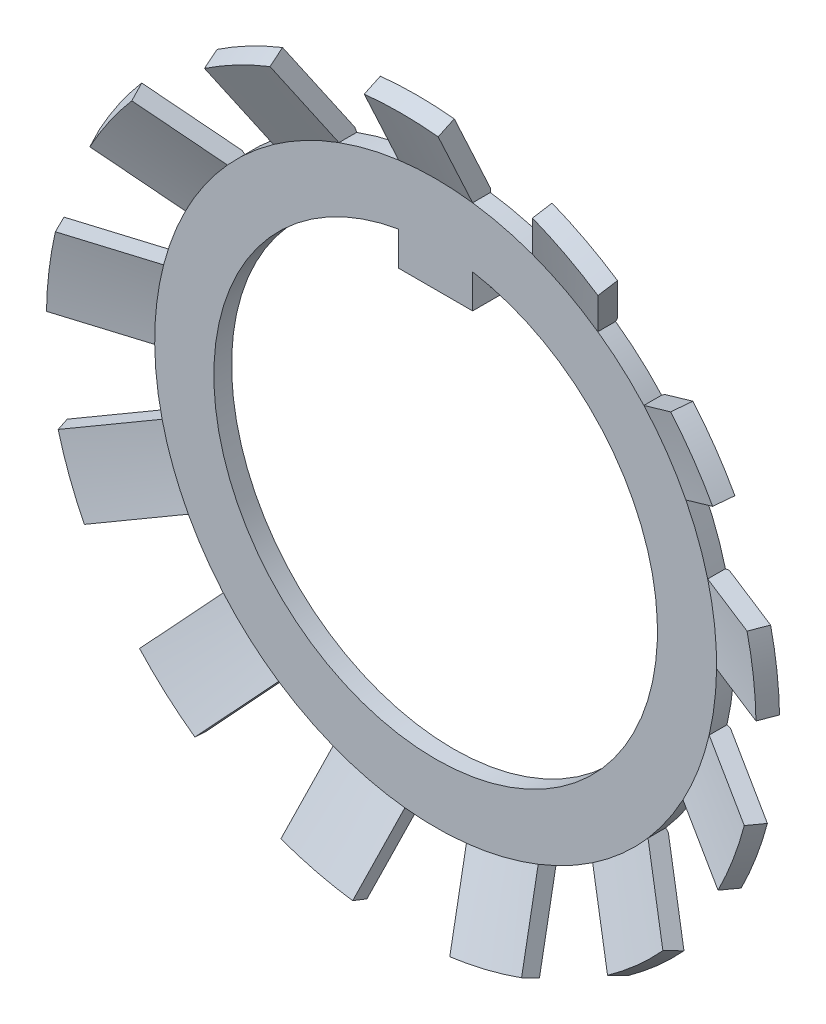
ISO-10303-21;
HEADER;
FILE_DESCRIPTION(('STEP AP214'),'2;1');
FILE_NAME('part.step','',(''),(''),'','','');
FILE_SCHEMA(('AUTOMOTIVE_DESIGN { 1 0 10303 214 1 1 1 1 }'));
ENDSEC;
DATA;
#1=APPLICATION_CONTEXT('core data for automotive mechanical design processes');
#2=APPLICATION_PROTOCOL_DEFINITION('international standard','automotive_design',2000,#1);
#3=PRODUCT_CONTEXT('',#1,'mechanical');
#4=PRODUCT('Part','Part','',(#3));
#5=PRODUCT_RELATED_PRODUCT_CATEGORY('part','',(#4));
#6=PRODUCT_DEFINITION_FORMATION('','',#4);
#7=PRODUCT_DEFINITION_CONTEXT('part definition',#1,'design');
#8=PRODUCT_DEFINITION('design','',#6,#7);
#9=PRODUCT_DEFINITION_SHAPE('','',#8);
#10=(LENGTH_UNIT() NAMED_UNIT(*) SI_UNIT(.MILLI.,.METRE.));
#11=(NAMED_UNIT(*) PLANE_ANGLE_UNIT() SI_UNIT($,.RADIAN.));
#12=(NAMED_UNIT(*) SI_UNIT($,.STERADIAN.) SOLID_ANGLE_UNIT());
#13=UNCERTAINTY_MEASURE_WITH_UNIT(LENGTH_MEASURE(1.E-05),#10,'distance_accuracy_value','');
#14=(GEOMETRIC_REPRESENTATION_CONTEXT(3) GLOBAL_UNCERTAINTY_ASSIGNED_CONTEXT((#13)) GLOBAL_UNIT_ASSIGNED_CONTEXT((#10,
#11,#12)) REPRESENTATION_CONTEXT('',''));
#15=CARTESIAN_POINT('',(0.,0.,0.));
#16=DIRECTION('',(0.,0.,1.));
#17=DIRECTION('',(1.,0.,0.));
#18=AXIS2_PLACEMENT_3D('',#15,#16,#17);
#19=CARTESIAN_POINT('',(0.,0.,2.4406386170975));
#20=DIRECTION('',(0.,0.,-1.));
#21=DIRECTION('',(-1.,0.,0.));
#22=AXIS2_PLACEMENT_3D('',#19,#20,#21);
#23=CONICAL_SURFACE('',#22,24.5,0.436332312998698);
#24=CARTESIAN_POINT('',(0.,0.,2.4406386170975));
#25=DIRECTION('',(0.,0.,1.));
#26=DIRECTION('',(1.,0.,0.));
#27=AXIS2_PLACEMENT_3D('',#24,#25,#26);
#28=CIRCLE('',#27,24.5);
#29=CARTESIAN_POINT('',(-23.893073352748,5.4195060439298,2.44063861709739));
#30=VERTEX_POINT('',#29);
#31=CARTESIAN_POINT('',(-24.495756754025,0.45596167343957,2.44063861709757));
#32=VERTEX_POINT('',#31);
#33=EDGE_CURVE('E1547',#30,#32,#28,.T.);
#34=ORIENTED_EDGE('',*,*,#33,.T.);
#35=CARTESIAN_POINT('',(-24.4958498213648,0.455972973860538,2.4404386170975));
#36=CARTESIAN_POINT('',(-24.4114695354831,0.445727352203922,2.62177051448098));
#37=CARTESIAN_POINT('',(-24.3270853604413,0.435481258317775,2.80310057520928));
#38=CARTESIAN_POINT('',(-24.1583092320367,0.414988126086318,3.16575702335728));
#39=CARTESIAN_POINT('',(-24.0739172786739,0.404741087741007,3.34708341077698));
#40=CARTESIAN_POINT('',(-23.989521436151,0.394493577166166,3.5284079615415));
#41=B_SPLINE_CURVE_WITH_KNOTS('',3,(#35,#36,#37,#38,#39,#40),.UNSPECIFIED.,.F.,.F.,(4,2,4),(0.,
0.60079643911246,1.20159287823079),.UNSPECIFIED.);
#42=CARTESIAN_POINT('',(-23.9896145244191,0.394504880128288,3.5282079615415));
#43=VERTEX_POINT('',#42);
#44=EDGE_CURVE('E987',#32,#43,#41,.T.);
#45=ORIENTED_EDGE('',*,*,#44,.T.);
#46=CARTESIAN_POINT('',(0.,0.,3.5282079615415));
#47=DIRECTION('',(0.,0.,1.));
#48=DIRECTION('',(1.,0.,0.));
#49=AXIS2_PLACEMENT_3D('',#46,#47,#48);
#50=CIRCLE('',#49,23.992858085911);
#51=CARTESIAN_POINT('',(-23.3869311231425,5.35804925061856,3.5282079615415));
#52=VERTEX_POINT('',#51);
#53=EDGE_CURVE('E1230',#52,#43,#50,.T.);
#54=ORIENTED_EDGE('',*,*,#53,.F.);
#55=CARTESIAN_POINT('',(-23.3868380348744,5.35803794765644,3.5284079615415));
#56=CARTESIAN_POINT('',(-23.4712338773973,5.36828545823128,3.34708341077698));
#57=CARTESIAN_POINT('',(-23.5556258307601,5.37853249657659,3.16575702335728));
#58=CARTESIAN_POINT('',(-23.7244019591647,5.39902562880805,2.80310057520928));
#59=CARTESIAN_POINT('',(-23.8087861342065,5.4092717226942,2.62177051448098));
#60=CARTESIAN_POINT('',(-23.8931664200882,5.41951734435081,2.4404386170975));
#61=B_SPLINE_CURVE_WITH_KNOTS('',3,(#55,#56,#57,#58,#59,#60),.UNSPECIFIED.,.F.,.F.,(4,2,4),(0.,
0.600796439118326,1.20159287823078),.UNSPECIFIED.);
#62=EDGE_CURVE('E558',#52,#30,#61,.T.);
#63=ORIENTED_EDGE('',*,*,#62,.T.);
#64=EDGE_LOOP('',(#34,#45,#54,#63));
#65=FACE_BOUND('',#64,.T.);
#66=ADVANCED_FACE('F39',(#65),#23,.T.);
#67=CARTESIAN_POINT('',(-23.1981087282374,-6.12413182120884,3.5282079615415));
#68=VERTEX_POINT('',#67);
#69=CARTESIAN_POINT('',(-21.4250842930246,-10.7992130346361,3.5282079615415));
#70=VERTEX_POINT('',#69);
#71=EDGE_CURVE('E1237',#68,#70,#50,.T.);
#72=ORIENTED_EDGE('',*,*,#71,.F.);
#73=CARTESIAN_POINT('',(-23.1980210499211,-6.12409856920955,3.5284079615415));
#74=CARTESIAN_POINT('',(-23.2775121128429,-6.15424555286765,3.34708341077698));
#75=CARTESIAN_POINT('',(-23.3569995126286,-6.18439114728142,3.16575702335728));
#76=CARTESIAN_POINT('',(-23.5159669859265,-6.24467955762,2.80310057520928));
#77=CARTESIAN_POINT('',(-23.5954470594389,-6.27482237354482,2.62177051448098));
#78=CARTESIAN_POINT('',(-23.674923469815,-6.3049638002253,2.4404386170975));
#79=B_SPLINE_CURVE_WITH_KNOTS('',3,(#73,#74,#75,#76,#77,#78),.UNSPECIFIED.,.F.,.F.,(4,2,4),(0.,
0.600796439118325,1.20159287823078),.UNSPECIFIED.);
#80=CARTESIAN_POINT('',(-23.674835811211,-6.3049305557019,2.44063861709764));
#81=VERTEX_POINT('',#80);
#82=EDGE_CURVE('E968',#68,#81,#79,.T.);
#83=ORIENTED_EDGE('',*,*,#82,.T.);
#84=CARTESIAN_POINT('',(-21.9018113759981,-10.9800117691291,2.44063861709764));
#85=VERTEX_POINT('',#84);
#86=EDGE_CURVE('E1543',#81,#85,#28,.T.);
#87=ORIENTED_EDGE('',*,*,#86,.T.);
#88=CARTESIAN_POINT('',(-21.9018990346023,-10.9800450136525,2.4404386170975));
#89=CARTESIAN_POINT('',(-21.8224226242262,-10.949903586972,2.62177051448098));
#90=CARTESIAN_POINT('',(-21.7429425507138,-10.9197607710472,2.80310057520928));
#91=CARTESIAN_POINT('',(-21.5839750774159,-10.8594723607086,3.16575702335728));
#92=CARTESIAN_POINT('',(-21.5044876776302,-10.8293267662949,3.34708341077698));
#93=CARTESIAN_POINT('',(-21.4249966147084,-10.7991797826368,3.5284079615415));
#94=B_SPLINE_CURVE_WITH_KNOTS('',3,(#88,#89,#90,#91,#92,#93),.UNSPECIFIED.,.F.,.F.,(4,2,4),(0.,
0.600796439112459,1.20159287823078),.UNSPECIFIED.);
#95=EDGE_CURVE('E1157',#85,#70,#94,.T.);
#96=ORIENTED_EDGE('',*,*,#95,.T.);
#97=EDGE_LOOP('',(#72,#83,#87,#96));
#98=FACE_BOUND('',#97,.T.);
#99=ADVANCED_FACE('F1184',(#98),#23,.T.);
#100=CARTESIAN_POINT('',(-17.6948791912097,-16.2033480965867,3.5282079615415));
#101=VERTEX_POINT('',#100);
#102=CARTESIAN_POINT('',(-13.9523254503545,-19.5189613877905,3.5282079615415));
#103=VERTEX_POINT('',#102);
#104=EDGE_CURVE('E1243',#101,#103,#50,.T.);
#105=ORIENTED_EDGE('',*,*,#104,.F.);
#106=CARTESIAN_POINT('',(-17.6948170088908,-16.2032779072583,3.5284079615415));
#107=CARTESIAN_POINT('',(-17.7511928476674,-16.2669130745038,3.34708341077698));
#108=CARTESIAN_POINT('',(-17.807566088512,-16.3305453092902,3.16575702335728));
#109=CARTESIAN_POINT('',(-17.9203073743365,-16.4578039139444,2.80310057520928));
#110=CARTESIAN_POINT('',(-17.9766754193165,-16.5214302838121,2.62177051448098));
#111=CARTESIAN_POINT('',(-18.0330408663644,-16.5850537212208,2.4404386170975));
#112=B_SPLINE_CURVE_WITH_KNOTS('',3,(#106,#107,#108,#109,#110,#111),.UNSPECIFIED.,.F.,.F.,(4,2,
4),(0.,0.600796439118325,1.20159287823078),.UNSPECIFIED.);
#113=CARTESIAN_POINT('',(-18.032978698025,-16.584983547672,2.44063861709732));
#114=VERTEX_POINT('',#113);
#115=EDGE_CURVE('E1158',#101,#114,#112,.T.);
#116=ORIENTED_EDGE('',*,*,#115,.T.);
#117=CARTESIAN_POINT('',(-14.2904249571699,-19.9005968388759,2.44063861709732));
#118=VERTEX_POINT('',#117);
#119=EDGE_CURVE('E1536',#114,#118,#28,.T.);
#120=ORIENTED_EDGE('',*,*,#119,.T.);
#121=CARTESIAN_POINT('',(-14.2904871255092,-19.9006670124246,2.4404386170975));
#122=CARTESIAN_POINT('',(-14.2341216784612,-19.8370435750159,2.62177051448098));
#123=CARTESIAN_POINT('',(-14.1777536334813,-19.7734172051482,2.80310057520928));
#124=CARTESIAN_POINT('',(-14.0650123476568,-19.6461586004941,3.16575702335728));
#125=CARTESIAN_POINT('',(-14.0086391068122,-19.5825263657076,3.34708341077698));
#126=CARTESIAN_POINT('',(-13.9522632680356,-19.5188911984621,3.5284079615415));
#127=B_SPLINE_CURVE_WITH_KNOTS('',3,(#121,#122,#123,#124,#125,#126),.UNSPECIFIED.,.F.,.F.,(4,2,
4),(0.,0.600796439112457,1.20159287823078),.UNSPECIFIED.);
#128=EDGE_CURVE('E1524',#118,#103,#127,.T.);
#129=ORIENTED_EDGE('',*,*,#128,.T.);
#130=EDGE_LOOP('',(#105,#116,#120,#129));
#131=FACE_BOUND('',#130,.T.);
#132=ADVANCED_FACE('F1189',(#131),#23,.T.);
#133=CARTESIAN_POINT('',(-8.13796607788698,-22.5705725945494,3.5282079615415));
#134=VERTEX_POINT('',#133);
#135=CARTESIAN_POINT('',(-3.28325699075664,-23.7671509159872,3.5282079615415));
#136=VERTEX_POINT('',#135);
#137=EDGE_CURVE('E1248',#134,#136,#50,.T.);
#138=ORIENTED_EDGE('',*,*,#137,.F.);
#139=CARTESIAN_POINT('',(-8.13794363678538,-22.5704815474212,3.5284079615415));
#140=CARTESIAN_POINT('',(-8.1582892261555,-22.6530268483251,3.34708341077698));
#141=CARTESIAN_POINT('',(-8.17863387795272,-22.7355683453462,3.16575702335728));
#142=CARTESIAN_POINT('',(-8.21932130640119,-22.9006437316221,2.80310057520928));
#143=CARTESIAN_POINT('',(-8.23966408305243,-22.9831776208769,2.62177051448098));
#144=CARTESIAN_POINT('',(-8.26000592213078,-23.065707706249,2.4404386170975));
#145=B_SPLINE_CURVE_WITH_KNOTS('',3,(#139,#140,#141,#142,#143,#144),.UNSPECIFIED.,.F.,.F.,(4,2,
4),(0.,0.600796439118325,1.20159287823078),.UNSPECIFIED.);
#146=CARTESIAN_POINT('',(-8.2599834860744,-23.06561667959,2.44063861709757));
#147=VERTEX_POINT('',#146);
#148=EDGE_CURVE('E1504',#134,#147,#145,.T.);
#149=ORIENTED_EDGE('',*,*,#148,.T.);
#150=CARTESIAN_POINT('',(-3.40527439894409,-24.2621950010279,2.44063861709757));
#151=VERTEX_POINT('',#150);
#152=EDGE_CURVE('E1544',#147,#151,#28,.T.);
#153=ORIENTED_EDGE('',*,*,#152,.T.);
#154=CARTESIAN_POINT('',(-3.40529683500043,-24.2622860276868,2.4404386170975));
#155=CARTESIAN_POINT('',(-3.38495499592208,-24.1797559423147,2.62177051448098));
#156=CARTESIAN_POINT('',(-3.36461221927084,-24.0972220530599,2.80310057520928));
#157=CARTESIAN_POINT('',(-3.32392479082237,-23.932146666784,3.16575702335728));
#158=CARTESIAN_POINT('',(-3.30358013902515,-23.8496051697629,3.34708341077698));
#159=CARTESIAN_POINT('',(-3.28323454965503,-23.767059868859,3.5284079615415));
#160=B_SPLINE_CURVE_WITH_KNOTS('',3,(#154,#155,#156,#157,#158,#159),.UNSPECIFIED.,.F.,.F.,(4,2,
4),(0.,0.600796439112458,1.20159287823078),.UNSPECIFIED.);
#161=EDGE_CURVE('E1499',#151,#136,#160,.T.);
#162=ORIENTED_EDGE('',*,*,#161,.T.);
#163=EDGE_LOOP('',(#138,#149,#153,#162));
#164=FACE_BOUND('',#163,.T.);
#165=ADVANCED_FACE('F1816',(#164),#23,.T.);
#166=CARTESIAN_POINT('',(3.28325699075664,-23.7671509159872,3.5282079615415));
#167=VERTEX_POINT('',#166);
#168=CARTESIAN_POINT('',(8.13796607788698,-22.5705725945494,3.5282079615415));
#169=VERTEX_POINT('',#168);
#170=EDGE_CURVE('E1253',#167,#169,#50,.T.);
#171=ORIENTED_EDGE('',*,*,#170,.F.);
#172=CARTESIAN_POINT('',(3.28323454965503,-23.767059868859,3.5284079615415));
#173=CARTESIAN_POINT('',(3.30358013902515,-23.8496051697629,3.34708341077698));
#174=CARTESIAN_POINT('',(3.32392479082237,-23.932146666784,3.16575702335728));
#175=CARTESIAN_POINT('',(3.36461221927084,-24.0972220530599,2.80310057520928));
#176=CARTESIAN_POINT('',(3.38495499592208,-24.1797559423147,2.62177051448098));
#177=CARTESIAN_POINT('',(3.40529683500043,-24.2622860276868,2.4404386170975));
#178=B_SPLINE_CURVE_WITH_KNOTS('',3,(#172,#173,#174,#175,#176,#177),.UNSPECIFIED.,.F.,.F.,(4,2,
4),(0.,0.600796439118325,1.20159287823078),.UNSPECIFIED.);
#179=CARTESIAN_POINT('',(3.4052743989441,-24.262195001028,2.44063861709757));
#180=VERTEX_POINT('',#179);
#181=EDGE_CURVE('E1476',#167,#180,#178,.T.);
#182=ORIENTED_EDGE('',*,*,#181,.T.);
#183=CARTESIAN_POINT('',(8.25998348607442,-23.0656166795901,2.44063861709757));
#184=VERTEX_POINT('',#183);
#185=EDGE_CURVE('E1548',#180,#184,#28,.T.);
#186=ORIENTED_EDGE('',*,*,#185,.T.);
#187=CARTESIAN_POINT('',(8.26000592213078,-23.065707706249,2.4404386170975));
#188=CARTESIAN_POINT('',(8.23966408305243,-22.9831776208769,2.62177051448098));
#189=CARTESIAN_POINT('',(8.21932130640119,-22.9006437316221,2.80310057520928));
#190=CARTESIAN_POINT('',(8.17863387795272,-22.7355683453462,3.16575702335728));
#191=CARTESIAN_POINT('',(8.1582892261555,-22.6530268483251,3.34708341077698));
#192=CARTESIAN_POINT('',(8.13794363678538,-22.5704815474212,3.5284079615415));
#193=B_SPLINE_CURVE_WITH_KNOTS('',3,(#187,#188,#189,#190,#191,#192),.UNSPECIFIED.,.F.,.F.,(4,2,
4),(0.,0.600796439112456,1.20159287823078),.UNSPECIFIED.);
#194=EDGE_CURVE('E1471',#184,#169,#193,.T.);
#195=ORIENTED_EDGE('',*,*,#194,.T.);
#196=EDGE_LOOP('',(#171,#182,#186,#195));
#197=FACE_BOUND('',#196,.T.);
#198=ADVANCED_FACE('F1698',(#197),#23,.T.);
#199=CARTESIAN_POINT('',(13.9523254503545,-19.5189613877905,3.5282079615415));
#200=VERTEX_POINT('',#199);
#201=CARTESIAN_POINT('',(17.6948791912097,-16.2033480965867,3.5282079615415));
#202=VERTEX_POINT('',#201);
#203=EDGE_CURVE('E1259',#200,#202,#50,.T.);
#204=ORIENTED_EDGE('',*,*,#203,.F.);
#205=CARTESIAN_POINT('',(13.9522632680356,-19.5188911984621,3.5284079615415));
#206=CARTESIAN_POINT('',(14.0086391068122,-19.5825263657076,3.34708341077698));
#207=CARTESIAN_POINT('',(14.0650123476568,-19.6461586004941,3.16575702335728));
#208=CARTESIAN_POINT('',(14.1777536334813,-19.7734172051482,2.80310057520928));
#209=CARTESIAN_POINT('',(14.2341216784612,-19.8370435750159,2.62177051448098));
#210=CARTESIAN_POINT('',(14.2904871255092,-19.9006670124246,2.4404386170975));
#211=B_SPLINE_CURVE_WITH_KNOTS('',3,(#205,#206,#207,#208,#209,#210),.UNSPECIFIED.,.F.,.F.,(4,2,
4),(0.,0.600796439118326,1.20159287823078),.UNSPECIFIED.);
#212=CARTESIAN_POINT('',(14.29042495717,-19.900596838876,2.44063861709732));
#213=VERTEX_POINT('',#212);
#214=EDGE_CURVE('E1448',#200,#213,#211,.T.);
#215=ORIENTED_EDGE('',*,*,#214,.T.);
#216=CARTESIAN_POINT('',(18.0329786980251,-16.5849835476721,2.44063861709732));
#217=VERTEX_POINT('',#216);
#218=EDGE_CURVE('E1697',#213,#217,#28,.T.);
#219=ORIENTED_EDGE('',*,*,#218,.T.);
#220=CARTESIAN_POINT('',(18.0330408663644,-16.5850537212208,2.4404386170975));
#221=CARTESIAN_POINT('',(17.9766754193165,-16.5214302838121,2.62177051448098));
#222=CARTESIAN_POINT('',(17.9203073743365,-16.4578039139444,2.80310057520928));
#223=CARTESIAN_POINT('',(17.807566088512,-16.3305453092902,3.16575702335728));
#224=CARTESIAN_POINT('',(17.7511928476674,-16.2669130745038,3.34708341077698));
#225=CARTESIAN_POINT('',(17.6948170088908,-16.2032779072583,3.5284079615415));
#226=B_SPLINE_CURVE_WITH_KNOTS('',3,(#220,#221,#222,#223,#224,#225),.UNSPECIFIED.,.F.,.F.,(4,2,
4),(0.,0.60079643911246,1.20159287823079),.UNSPECIFIED.);
#227=EDGE_CURVE('E1443',#217,#202,#226,.T.);
#228=ORIENTED_EDGE('',*,*,#227,.T.);
#229=EDGE_LOOP('',(#204,#215,#219,#228));
#230=FACE_BOUND('',#229,.T.);
#231=ADVANCED_FACE('F1822',(#230),#23,.T.);
#232=CARTESIAN_POINT('',(21.4250842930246,-10.7992130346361,3.5282079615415));
#233=VERTEX_POINT('',#232);
#234=CARTESIAN_POINT('',(23.1981087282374,-6.12413182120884,3.5282079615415));
#235=VERTEX_POINT('',#234);
#236=EDGE_CURVE('E1265',#233,#235,#50,.T.);
#237=ORIENTED_EDGE('',*,*,#236,.F.);
#238=CARTESIAN_POINT('',(21.4249966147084,-10.7991797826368,3.5284079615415));
#239=CARTESIAN_POINT('',(21.5044876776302,-10.8293267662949,3.34708341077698));
#240=CARTESIAN_POINT('',(21.5839750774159,-10.8594723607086,3.16575702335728));
#241=CARTESIAN_POINT('',(21.7429425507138,-10.9197607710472,2.80310057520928));
#242=CARTESIAN_POINT('',(21.8224226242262,-10.949903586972,2.62177051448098));
#243=CARTESIAN_POINT('',(21.9018990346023,-10.9800450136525,2.4404386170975));
#244=B_SPLINE_CURVE_WITH_KNOTS('',3,(#238,#239,#240,#241,#242,#243),.UNSPECIFIED.,.F.,.F.,(4,2,
4),(0.,0.600796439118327,1.20159287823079),.UNSPECIFIED.);
#245=CARTESIAN_POINT('',(21.901811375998,-10.980011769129,2.44063861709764));
#246=VERTEX_POINT('',#245);
#247=EDGE_CURVE('E1421',#233,#246,#244,.T.);
#248=ORIENTED_EDGE('',*,*,#247,.T.);
#249=CARTESIAN_POINT('',(23.6748358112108,-6.30493055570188,2.44063861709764));
#250=VERTEX_POINT('',#249);
#251=EDGE_CURVE('E1554',#246,#250,#28,.T.);
#252=ORIENTED_EDGE('',*,*,#251,.T.);
#253=CARTESIAN_POINT('',(23.674923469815,-6.3049638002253,2.4404386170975));
#254=CARTESIAN_POINT('',(23.5954470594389,-6.27482237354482,2.62177051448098));
#255=CARTESIAN_POINT('',(23.5159669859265,-6.24467955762,2.80310057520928));
#256=CARTESIAN_POINT('',(23.3569995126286,-6.18439114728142,3.16575702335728));
#257=CARTESIAN_POINT('',(23.2775121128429,-6.15424555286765,3.34708341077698));
#258=CARTESIAN_POINT('',(23.1980210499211,-6.12409856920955,3.5284079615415));
#259=B_SPLINE_CURVE_WITH_KNOTS('',3,(#253,#254,#255,#256,#257,#258),.UNSPECIFIED.,.F.,.F.,(4,2,
4),(0.,0.600796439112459,1.20159287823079),.UNSPECIFIED.);
#260=EDGE_CURVE('E1415',#250,#235,#259,.T.);
#261=ORIENTED_EDGE('',*,*,#260,.T.);
#262=EDGE_LOOP('',(#237,#248,#252,#261));
#263=FACE_BOUND('',#262,.T.);
#264=ADVANCED_FACE('F2099',(#263),#23,.T.);
#265=CARTESIAN_POINT('',(23.9896145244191,0.394504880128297,3.5282079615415));
#266=VERTEX_POINT('',#265);
#267=CARTESIAN_POINT('',(23.3869311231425,5.35804925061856,3.5282079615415));
#268=VERTEX_POINT('',#267);
#269=EDGE_CURVE('E776',#266,#268,#50,.T.);
#270=ORIENTED_EDGE('',*,*,#269,.F.);
#271=CARTESIAN_POINT('',(23.989521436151,0.394493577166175,3.5284079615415));
#272=CARTESIAN_POINT('',(24.0739172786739,0.404741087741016,3.34708341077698));
#273=CARTESIAN_POINT('',(24.1583092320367,0.414988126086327,3.16575702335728));
#274=CARTESIAN_POINT('',(24.3270853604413,0.435481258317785,2.80310057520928));
#275=CARTESIAN_POINT('',(24.4114695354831,0.445727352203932,2.62177051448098));
#276=CARTESIAN_POINT('',(24.4958498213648,0.455972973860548,2.4404386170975));
#277=B_SPLINE_CURVE_WITH_KNOTS('',3,(#271,#272,#273,#274,#275,#276),.UNSPECIFIED.,.F.,.F.,(4,2,
4),(0.,0.600796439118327,1.20159287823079),.UNSPECIFIED.);
#278=CARTESIAN_POINT('',(24.495756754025,0.45596167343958,2.44063861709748));
#279=VERTEX_POINT('',#278);
#280=EDGE_CURVE('E1391',#266,#279,#277,.T.);
#281=ORIENTED_EDGE('',*,*,#280,.T.);
#282=CARTESIAN_POINT('',(23.8930733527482,5.41950604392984,2.44063861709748));
#283=VERTEX_POINT('',#282);
#284=EDGE_CURVE('E1549',#279,#283,#28,.T.);
#285=ORIENTED_EDGE('',*,*,#284,.T.);
#286=CARTESIAN_POINT('',(23.8931664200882,5.41951734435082,2.4404386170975));
#287=CARTESIAN_POINT('',(23.8087861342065,5.4092717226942,2.62177051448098));
#288=CARTESIAN_POINT('',(23.7244019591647,5.39902562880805,2.80310057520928));
#289=CARTESIAN_POINT('',(23.5556258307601,5.37853249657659,3.16575702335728));
#290=CARTESIAN_POINT('',(23.4712338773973,5.36828545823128,3.34708341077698));
#291=CARTESIAN_POINT('',(23.3868380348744,5.35803794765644,3.5284079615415));
#292=B_SPLINE_CURVE_WITH_KNOTS('',3,(#286,#287,#288,#289,#290,#291),.UNSPECIFIED.,.F.,.F.,(4,2,
4),(0.,0.600796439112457,1.20159287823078),.UNSPECIFIED.);
#293=EDGE_CURVE('E1384',#283,#268,#292,.T.);
#294=ORIENTED_EDGE('',*,*,#293,.T.);
#295=EDGE_LOOP('',(#270,#281,#285,#294));
#296=FACE_BOUND('',#295,.T.);
#297=ADVANCED_FACE('F2092',(#296),#23,.T.);
#298=CARTESIAN_POINT('',(21.0584131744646,11.4978464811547,3.5282079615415));
#299=VERTEX_POINT('',#298);
#300=CARTESIAN_POINT('',(18.2180894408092,15.6127658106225,3.5282079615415));
#301=VERTEX_POINT('',#300);
#302=EDGE_CURVE('E1285',#299,#301,#50,.T.);
#303=ORIENTED_EDGE('',*,*,#302,.F.);
#304=CARTESIAN_POINT('',(21.0583360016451,11.4977932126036,3.5284079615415));
#305=CARTESIAN_POINT('',(21.1283025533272,11.5460876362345,3.34708341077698));
#306=CARTESIAN_POINT('',(21.198265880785,11.5943798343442,3.16575702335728));
#307=CARTESIAN_POINT('',(21.3381860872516,11.6909597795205,2.80310057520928));
#308=CARTESIAN_POINT('',(21.4081429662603,11.7392475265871,2.62177051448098));
#309=CARTESIAN_POINT('',(21.4780966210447,11.7875330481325,2.4404386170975));
#310=B_SPLINE_CURVE_WITH_KNOTS('',3,(#304,#305,#306,#307,#308,#309),.UNSPECIFIED.,.F.,.F.,(4,2,
4),(0.,0.600796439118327,1.20159287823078),.UNSPECIFIED.);
#311=CARTESIAN_POINT('',(21.478019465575,11.787479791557,2.44063861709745));
#312=VERTEX_POINT('',#311);
#313=EDGE_CURVE('E1359',#299,#312,#310,.T.);
#314=ORIENTED_EDGE('',*,*,#313,.T.);
#315=CARTESIAN_POINT('',(18.6376957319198,15.9023991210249,2.44063861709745));
#316=VERTEX_POINT('',#315);
#317=EDGE_CURVE('E1553',#312,#316,#28,.T.);
#318=ORIENTED_EDGE('',*,*,#317,.T.);
#319=CARTESIAN_POINT('',(18.6377728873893,15.9024523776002,2.4404386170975));
#320=CARTESIAN_POINT('',(18.5678192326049,15.8541668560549,2.62177051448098));
#321=CARTESIAN_POINT('',(18.4978623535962,15.8058791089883,2.80310057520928));
#322=CARTESIAN_POINT('',(18.3579421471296,15.709299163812,3.16575702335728));
#323=CARTESIAN_POINT('',(18.2879788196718,15.6610069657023,3.34708341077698));
#324=CARTESIAN_POINT('',(18.2180122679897,15.6127125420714,3.5284079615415));
#325=B_SPLINE_CURVE_WITH_KNOTS('',3,(#319,#320,#321,#322,#323,#324),.UNSPECIFIED.,.F.,.F.,(4,2,
4),(0.,0.600796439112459,1.20159287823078),.UNSPECIFIED.);
#326=EDGE_CURVE('E1351',#316,#301,#325,.T.);
#327=ORIENTED_EDGE('',*,*,#326,.T.);
#328=EDGE_LOOP('',(#303,#314,#318,#327));
#329=FACE_BOUND('',#328,.T.);
#330=ADVANCED_FACE('F2085',(#329),#23,.T.);
#331=CARTESIAN_POINT('',(13.3029831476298,19.9671700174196,3.5282079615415));
#332=VERTEX_POINT('',#331);
#333=CARTESIAN_POINT('',(8.87570301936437,22.2907858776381,3.5282079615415));
#334=VERTEX_POINT('',#333);
#335=EDGE_CURVE('E1227',#332,#334,#50,.T.);
#336=ORIENTED_EDGE('',*,*,#335,.F.);
#337=CARTESIAN_POINT('',(13.3029395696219,19.9670869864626,3.5284079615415));
#338=CARTESIAN_POINT('',(13.3424483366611,20.0423646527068,3.34708341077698));
#339=CARTESIAN_POINT('',(13.3819552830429,20.117638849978,3.16575702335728));
#340=CARTESIAN_POINT('',(13.4609655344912,20.2681803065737,2.80310057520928));
#341=CARTESIAN_POINT('',(13.5004688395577,20.3434475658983,2.62177051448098));
#342=CARTESIAN_POINT('',(13.5399703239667,20.4187113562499,2.4404386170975));
#343=B_SPLINE_CURVE_WITH_KNOTS('',3,(#337,#338,#339,#340,#341,#342),.UNSPECIFIED.,.F.,.F.,(4,2,
4),(0.,0.600796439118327,1.20159287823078),.UNSPECIFIED.);
#344=CARTESIAN_POINT('',(13.539926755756,20.41862834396,2.44063861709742));
#345=VERTEX_POINT('',#344);
#346=EDGE_CURVE('E1314',#332,#345,#343,.T.);
#347=ORIENTED_EDGE('',*,*,#346,.T.);
#348=CARTESIAN_POINT('',(9.11264662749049,22.7422442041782,2.44063861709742));
#349=VERTEX_POINT('',#348);
#350=EDGE_CURVE('E1317',#345,#349,#28,.T.);
#351=ORIENTED_EDGE('',*,*,#350,.T.);
#352=CARTESIAN_POINT('',(9.11269019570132,22.7423272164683,2.4404386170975));
#353=CARTESIAN_POINT('',(9.07318871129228,22.6670634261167,2.62177051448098));
#354=CARTESIAN_POINT('',(9.03368540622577,22.5917961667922,2.80310057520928));
#355=CARTESIAN_POINT('',(8.95467515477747,22.4412547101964,3.16575702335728));
#356=CARTESIAN_POINT('',(8.91516820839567,22.3659805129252,3.34708341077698));
#357=CARTESIAN_POINT('',(8.87565944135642,22.2907028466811,3.5284079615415));
#358=B_SPLINE_CURVE_WITH_KNOTS('',3,(#352,#353,#354,#355,#356,#357),.UNSPECIFIED.,.F.,.F.,(4,2,
4),(0.,0.600796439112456,1.20159287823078),.UNSPECIFIED.);
#359=EDGE_CURVE('E1316',#349,#334,#358,.T.);
#360=ORIENTED_EDGE('',*,*,#359,.T.);
#361=EDGE_LOOP('',(#336,#347,#351,#360));
#362=FACE_BOUND('',#361,.T.);
#363=ADVANCED_FACE('F1210',(#362),#23,.T.);
#364=CARTESIAN_POINT('',(2.5,23.8622555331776,3.5282079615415));
#365=VERTEX_POINT('',#364);
#366=CARTESIAN_POINT('',(-2.5,23.8622555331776,3.5282079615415));
#367=VERTEX_POINT('',#366);
#368=EDGE_CURVE('E1224',#365,#367,#50,.T.);
#369=ORIENTED_EDGE('',*,*,#368,.F.);
#370=CARTESIAN_POINT('',(2.5,19.5821066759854,12.6462481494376));
#371=CARTESIAN_POINT('',(2.5,20.3257116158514,11.0643741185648));
#372=CARTESIAN_POINT('',(2.5,21.0687978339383,9.48225640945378));
#373=CARTESIAN_POINT('',(2.5,22.5541555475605,6.31763887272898));
#374=CARTESIAN_POINT('',(2.5,23.296427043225,4.73513904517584));
#375=CARTESIAN_POINT('',(2.5,24.7803782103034,1.56986213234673));
#376=CARTESIAN_POINT('',(2.5,25.522057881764,-0.0129149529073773));
#377=CARTESIAN_POINT('',(2.5,27.004951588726,-3.17868754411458));
#378=CARTESIAN_POINT('',(2.5,27.7461656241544,-4.76168305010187));
#379=CARTESIAN_POINT('',(2.5,28.487209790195,-6.34475803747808));
#380=B_SPLINE_CURVE_WITH_KNOTS('',3,(#370,#371,#372,#373,#374,#375,#376,#377,#378,#379),
.UNSPECIFIED.,.F.,.F.,(4,2,2,2,4),(0.,5.24380211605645,10.4876034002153,15.7314042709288,
20.9752059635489),.UNSPECIFIED.);
#381=CARTESIAN_POINT('',(2.5,24.372115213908,2.44063861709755));
#382=VERTEX_POINT('',#381);
#383=EDGE_CURVE('E1324',#365,#382,#380,.T.);
#384=ORIENTED_EDGE('',*,*,#383,.T.);
#385=CARTESIAN_POINT('',(-2.5,24.372115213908,2.44063861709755));
#386=VERTEX_POINT('',#385);
#387=EDGE_CURVE('E1763',#382,#386,#28,.T.);
#388=ORIENTED_EDGE('',*,*,#387,.T.);
#389=CARTESIAN_POINT('',(-2.5,28.4872097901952,-6.34475803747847));
#390=CARTESIAN_POINT('',(-2.5,27.7461656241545,-4.7616830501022));
#391=CARTESIAN_POINT('',(-2.5,27.0049515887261,-3.17868754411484));
#392=CARTESIAN_POINT('',(-2.5,25.522057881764,-0.0129149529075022));
#393=CARTESIAN_POINT('',(-2.5,24.7803782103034,1.56986213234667));
#394=CARTESIAN_POINT('',(-2.5,23.2964270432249,4.73513904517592));
#395=CARTESIAN_POINT('',(-2.5,22.5541555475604,6.31763887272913));
#396=CARTESIAN_POINT('',(-2.5,21.0687978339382,9.48225640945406));
#397=CARTESIAN_POINT('',(-2.5,20.3257116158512,11.0643741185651));
#398=CARTESIAN_POINT('',(-2.5,19.5821066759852,12.646248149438));
#399=B_SPLINE_CURVE_WITH_KNOTS('',3,(#389,#390,#391,#392,#393,#394,#395,#396,#397,#398),
.UNSPECIFIED.,.F.,.F.,(4,2,2,2,4),(0.,5.24380169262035,10.4876025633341,15.7314038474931,
20.9752059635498),.UNSPECIFIED.);
#400=EDGE_CURVE('E2161',#386,#367,#399,.T.);
#401=ORIENTED_EDGE('',*,*,#400,.T.);
#402=EDGE_LOOP('',(#369,#384,#388,#401));
#403=FACE_BOUND('',#402,.T.);
#404=ADVANCED_FACE('F1202',(#403),#23,.T.);
#405=CARTESIAN_POINT('',(-8.87570301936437,22.2907858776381,3.5282079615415));
#406=VERTEX_POINT('',#405);
#407=CARTESIAN_POINT('',(-13.3029831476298,19.9671700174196,3.5282079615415));
#408=VERTEX_POINT('',#407);
#409=EDGE_CURVE('E1216',#406,#408,#50,.T.);
#410=ORIENTED_EDGE('',*,*,#409,.F.);
#411=CARTESIAN_POINT('',(-8.87565944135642,22.2907028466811,3.5284079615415));
#412=CARTESIAN_POINT('',(-8.91516820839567,22.3659805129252,3.34708341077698));
#413=CARTESIAN_POINT('',(-8.95467515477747,22.4412547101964,3.16575702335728));
#414=CARTESIAN_POINT('',(-9.03368540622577,22.5917961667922,2.80310057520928));
#415=CARTESIAN_POINT('',(-9.07318871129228,22.6670634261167,2.62177051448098));
#416=CARTESIAN_POINT('',(-9.11269019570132,22.7423272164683,2.4404386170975));
#417=B_SPLINE_CURVE_WITH_KNOTS('',3,(#411,#412,#413,#414,#415,#416),.UNSPECIFIED.,.F.,.F.,(4,2,
4),(0.,0.600796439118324,1.20159287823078),.UNSPECIFIED.);
#418=CARTESIAN_POINT('',(-9.1126466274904,22.742244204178,2.44063861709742));
#419=VERTEX_POINT('',#418);
#420=EDGE_CURVE('E1218',#406,#419,#417,.T.);
#421=ORIENTED_EDGE('',*,*,#420,.T.);
#422=CARTESIAN_POINT('',(-13.5399267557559,20.4186283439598,2.44063861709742));
#423=VERTEX_POINT('',#422);
#424=EDGE_CURVE('E1762',#419,#423,#28,.T.);
#425=ORIENTED_EDGE('',*,*,#424,.T.);
#426=CARTESIAN_POINT('',(-13.5399703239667,20.4187113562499,2.4404386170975));
#427=CARTESIAN_POINT('',(-13.5004688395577,20.3434475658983,2.62177051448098));
#428=CARTESIAN_POINT('',(-13.4609655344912,20.2681803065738,2.80310057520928));
#429=CARTESIAN_POINT('',(-13.3819552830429,20.117638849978,3.16575702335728));
#430=CARTESIAN_POINT('',(-13.3424483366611,20.0423646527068,3.34708341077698));
#431=CARTESIAN_POINT('',(-13.3029395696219,19.9670869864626,3.5284079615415));
#432=B_SPLINE_CURVE_WITH_KNOTS('',3,(#426,#427,#428,#429,#430,#431),.UNSPECIFIED.,.F.,.F.,(4,2,
4),(0.,0.600796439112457,1.20159287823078),.UNSPECIFIED.);
#433=EDGE_CURVE('E1220',#423,#408,#432,.T.);
#434=ORIENTED_EDGE('',*,*,#433,.T.);
#435=EDGE_LOOP('',(#410,#421,#425,#434));
#436=FACE_BOUND('',#435,.T.);
#437=ADVANCED_FACE('F1194',(#436),#23,.T.);
#438=CARTESIAN_POINT('',(0.,0.,3.5282079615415));
#439=DIRECTION('',(0.,0.,1.));
#440=DIRECTION('',(1.,0.,0.));
#441=AXIS2_PLACEMENT_3D('',#438,#439,#440);
#442=CONICAL_SURFACE('',#441,23.992858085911,1.1344640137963);
#443=ORIENTED_EDGE('',*,*,#53,.T.);
#444=CARTESIAN_POINT('',(-23.9900426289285,0.394556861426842,3.5284079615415));
#445=CARTESIAN_POINT('',(-23.5741969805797,0.34406405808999,3.33413571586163));
#446=CARTESIAN_POINT('',(-23.1583308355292,0.293568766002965,3.13990797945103));
#447=CARTESIAN_POINT('',(-22.3265490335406,0.192572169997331,2.75156022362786));
#448=CARTESIAN_POINT('',(-21.9106333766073,0.142070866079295,2.55744020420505));
#449=CARTESIAN_POINT('',(-21.0787439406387,0.0410612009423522,2.16932653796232));
#450=CARTESIAN_POINT('',(-20.6627701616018,-0.00944716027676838,1.97533289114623));
#451=CARTESIAN_POINT('',(-19.8307523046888,-0.110472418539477,1.58749853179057));
#452=CARTESIAN_POINT('',(-19.414708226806,-0.160989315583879,1.3936578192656));
#453=CARTESIAN_POINT('',(-18.998622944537,-0.211511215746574,1.19990687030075));
#454=B_SPLINE_CURVE_WITH_KNOTS('',3,(#444,#445,#446,#447,#448,#449,#450,#451,#452,#453),
.UNSPECIFIED.,.F.,.F.,(4,2,2,2,4),(0.,1.38526874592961,2.77053736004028,4.15580601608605,
5.54107480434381),.UNSPECIFIED.);
#455=CARTESIAN_POINT('',(-18.998822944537,-0.21148693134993,1.2));
#456=VERTEX_POINT('',#455);
#457=EDGE_CURVE('E2228',#43,#456,#454,.T.);
#458=ORIENTED_EDGE('',*,*,#457,.T.);
#459=CARTESIAN_POINT('',(0.,0.,1.2));
#460=DIRECTION('',(0.,0.,1.));
#461=DIRECTION('',(1.,0.,0.));
#462=AXIS2_PLACEMENT_3D('',#459,#460,#461);
#463=CIRCLE('',#462,19.);
#464=CARTESIAN_POINT('',(-18.3961395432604,4.75205743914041,1.2));
#465=VERTEX_POINT('',#464);
#466=EDGE_CURVE('E1595',#465,#456,#463,.T.);
#467=ORIENTED_EDGE('',*,*,#466,.F.);
#468=CARTESIAN_POINT('',(-18.3959395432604,4.75203315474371,1.19990687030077));
#469=CARTESIAN_POINT('',(-18.8120248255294,4.8025550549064,1.39365781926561));
#470=CARTESIAN_POINT('',(-19.2280689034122,4.8530719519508,1.58749853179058));
#471=CARTESIAN_POINT('',(-20.0600867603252,4.95409721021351,1.97533289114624));
#472=CARTESIAN_POINT('',(-20.4760605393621,5.00460557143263,2.16932653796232));
#473=CARTESIAN_POINT('',(-21.3079499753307,5.10561523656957,2.55744020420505));
#474=CARTESIAN_POINT('',(-21.723865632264,5.15611654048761,2.75156022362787));
#475=CARTESIAN_POINT('',(-22.5556474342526,5.25711313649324,3.13990797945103));
#476=CARTESIAN_POINT('',(-22.9715135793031,5.30760842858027,3.33413571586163));
#477=CARTESIAN_POINT('',(-23.3873592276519,5.35810123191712,3.5284079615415));
#478=B_SPLINE_CURVE_WITH_KNOTS('',3,(#468,#469,#470,#471,#472,#473,#474,#475,#476,#477),
.UNSPECIFIED.,.F.,.F.,(4,2,2,2,4),(0.,1.38526878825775,2.77053744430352,4.15580605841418,
5.54107480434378),.UNSPECIFIED.);
#479=EDGE_CURVE('E750',#465,#52,#478,.T.);
#480=ORIENTED_EDGE('',*,*,#479,.T.);
#481=EDGE_LOOP('',(#443,#458,#467,#480));
#482=FACE_BOUND('',#481,.T.);
#483=ADVANCED_FACE('F998',(#482),#442,.F.);
#484=CARTESIAN_POINT('',(-18.4973638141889,-4.34137442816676,1.2));
#485=VERTEX_POINT('',#484);
#486=CARTESIAN_POINT('',(-16.724339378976,-9.0164556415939,1.2));
#487=VERTEX_POINT('',#486);
#488=EDGE_CURVE('E1591',#485,#487,#463,.T.);
#489=ORIENTED_EDGE('',*,*,#488,.F.);
#490=CARTESIAN_POINT('',(-18.4971638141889,-4.34129857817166,1.19990112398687));
#491=CARTESIAN_POINT('',(-18.8890687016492,-4.48992849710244,1.39365255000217));
#492=CARTESIAN_POINT('',(-19.2809347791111,-4.63854369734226,1.58749374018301));
#493=CARTESIAN_POINT('',(-20.0646007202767,-4.93574898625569,1.97532905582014));
#494=CARTESIAN_POINT('',(-20.4564005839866,-5.08433907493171,2.16932318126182));
#495=CARTESIAN_POINT('',(-21.239945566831,-5.38149849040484,2.55743780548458));
#496=CARTESIAN_POINT('',(-21.6316906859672,-5.53006781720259,2.75155830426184));
#497=CARTESIAN_POINT('',(-22.4151342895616,-5.82718878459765,3.1399070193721));
#498=CARTESIAN_POINT('',(-22.8068327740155,-5.97574042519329,3.33413523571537));
#499=CARTESIAN_POINT('',(-23.1985119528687,-6.12428474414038,3.5284079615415));
#500=B_SPLINE_CURVE_WITH_KNOTS('',3,(#490,#491,#492,#493,#494,#495,#496,#497,#498,#499),
.UNSPECIFIED.,.F.,.F.,(4,2,2,2,4),(0.,1.38527221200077,2.77054429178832,4.15581632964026,
5.54108849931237),.UNSPECIFIED.);
#501=EDGE_CURVE('E975',#485,#68,#500,.T.);
#502=ORIENTED_EDGE('',*,*,#501,.T.);
#503=ORIENTED_EDGE('',*,*,#71,.T.);
#504=CARTESIAN_POINT('',(-21.425487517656,-10.7993659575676,3.5284079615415));
#505=CARTESIAN_POINT('',(-21.0338083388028,-10.6508216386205,3.33413523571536));
#506=CARTESIAN_POINT('',(-20.6421098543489,-10.5022699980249,3.13990701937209));
#507=CARTESIAN_POINT('',(-19.8586662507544,-10.2051490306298,2.75155830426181));
#508=CARTESIAN_POINT('',(-19.4669211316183,-10.056579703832,2.55743780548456));
#509=CARTESIAN_POINT('',(-18.6833761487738,-9.75942028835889,2.16932318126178));
#510=CARTESIAN_POINT('',(-18.2915762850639,-9.61083019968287,1.97532905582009));
#511=CARTESIAN_POINT('',(-17.5079103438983,-9.31362491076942,1.58749374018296));
#512=CARTESIAN_POINT('',(-17.1160442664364,-9.1650097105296,1.39365255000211));
#513=CARTESIAN_POINT('',(-16.724139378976,-9.01637979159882,1.1999011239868));
#514=B_SPLINE_CURVE_WITH_KNOTS('',3,(#504,#505,#506,#507,#508,#509,#510,#511,#512,#513),
.UNSPECIFIED.,.F.,.F.,(4,2,2,2,4),(0.,1.38527216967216,2.77054420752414,4.15581628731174,
5.54108849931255),.UNSPECIFIED.);
#515=EDGE_CURVE('E976',#70,#487,#514,.T.);
#516=ORIENTED_EDGE('',*,*,#515,.T.);
#517=EDGE_LOOP('',(#489,#502,#503,#516));
#518=FACE_BOUND('',#517,.T.);
#519=ADVANCED_FACE('F1208',(#518),#442,.F.);
#520=CARTESIAN_POINT('',(-14.361064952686,-12.440249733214,1.2));
#521=VERTEX_POINT('',#520);
#522=CARTESIAN_POINT('',(-10.61851121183,-15.755863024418,1.2));
#523=VERTEX_POINT('',#522);
#524=EDGE_CURVE('E1589',#521,#523,#463,.T.);
#525=ORIENTED_EDGE('',*,*,#524,.F.);
#526=CARTESIAN_POINT('',(-14.3608877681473,-12.440049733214,1.19987648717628));
#527=CARTESIAN_POINT('',(-14.6388334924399,-12.7537856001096,1.39362995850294));
#528=CARTESIAN_POINT('',(-14.9167516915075,-13.0674903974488,1.58747319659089));
#529=CARTESIAN_POINT('',(-15.4725411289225,-13.694846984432,1.97531261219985));
#530=CARTESIAN_POINT('',(-15.7504123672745,-14.0084987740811,2.16930878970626));
#531=CARTESIAN_POINT('',(-16.3061160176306,-14.6357585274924,2.55742752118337));
#532=CARTESIAN_POINT('',(-16.5839484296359,-14.9493664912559,2.75155007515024));
#533=CARTESIAN_POINT('',(-17.1395801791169,-15.5765450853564,3.13990290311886));
#534=CARTESIAN_POINT('',(-17.4173795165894,-15.8901157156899,3.33413317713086));
#535=CARTESIAN_POINT('',(-17.6951651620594,-16.2036708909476,3.5284079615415));
#536=B_SPLINE_CURVE_WITH_KNOTS('',3,(#526,#527,#528,#529,#530,#531,#532,#533,#534,#535),
.UNSPECIFIED.,.F.,.F.,(4,2,2,2,4),(0.,1.38528689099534,2.77057364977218,4.15586036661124,
5.54114721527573),.UNSPECIFIED.);
#537=EDGE_CURVE('E1152',#521,#101,#536,.T.);
#538=ORIENTED_EDGE('',*,*,#537,.T.);
#539=ORIENTED_EDGE('',*,*,#104,.T.);
#540=CARTESIAN_POINT('',(-13.9526114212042,-19.5192841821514,3.5284079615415));
#541=CARTESIAN_POINT('',(-13.6748257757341,-19.2057290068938,3.33413317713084));
#542=CARTESIAN_POINT('',(-13.3970264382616,-18.8921583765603,3.13990290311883));
#543=CARTESIAN_POINT('',(-12.8413946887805,-18.2649797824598,2.75155007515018));
#544=CARTESIAN_POINT('',(-12.563562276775,-17.9513718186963,2.55742752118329));
#545=CARTESIAN_POINT('',(-12.0078586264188,-17.324112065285,2.16930878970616));
#546=CARTESIAN_POINT('',(-11.7299873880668,-17.010460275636,1.97531261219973));
#547=CARTESIAN_POINT('',(-11.1741979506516,-16.3831036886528,1.58747319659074));
#548=CARTESIAN_POINT('',(-10.896279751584,-16.0693988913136,1.39362995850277));
#549=CARTESIAN_POINT('',(-10.6183340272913,-15.755663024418,1.1998764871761));
#550=B_SPLINE_CURVE_WITH_KNOTS('',3,(#540,#541,#542,#543,#544,#545,#546,#547,#548,#549),
.UNSPECIFIED.,.F.,.F.,(4,2,2,2,4),(0.,1.38528684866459,2.77057356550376,4.1558603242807,
5.54114721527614),.UNSPECIFIED.);
#551=EDGE_CURVE('E1145',#103,#523,#550,.T.);
#552=ORIENTED_EDGE('',*,*,#551,.T.);
#553=EDGE_LOOP('',(#525,#538,#539,#552));
#554=FACE_BOUND('',#553,.T.);
#555=ADVANCED_FACE('F1932',(#554),#442,.F.);
#556=CARTESIAN_POINT('',(-6.93481918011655,-17.6892137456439,1.2));
#557=VERTEX_POINT('',#556);
#558=CARTESIAN_POINT('',(-2.0801100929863,-18.885792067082,1.2));
#559=VERTEX_POINT('',#558);
#560=EDGE_CURVE('E1586',#557,#559,#463,.T.);
#561=ORIENTED_EDGE('',*,*,#560,.F.);
#562=CARTESIAN_POINT('',(-6.93476988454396,-17.6890137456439,1.19990478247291));
#563=CARTESIAN_POINT('',(-7.03507705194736,-18.0959759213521,1.39365590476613));
#564=CARTESIAN_POINT('',(-7.1353742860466,-18.5028977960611,1.58749679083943));
#565=CARTESIAN_POINT('',(-7.33595180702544,-19.3166727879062,1.9753314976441));
#566=CARTESIAN_POINT('',(-7.43623209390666,-19.7235259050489,2.16932531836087));
#567=CARTESIAN_POINT('',(-7.63677865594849,-20.5371752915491,2.55743933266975));
#568=CARTESIAN_POINT('',(-7.73704493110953,-20.9439715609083,2.75155952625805));
#569=CARTESIAN_POINT('',(-7.9375655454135,-21.7575156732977,3.13990763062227));
#570=CARTESIAN_POINT('',(-8.0378198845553,-22.1642635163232,3.33413554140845));
#571=CARTESIAN_POINT('',(-8.13806928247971,-22.5709913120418,3.5284079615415));
#572=B_SPLINE_CURVE_WITH_KNOTS('',3,(#562,#563,#564,#565,#566,#567,#568,#569,#570,#571),
.UNSPECIFIED.,.F.,.F.,(4,2,2,2,4),(0.,1.38527003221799,2.77053993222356,4.15580979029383,
5.5410797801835),.UNSPECIFIED.);
#573=EDGE_CURVE('E1138',#557,#134,#572,.T.);
#574=ORIENTED_EDGE('',*,*,#573,.T.);
#575=ORIENTED_EDGE('',*,*,#137,.T.);
#576=CARTESIAN_POINT('',(-3.28336019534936,-23.7675696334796,3.5284079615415));
#577=CARTESIAN_POINT('',(-3.18311079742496,-23.360841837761,3.33413554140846));
#578=CARTESIAN_POINT('',(-3.08285645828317,-22.9540939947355,3.1399076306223));
#579=CARTESIAN_POINT('',(-2.88233584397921,-22.1405498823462,2.75155952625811));
#580=CARTESIAN_POINT('',(-2.78206956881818,-21.733753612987,2.55743933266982));
#581=CARTESIAN_POINT('',(-2.58152300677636,-20.9201042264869,2.16932531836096));
#582=CARTESIAN_POINT('',(-2.48124271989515,-20.5132511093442,1.97533149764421));
#583=CARTESIAN_POINT('',(-2.28066519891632,-19.6994761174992,1.58749679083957));
#584=CARTESIAN_POINT('',(-2.18036796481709,-19.2925542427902,1.39365590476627));
#585=CARTESIAN_POINT('',(-2.08006079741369,-18.885592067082,1.19990478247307));
#586=B_SPLINE_CURVE_WITH_KNOTS('',3,(#576,#577,#578,#579,#580,#581,#582,#583,#584,#585),
.UNSPECIFIED.,.F.,.F.,(4,2,2,2,4),(0.,1.38526998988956,2.77053984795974,4.15580974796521,
5.54107978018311),.UNSPECIFIED.);
#587=EDGE_CURVE('E1131',#136,#559,#586,.T.);
#588=ORIENTED_EDGE('',*,*,#587,.T.);
#589=EDGE_LOOP('',(#561,#574,#575,#588));
#590=FACE_BOUND('',#589,.T.);
#591=ADVANCED_FACE('F1807',(#590),#442,.F.);
#592=CARTESIAN_POINT('',(2.08011009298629,-18.885792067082,1.2));
#593=VERTEX_POINT('',#592);
#594=CARTESIAN_POINT('',(6.9348191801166,-17.689213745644,1.2));
#595=VERTEX_POINT('',#594);
#596=EDGE_CURVE('E1583',#593,#595,#463,.T.);
#597=ORIENTED_EDGE('',*,*,#596,.F.);
#598=CARTESIAN_POINT('',(2.08006079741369,-18.885592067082,1.19990478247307));
#599=CARTESIAN_POINT('',(2.18036796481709,-19.2925542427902,1.39365590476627));
#600=CARTESIAN_POINT('',(2.28066519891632,-19.6994761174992,1.58749679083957));
#601=CARTESIAN_POINT('',(2.48124271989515,-20.5132511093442,1.97533149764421));
#602=CARTESIAN_POINT('',(2.58152300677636,-20.9201042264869,2.16932531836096));
#603=CARTESIAN_POINT('',(2.78206956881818,-21.733753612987,2.55743933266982));
#604=CARTESIAN_POINT('',(2.88233584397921,-22.1405498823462,2.75155952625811));
#605=CARTESIAN_POINT('',(3.08285645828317,-22.9540939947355,3.1399076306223));
#606=CARTESIAN_POINT('',(3.18311079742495,-23.360841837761,3.33413554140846));
#607=CARTESIAN_POINT('',(3.28336019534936,-23.7675696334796,3.5284079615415));
#608=B_SPLINE_CURVE_WITH_KNOTS('',3,(#598,#599,#600,#601,#602,#603,#604,#605,#606,#607),
.UNSPECIFIED.,.F.,.F.,(4,2,2,2,4),(0.,1.38527003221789,2.77053993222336,4.15580979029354,
5.54107978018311),.UNSPECIFIED.);
#609=EDGE_CURVE('E1124',#593,#167,#608,.T.);
#610=ORIENTED_EDGE('',*,*,#609,.T.);
#611=ORIENTED_EDGE('',*,*,#170,.T.);
#612=CARTESIAN_POINT('',(8.13806928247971,-22.5709913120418,3.5284079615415));
#613=CARTESIAN_POINT('',(8.0378198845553,-22.1642635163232,3.33413554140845));
#614=CARTESIAN_POINT('',(7.93756554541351,-21.7575156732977,3.13990763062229));
#615=CARTESIAN_POINT('',(7.73704493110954,-20.9439715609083,2.75155952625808));
#616=CARTESIAN_POINT('',(7.63677865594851,-20.5371752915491,2.55743933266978));
#617=CARTESIAN_POINT('',(7.43623209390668,-19.723525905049,2.16932531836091));
#618=CARTESIAN_POINT('',(7.33595180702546,-19.3166727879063,1.97533149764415));
#619=CARTESIAN_POINT('',(7.13537428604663,-18.5028977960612,1.58749679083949));
#620=CARTESIAN_POINT('',(7.03507705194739,-18.0959759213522,1.39365590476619));
#621=CARTESIAN_POINT('',(6.93476988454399,-17.689013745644,1.19990478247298));
#622=B_SPLINE_CURVE_WITH_KNOTS('',3,(#612,#613,#614,#615,#616,#617,#618,#619,#620,#621),
.UNSPECIFIED.,.F.,.F.,(4,2,2,2,4),(0.,1.38526998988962,2.77053984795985,4.15580974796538,
5.54107978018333),.UNSPECIFIED.);
#623=EDGE_CURVE('E1117',#169,#595,#622,.T.);
#624=ORIENTED_EDGE('',*,*,#623,.T.);
#625=EDGE_LOOP('',(#597,#610,#611,#624));
#626=FACE_BOUND('',#625,.T.);
#627=ADVANCED_FACE('F1801',(#626),#442,.F.);
#628=CARTESIAN_POINT('',(10.6185112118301,-15.7558630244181,1.2));
#629=VERTEX_POINT('',#628);
#630=CARTESIAN_POINT('',(14.361064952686,-12.440249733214,1.2));
#631=VERTEX_POINT('',#630);
#632=EDGE_CURVE('E1579',#629,#631,#463,.T.);
#633=ORIENTED_EDGE('',*,*,#632,.F.);
#634=CARTESIAN_POINT('',(10.6183340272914,-15.7556630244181,1.19987648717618));
#635=CARTESIAN_POINT('',(10.8962797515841,-16.0693988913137,1.39362995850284));
#636=CARTESIAN_POINT('',(11.1741979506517,-16.3831036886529,1.58747319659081));
#637=CARTESIAN_POINT('',(11.7299873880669,-17.0104602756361,1.97531261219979));
#638=CARTESIAN_POINT('',(12.0078586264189,-17.3241120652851,2.1693087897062));
#639=CARTESIAN_POINT('',(12.5635622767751,-17.9513718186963,2.55742752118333));
#640=CARTESIAN_POINT('',(12.8413946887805,-18.2649797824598,2.75155007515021));
#641=CARTESIAN_POINT('',(13.3970264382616,-18.8921583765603,3.13990290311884));
#642=CARTESIAN_POINT('',(13.6748257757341,-19.2057290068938,3.33413317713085));
#643=CARTESIAN_POINT('',(13.9526114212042,-19.5192841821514,3.5284079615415));
#644=B_SPLINE_CURVE_WITH_KNOTS('',3,(#634,#635,#636,#637,#638,#639,#640,#641,#642,#643),
.UNSPECIFIED.,.F.,.F.,(4,2,2,2,4),(0.,1.3852868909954,2.77057364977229,4.15586036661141,
5.54114721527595),.UNSPECIFIED.);
#645=EDGE_CURVE('E1110',#629,#200,#644,.T.);
#646=ORIENTED_EDGE('',*,*,#645,.T.);
#647=ORIENTED_EDGE('',*,*,#203,.T.);
#648=CARTESIAN_POINT('',(17.6951651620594,-16.2036708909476,3.5284079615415));
#649=CARTESIAN_POINT('',(17.4173795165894,-15.8901157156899,3.33413317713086));
#650=CARTESIAN_POINT('',(17.1395801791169,-15.5765450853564,3.13990290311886));
#651=CARTESIAN_POINT('',(16.5839484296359,-14.9493664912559,2.75155007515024));
#652=CARTESIAN_POINT('',(16.3061160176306,-14.6357585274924,2.55742752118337));
#653=CARTESIAN_POINT('',(15.7504123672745,-14.0084987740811,2.16930878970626));
#654=CARTESIAN_POINT('',(15.4725411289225,-13.694846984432,1.97531261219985));
#655=CARTESIAN_POINT('',(14.9167516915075,-13.0674903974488,1.58747319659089));
#656=CARTESIAN_POINT('',(14.6388334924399,-12.7537856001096,1.39362995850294));
#657=CARTESIAN_POINT('',(14.3608877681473,-12.440049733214,1.19987648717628));
#658=B_SPLINE_CURVE_WITH_KNOTS('',3,(#648,#649,#650,#651,#652,#653,#654,#655,#656,#657),
.UNSPECIFIED.,.F.,.F.,(4,2,2,2,4),(0.,1.38528684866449,2.77057356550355,4.15586032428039,
5.54114721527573),.UNSPECIFIED.);
#659=EDGE_CURVE('E1103',#202,#631,#658,.T.);
#660=ORIENTED_EDGE('',*,*,#659,.T.);
#661=EDGE_LOOP('',(#633,#646,#647,#660));
#662=FACE_BOUND('',#661,.T.);
#663=ADVANCED_FACE('F1796',(#662),#442,.F.);
#664=CARTESIAN_POINT('',(16.724339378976,-9.01645564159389,1.2));
#665=VERTEX_POINT('',#664);
#666=CARTESIAN_POINT('',(18.497363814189,-4.3413744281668,1.2));
#667=VERTEX_POINT('',#666);
#668=EDGE_CURVE('E1574',#665,#667,#463,.T.);
#669=ORIENTED_EDGE('',*,*,#668,.F.);
#670=CARTESIAN_POINT('',(16.724139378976,-9.01637979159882,1.1999011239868));
#671=CARTESIAN_POINT('',(17.1160442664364,-9.1650097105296,1.3936525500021));
#672=CARTESIAN_POINT('',(17.5079103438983,-9.31362491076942,1.58749374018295));
#673=CARTESIAN_POINT('',(18.2915762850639,-9.61083019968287,1.97532905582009));
#674=CARTESIAN_POINT('',(18.6833761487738,-9.75942028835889,2.16932318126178));
#675=CARTESIAN_POINT('',(19.4669211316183,-10.056579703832,2.55743780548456));
#676=CARTESIAN_POINT('',(19.8586662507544,-10.2051490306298,2.75155830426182));
#677=CARTESIAN_POINT('',(20.6421098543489,-10.5022699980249,3.13990701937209));
#678=CARTESIAN_POINT('',(21.0338083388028,-10.6508216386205,3.33413523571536));
#679=CARTESIAN_POINT('',(21.425487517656,-10.7993659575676,3.5284079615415));
#680=B_SPLINE_CURVE_WITH_KNOTS('',3,(#670,#671,#672,#673,#674,#675,#676,#677,#678,#679),
.UNSPECIFIED.,.F.,.F.,(4,2,2,2,4),(0.,1.38527221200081,2.77054429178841,4.1558163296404,
5.54108849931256),.UNSPECIFIED.);
#681=EDGE_CURVE('E1096',#665,#233,#680,.T.);
#682=ORIENTED_EDGE('',*,*,#681,.T.);
#683=ORIENTED_EDGE('',*,*,#236,.T.);
#684=CARTESIAN_POINT('',(23.1985119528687,-6.12428474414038,3.5284079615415));
#685=CARTESIAN_POINT('',(22.8068327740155,-5.97574042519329,3.33413523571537));
#686=CARTESIAN_POINT('',(22.4151342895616,-5.82718878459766,3.13990701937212));
#687=CARTESIAN_POINT('',(21.6316906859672,-5.5300678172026,2.75155830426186));
#688=CARTESIAN_POINT('',(21.2399455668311,-5.38149849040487,2.55743780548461));
#689=CARTESIAN_POINT('',(20.4564005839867,-5.08433907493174,2.16932318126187));
#690=CARTESIAN_POINT('',(20.0646007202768,-4.93574898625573,1.97532905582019));
#691=CARTESIAN_POINT('',(19.2809347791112,-4.6385436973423,1.58749374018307));
#692=CARTESIAN_POINT('',(18.8890687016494,-4.48992849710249,1.39365255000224));
#693=CARTESIAN_POINT('',(18.497163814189,-4.34129857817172,1.19990112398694));
#694=B_SPLINE_CURVE_WITH_KNOTS('',3,(#684,#685,#686,#687,#688,#689,#690,#691,#692,#693),
.UNSPECIFIED.,.F.,.F.,(4,2,2,2,4),(0.,1.38527216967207,2.77054420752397,4.15581628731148,
5.5410884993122),.UNSPECIFIED.);
#695=EDGE_CURVE('E1089',#235,#667,#694,.T.);
#696=ORIENTED_EDGE('',*,*,#695,.T.);
#697=EDGE_LOOP('',(#669,#682,#683,#696));
#698=FACE_BOUND('',#697,.T.);
#699=ADVANCED_FACE('F1791',(#698),#442,.F.);
#700=CARTESIAN_POINT('',(18.9988229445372,-0.211486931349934,1.2));
#701=VERTEX_POINT('',#700);
#702=CARTESIAN_POINT('',(18.39613954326,4.7520574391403,1.2));
#703=VERTEX_POINT('',#702);
#704=EDGE_CURVE('E1282',#701,#703,#463,.T.);
#705=ORIENTED_EDGE('',*,*,#704,.F.);
#706=CARTESIAN_POINT('',(18.9986229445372,-0.211511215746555,1.19990687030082));
#707=CARTESIAN_POINT('',(19.4147082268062,-0.160989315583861,1.39365781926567));
#708=CARTESIAN_POINT('',(19.8307523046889,-0.11047241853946,1.58749853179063));
#709=CARTESIAN_POINT('',(20.6627701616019,-0.00944716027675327,1.97533289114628));
#710=CARTESIAN_POINT('',(21.0787439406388,0.0410612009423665,2.16932653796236));
#711=CARTESIAN_POINT('',(21.9106333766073,0.142070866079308,2.55744020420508));
#712=CARTESIAN_POINT('',(22.3265490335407,0.192572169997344,2.75156022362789));
#713=CARTESIAN_POINT('',(23.1583308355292,0.293568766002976,3.13990797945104));
#714=CARTESIAN_POINT('',(23.5741969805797,0.34406405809,3.33413571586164));
#715=CARTESIAN_POINT('',(23.9900426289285,0.394556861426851,3.5284079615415));
#716=B_SPLINE_CURVE_WITH_KNOTS('',3,(#706,#707,#708,#709,#710,#711,#712,#713,#714,#715),
.UNSPECIFIED.,.F.,.F.,(4,2,2,2,4),(0.,1.38526878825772,2.77053744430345,4.15580605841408,
5.54107480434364),.UNSPECIFIED.);
#717=EDGE_CURVE('E1082',#701,#266,#716,.T.);
#718=ORIENTED_EDGE('',*,*,#717,.T.);
#719=ORIENTED_EDGE('',*,*,#269,.T.);
#720=CARTESIAN_POINT('',(23.3873592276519,5.35810123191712,3.5284079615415));
#721=CARTESIAN_POINT('',(22.9715135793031,5.30760842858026,3.33413571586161));
#722=CARTESIAN_POINT('',(22.5556474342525,5.25711313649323,3.139907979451));
#723=CARTESIAN_POINT('',(21.7238656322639,5.15611654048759,2.7515602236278));
#724=CARTESIAN_POINT('',(21.3079499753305,5.10561523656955,2.55744020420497));
#725=CARTESIAN_POINT('',(20.4760605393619,5.0046055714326,2.16932653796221));
#726=CARTESIAN_POINT('',(20.0600867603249,4.95409721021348,1.97533289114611));
#727=CARTESIAN_POINT('',(19.2280689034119,4.85307195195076,1.58749853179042));
#728=CARTESIAN_POINT('',(18.812024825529,4.80255505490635,1.39365781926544));
#729=CARTESIAN_POINT('',(18.39593954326,4.75203315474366,1.19990687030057));
#730=B_SPLINE_CURVE_WITH_KNOTS('',3,(#720,#721,#722,#723,#724,#725,#726,#727,#728,#729),
.UNSPECIFIED.,.F.,.F.,(4,2,2,2,4),(0.,1.38526874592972,2.7705373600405,4.15580601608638,
5.54107480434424),.UNSPECIFIED.);
#731=EDGE_CURVE('E1075',#268,#703,#730,.T.);
#732=ORIENTED_EDGE('',*,*,#731,.T.);
#733=EDGE_LOOP('',(#705,#718,#719,#732));
#734=FACE_BOUND('',#733,.T.);
#735=ADVANCED_FACE('F1950',(#734),#442,.F.);
#736=CARTESIAN_POINT('',(16.9209051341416,8.64193088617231,1.2));
#737=VERTEX_POINT('',#736);
#738=CARTESIAN_POINT('',(14.080581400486,12.756850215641,1.2));
#739=VERTEX_POINT('',#738);
#740=EDGE_CURVE('E1281',#737,#739,#463,.T.);
#741=ORIENTED_EDGE('',*,*,#740,.F.);
#742=CARTESIAN_POINT('',(16.9207051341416,8.64179283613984,1.19988766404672));
#743=CARTESIAN_POINT('',(17.2656545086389,8.87989419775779,1.39364020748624));
#744=CARTESIAN_POINT('',(17.61056972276,9.11797198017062,1.58748251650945));
#745=CARTESIAN_POINT('',(18.3003418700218,9.59408731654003,1.97532007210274));
#746=CARTESIAN_POINT('',(18.645198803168,9.83212487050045,2.16931531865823));
#747=CARTESIAN_POINT('',(19.3348644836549,10.3081667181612,2.55743218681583));
#748=CARTESIAN_POINT('',(19.679673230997,10.5461710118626,2.75155380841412));
#749=CARTESIAN_POINT('',(20.3692496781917,11.0221512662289,3.13990477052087));
#750=CARTESIAN_POINT('',(20.7140173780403,11.2601272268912,3.3341341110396));
#751=CARTESIAN_POINT('',(21.0587680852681,11.4980914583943,3.5284079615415));
#752=B_SPLINE_CURVE_WITH_KNOTS('',3,(#742,#743,#744,#745,#746,#747,#748,#749,#750,#751),
.UNSPECIFIED.,.F.,.F.,(4,2,2,2,4),(0.,1.3852802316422,2.77056033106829,4.15584038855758,
5.54112057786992),.UNSPECIFIED.);
#753=EDGE_CURVE('E1068',#737,#299,#752,.T.);
#754=ORIENTED_EDGE('',*,*,#753,.T.);
#755=ORIENTED_EDGE('',*,*,#302,.T.);
#756=CARTESIAN_POINT('',(18.2184443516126,15.6130107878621,3.5284079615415));
#757=CARTESIAN_POINT('',(17.8736936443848,15.3750465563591,3.33413411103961));
#758=CARTESIAN_POINT('',(17.5289259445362,15.1370705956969,3.1399047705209));
#759=CARTESIAN_POINT('',(16.8393494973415,14.6610903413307,2.75155380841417));
#760=CARTESIAN_POINT('',(16.4945407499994,14.4230860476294,2.5574321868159));
#761=CARTESIAN_POINT('',(15.8048750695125,13.9470441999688,2.16931531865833));
#762=CARTESIAN_POINT('',(15.4600181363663,13.7090066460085,1.97532007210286));
#763=CARTESIAN_POINT('',(14.7702459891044,13.2328913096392,1.58748251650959));
#764=CARTESIAN_POINT('',(14.4253307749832,12.9948135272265,1.3936402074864));
#765=CARTESIAN_POINT('',(14.080381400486,12.7567121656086,1.19988766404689));
#766=B_SPLINE_CURVE_WITH_KNOTS('',3,(#756,#757,#758,#759,#760,#761,#762,#763,#764,#765),
.UNSPECIFIED.,.F.,.F.,(4,2,2,2,4),(0.,1.38528018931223,2.77056024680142,4.15584034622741,
5.54112057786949),.UNSPECIFIED.);
#767=EDGE_CURVE('E1061',#301,#739,#766,.T.);
#768=ORIENTED_EDGE('',*,*,#767,.T.);
#769=EDGE_LOOP('',(#741,#754,#755,#768));
#770=FACE_BOUND('',#769,.T.);
#771=ADVANCED_FACE('F1622',(#770),#442,.F.);
#772=CARTESIAN_POINT('',(10.9666118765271,15.5155864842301,1.2));
#773=VERTEX_POINT('',#772);
#774=CARTESIAN_POINT('',(6.5393317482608,17.839202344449,1.2));
#775=VERTEX_POINT('',#774);
#776=EDGE_CURVE('E1613',#773,#775,#463,.T.);
#777=ORIENTED_EDGE('',*,*,#776,.F.);
#778=CARTESIAN_POINT('',(10.9665069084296,15.5153864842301,1.19989558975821));
#779=CARTESIAN_POINT('',(11.1612925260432,15.8865194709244,1.39364747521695));
#780=CARTESIAN_POINT('',(11.3560588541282,16.2576157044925,1.58748912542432));
#781=CARTESIAN_POINT('',(11.7455586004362,16.9997454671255,1.97532536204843));
#782=CARTESIAN_POINT('',(11.9402920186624,17.3707789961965,2.16931994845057));
#783=CARTESIAN_POINT('',(12.3297316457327,18.1127942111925,2.55743549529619));
#784=CARTESIAN_POINT('',(12.5244378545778,18.4837758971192,2.75155645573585));
#785=CARTESIAN_POINT('',(12.9138270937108,19.2256951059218,3.13990609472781));
#786=CARTESIAN_POINT('',(13.1085101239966,19.5966326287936,3.33413477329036));
#787=CARTESIAN_POINT('',(13.3031835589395,19.967551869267,3.5284079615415));
#788=B_SPLINE_CURVE_WITH_KNOTS('',3,(#778,#779,#780,#781,#782,#783,#784,#785,#786,#787),
.UNSPECIFIED.,.F.,.F.,(4,2,2,2,4),(0.,1.38527550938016,2.77055088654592,4.15582622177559,
5.5411016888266),.UNSPECIFIED.);
#789=EDGE_CURVE('E1054',#773,#332,#788,.T.);
#790=ORIENTED_EDGE('',*,*,#789,.T.);
#791=ORIENTED_EDGE('',*,*,#335,.T.);
#792=CARTESIAN_POINT('',(8.87590343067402,22.2911677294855,3.5284079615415));
#793=CARTESIAN_POINT('',(8.68122999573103,21.9202484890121,3.33413477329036));
#794=CARTESIAN_POINT('',(8.48654696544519,21.5493109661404,3.13990609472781));
#795=CARTESIAN_POINT('',(8.09715772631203,20.8073917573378,2.75155645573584));
#796=CARTESIAN_POINT('',(7.90245151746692,20.4364100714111,2.55743549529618));
#797=CARTESIAN_POINT('',(7.51301189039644,19.6943948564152,2.16931994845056));
#798=CARTESIAN_POINT('',(7.31827847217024,19.3233613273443,1.97532536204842));
#799=CARTESIAN_POINT('',(6.92877872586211,18.5812315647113,1.58748912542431));
#800=CARTESIAN_POINT('',(6.73401239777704,18.2101353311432,1.39364747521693));
#801=CARTESIAN_POINT('',(6.53922678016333,17.839002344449,1.19989558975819));
#802=B_SPLINE_CURVE_WITH_KNOTS('',3,(#792,#793,#794,#795,#796,#797,#798,#799,#800,#801),
.UNSPECIFIED.,.F.,.F.,(4,2,2,2,4),(0.,1.38527546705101,2.77055080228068,4.15582617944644,
5.5411016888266),.UNSPECIFIED.);
#803=EDGE_CURVE('E1047',#334,#775,#802,.T.);
#804=ORIENTED_EDGE('',*,*,#803,.T.);
#805=EDGE_LOOP('',(#777,#790,#791,#804));
#806=FACE_BOUND('',#805,.T.);
#807=ADVANCED_FACE('F1308',(#806),#442,.F.);
#808=CARTESIAN_POINT('',(2.50000000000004,18.8348082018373,1.2));
#809=VERTEX_POINT('',#808);
#810=CARTESIAN_POINT('',(-2.5,18.834808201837,1.2));
#811=VERTEX_POINT('',#810);
#812=EDGE_CURVE('E1608',#809,#811,#463,.T.);
#813=ORIENTED_EDGE('',*,*,#812,.F.);
#814=CARTESIAN_POINT('',(2.5,9.3090735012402,-3.16514158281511));
#815=CARTESIAN_POINT('',(2.5,9.69327441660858,-2.99209160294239));
#816=CARTESIAN_POINT('',(2.5,10.0772242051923,-2.81848579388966));
#817=CARTESIAN_POINT('',(2.5,10.8447295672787,-2.47040667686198));
#818=CARTESIAN_POINT('',(2.5,11.2282851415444,-2.29593337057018));
#819=CARTESIAN_POINT('',(2.5,11.9951099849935,-1.94636348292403));
#820=CARTESIAN_POINT('',(2.5,12.3783792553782,-1.77126690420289));
#821=CARTESIAN_POINT('',(2.5,13.1446977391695,-1.42059237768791));
#822=CARTESIAN_POINT('',(2.5,13.5277469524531,-1.24501442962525));
#823=CARTESIAN_POINT('',(2.5,14.6766357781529,-0.717729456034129));
#824=CARTESIAN_POINT('',(2.5,15.4422213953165,-0.365469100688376));
#825=CARTESIAN_POINT('',(2.5,16.9729618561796,0.339987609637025));
#826=CARTESIAN_POINT('',(2.5,17.738116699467,0.693183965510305));
#827=CARTESIAN_POINT('',(2.5,18.8646941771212,1.21378687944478));
#828=CARTESIAN_POINT('',(2.5,19.2262320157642,1.38094419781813));
#829=CARTESIAN_POINT('',(2.5,20.4429928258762,1.9437619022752));
#830=CARTESIAN_POINT('',(2.5,21.2980870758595,2.33970058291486));
#831=CARTESIAN_POINT('',(2.5,23.0080589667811,3.13204579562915));
#832=CARTESIAN_POINT('',(2.5,23.8629366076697,3.52845232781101));
#833=CARTESIAN_POINT('',(2.5,25.572532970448,4.32160287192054));
#834=CARTESIAN_POINT('',(2.5,26.4272516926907,4.71834688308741));
#835=CARTESIAN_POINT('',(2.5,28.1365691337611,5.51209249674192));
#836=CARTESIAN_POINT('',(2.5,28.991167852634,5.90909409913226));
#837=CARTESIAN_POINT('',(2.5,29.8457253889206,6.30618425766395));
#838=B_SPLINE_CURVE_WITH_KNOTS('',3,(#814,#815,#816,#817,#818,#819,#820,#821,#822,#823,#824,
#825,#826,#827,#828,#829,#830,#831,#832,#833,#834,#835,#836,#837),.UNSPECIFIED.,.F.,.F.,(4,2,2,
2,2,2,2,2,2,2,2,4),(0.,1.26412265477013,2.52824285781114,3.79235772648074,5.05647330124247,
7.5846885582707,10.112906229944,11.3078374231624,14.1347758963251,16.9617150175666,
19.7886477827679,22.6155794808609),.UNSPECIFIED.);
#839=EDGE_CURVE('E1040',#809,#365,#838,.T.);
#840=ORIENTED_EDGE('',*,*,#839,.T.);
#841=ORIENTED_EDGE('',*,*,#368,.T.);
#842=CARTESIAN_POINT('',(-2.5,29.8457253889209,6.30618425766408));
#843=CARTESIAN_POINT('',(-2.5,28.9911646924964,5.90909253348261));
#844=CARTESIAN_POINT('',(-2.5,28.1365627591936,5.5120894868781));
#845=CARTESIAN_POINT('',(-2.5,26.4272391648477,4.71834111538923));
#846=CARTESIAN_POINT('',(-2.5,25.5725175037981,4.32159579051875));
#847=CARTESIAN_POINT('',(-2.5,23.8629217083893,3.52844532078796));
#848=CARTESIAN_POINT('',(-2.5,23.0080475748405,3.13204017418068));
#849=CARTESIAN_POINT('',(-2.5,21.2980815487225,2.33969836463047));
#850=CARTESIAN_POINT('',(-2.5,20.4429896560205,1.94376170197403));
#851=CARTESIAN_POINT('',(-2.5,18.7324880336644,1.15255962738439));
#852=CARTESIAN_POINT('',(-2.5,17.8770783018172,0.757294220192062));
#853=CARTESIAN_POINT('',(-2.5,16.1657937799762,-0.0322260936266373));
#854=CARTESIAN_POINT('',(-2.5,15.3099189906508,-0.42648100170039));
#855=CARTESIAN_POINT('',(-2.5,14.0255371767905,-1.01663134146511));
#856=CARTESIAN_POINT('',(-2.5,13.5973135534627,-1.21314343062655));
#857=CARTESIAN_POINT('',(-2.5,12.7406151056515,-1.60561861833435));
#858=CARTESIAN_POINT('',(-2.5,12.3121402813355,-1.80158171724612));
#859=CARTESIAN_POINT('',(-2.5,11.4548566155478,-2.19278218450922));
#860=CARTESIAN_POINT('',(-2.5,11.0260477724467,-2.38801954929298));
#861=CARTESIAN_POINT('',(-2.5,10.1679536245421,-2.7774467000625));
#862=CARTESIAN_POINT('',(-2.5,9.73866831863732,-2.97163648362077));
#863=CARTESIAN_POINT('',(-2.5,9.30907350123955,-3.1651415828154));
#864=B_SPLINE_CURVE_WITH_KNOTS('',3,(#842,#843,#844,#845,#846,#847,#848,#849,#850,#851,#852,
#853,#854,#855,#856,#857,#858,#859,#860,#861,#862,#863),.UNSPECIFIED.,.F.,.F.,(4,2,2,2,2,2,2,2,
2,2,4),(0.,2.82694227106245,5.65388469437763,8.48081251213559,11.3077420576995,14.1346914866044,
16.9616368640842,18.3751188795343,19.7885999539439,21.2020879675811,22.6155792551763),.UNSPECIFIED.);
#865=EDGE_CURVE('E1033',#367,#811,#864,.T.);
#866=ORIENTED_EDGE('',*,*,#865,.T.);
#867=EDGE_LOOP('',(#813,#840,#841,#866));
#868=FACE_BOUND('',#867,.T.);
#869=ADVANCED_FACE('F1909',(#868),#442,.F.);
#870=CARTESIAN_POINT('',(-6.53933174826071,17.8392023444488,1.2));
#871=VERTEX_POINT('',#870);
#872=CARTESIAN_POINT('',(-10.966611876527,15.51558648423,1.2));
#873=VERTEX_POINT('',#872);
#874=EDGE_CURVE('E1604',#871,#873,#463,.T.);
#875=ORIENTED_EDGE('',*,*,#874,.F.);
#876=CARTESIAN_POINT('',(-6.5392267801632,17.8390023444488,1.19989558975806));
#877=CARTESIAN_POINT('',(-6.73401239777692,18.210135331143,1.39364747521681));
#878=CARTESIAN_POINT('',(-6.928778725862,18.5812315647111,1.5874891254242));
#879=CARTESIAN_POINT('',(-7.31827847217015,19.3233613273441,1.97532536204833));
#880=CARTESIAN_POINT('',(-7.51301189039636,19.694394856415,2.16931994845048));
#881=CARTESIAN_POINT('',(-7.90245151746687,20.436410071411,2.55743549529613));
#882=CARTESIAN_POINT('',(-8.09715772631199,20.8073917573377,2.7515564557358));
#883=CARTESIAN_POINT('',(-8.48654696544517,21.5493109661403,3.13990609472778));
#884=CARTESIAN_POINT('',(-8.68122999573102,21.920248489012,3.33413477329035));
#885=CARTESIAN_POINT('',(-8.87590343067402,22.2911677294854,3.5284079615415));
#886=B_SPLINE_CURVE_WITH_KNOTS('',3,(#876,#877,#878,#879,#880,#881,#882,#883,#884,#885),
.UNSPECIFIED.,.F.,.F.,(4,2,2,2,4),(0.,1.38527550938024,2.77055088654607,4.15582622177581,
5.5411016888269),.UNSPECIFIED.);
#887=EDGE_CURVE('E1026',#871,#406,#886,.T.);
#888=ORIENTED_EDGE('',*,*,#887,.T.);
#889=ORIENTED_EDGE('',*,*,#409,.T.);
#890=CARTESIAN_POINT('',(-13.3031835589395,19.967551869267,3.5284079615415));
#891=CARTESIAN_POINT('',(-13.1085101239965,19.5966326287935,3.33413477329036));
#892=CARTESIAN_POINT('',(-12.9138270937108,19.2256951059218,3.1399060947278));
#893=CARTESIAN_POINT('',(-12.5244378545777,18.4837758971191,2.75155645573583));
#894=CARTESIAN_POINT('',(-12.3297316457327,18.1127942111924,2.55743549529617));
#895=CARTESIAN_POINT('',(-11.9402920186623,17.3707789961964,2.16931994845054));
#896=CARTESIAN_POINT('',(-11.7455586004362,16.9997454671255,1.97532536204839));
#897=CARTESIAN_POINT('',(-11.3560588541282,16.2576157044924,1.58748912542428));
#898=CARTESIAN_POINT('',(-11.1612925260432,15.8865194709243,1.3936474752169));
#899=CARTESIAN_POINT('',(-10.9665069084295,15.51538648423,1.19989558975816));
#900=B_SPLINE_CURVE_WITH_KNOTS('',3,(#890,#891,#892,#893,#894,#895,#896,#897,#898,#899),
.UNSPECIFIED.,.F.,.F.,(4,2,2,2,4),(0.,1.38527546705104,2.77055080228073,4.15582617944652,
5.54110168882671),.UNSPECIFIED.);
#901=EDGE_CURVE('E1019',#408,#873,#900,.T.);
#902=ORIENTED_EDGE('',*,*,#901,.T.);
#903=EDGE_LOOP('',(#875,#888,#889,#902));
#904=FACE_BOUND('',#903,.T.);
#905=ADVANCED_FACE('F999',(#904),#442,.F.);
#906=CARTESIAN_POINT('',(0.,0.,0.));
#907=DIRECTION('',(0.,0.,1.));
#908=DIRECTION('',(1.,0.,0.));
#909=AXIS2_PLACEMENT_3D('',#906,#907,#908);
#910=CONICAL_SURFACE('',#909,19.266033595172,1.13446401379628);
#911=CARTESIAN_POINT('',(0.,0.,0.));
#912=DIRECTION('',(0.,0.,1.));
#913=DIRECTION('',(1.,0.,0.));
#914=AXIS2_PLACEMENT_3D('',#911,#912,#913);
#915=CIRCLE('',#914,19.266033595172);
#916=CARTESIAN_POINT('',(-18.6625173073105,4.78440155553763,0.));
#917=VERTEX_POINT('',#916);
#918=CARTESIAN_POINT('',(-19.2652007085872,-0.179142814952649,0.));
#919=VERTEX_POINT('',#918);
#920=EDGE_CURVE('E1768',#917,#919,#915,.T.);
#921=ORIENTED_EDGE('',*,*,#920,.T.);
#922=CARTESIAN_POINT('',(-19.264771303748,-0.179194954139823,-0.000200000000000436));
#923=CARTESIAN_POINT('',(-19.7008432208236,-0.126246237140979,0.202906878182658));
#924=CARTESIAN_POINT('',(-20.1368717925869,-0.0733027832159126,0.406108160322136));
#925=CARTESIAN_POINT('',(-21.0088553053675,0.0325751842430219,0.812670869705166));
#926=CARTESIAN_POINT('',(-21.4448102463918,0.0855096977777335,1.0160322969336));
#927=CARTESIAN_POINT('',(-22.3166596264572,0.191371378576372,1.42288666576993));
#928=CARTESIAN_POINT('',(-22.7525540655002,0.244298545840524,1.62637960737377));
#929=CARTESIAN_POINT('',(-23.6242916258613,0.350146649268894,2.03347711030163));
#930=CARTESIAN_POINT('',(-24.0601347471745,0.403067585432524,2.23708167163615));
#931=CARTESIAN_POINT('',(-24.495956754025,0.455985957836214,2.44073207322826));
#932=B_SPLINE_CURVE_WITH_KNOTS('',3,(#922,#923,#924,#925,#926,#927,#928,#929,#930,#931),
.UNSPECIFIED.,.F.,.F.,(4,2,2,2,4),(0.,1.45187192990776,2.90374372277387,4.35561547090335,
5.80748735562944),.UNSPECIFIED.);
#933=EDGE_CURVE('E11',#919,#32,#932,.T.);
#934=ORIENTED_EDGE('',*,*,#933,.T.);
#935=ORIENTED_EDGE('',*,*,#33,.F.);
#936=CARTESIAN_POINT('',(-23.893273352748,5.41953032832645,2.44073207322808));
#937=CARTESIAN_POINT('',(-23.4574513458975,5.36661195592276,2.23708167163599));
#938=CARTESIAN_POINT('',(-23.0216082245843,5.31369101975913,2.03347711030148));
#939=CARTESIAN_POINT('',(-22.1498706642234,5.20784291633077,1.62637960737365));
#940=CARTESIAN_POINT('',(-21.7139762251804,5.15491574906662,1.42288666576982));
#941=CARTESIAN_POINT('',(-20.842126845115,5.04905406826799,1.01603229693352));
#942=CARTESIAN_POINT('',(-20.4061719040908,4.99611955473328,0.812670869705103));
#943=CARTESIAN_POINT('',(-19.5341883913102,4.89024158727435,0.406108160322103));
#944=CARTESIAN_POINT('',(-19.0981598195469,4.83729813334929,0.20290687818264));
#945=CARTESIAN_POINT('',(-18.6620879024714,4.78434941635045,-0.000200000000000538));
#946=B_SPLINE_CURVE_WITH_KNOTS('',3,(#936,#937,#938,#939,#940,#941,#942,#943,#944,#945),
.UNSPECIFIED.,.F.,.F.,(4,2,2,2,4),(0.,1.45187188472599,2.90374363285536,4.35561542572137,
5.80748735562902),.UNSPECIFIED.);
#947=EDGE_CURVE('E767',#30,#917,#946,.T.);
#948=ORIENTED_EDGE('',*,*,#947,.T.);
#949=EDGE_LOOP('',(#921,#934,#935,#948));
#950=FACE_BOUND('',#949,.T.);
#951=ADVANCED_FACE('F789',(#950),#910,.T.);
#952=ORIENTED_EDGE('',*,*,#86,.F.);
#953=CARTESIAN_POINT('',(-23.675035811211,-6.30500640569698,2.44073783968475));
#954=CARTESIAN_POINT('',(-23.2645412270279,-6.14932634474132,2.23708695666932));
#955=CARTESIAN_POINT('',(-22.8540267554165,-5.99363874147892,2.03348191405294));
#956=CARTESIAN_POINT('',(-22.0329494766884,-5.68224520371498,1.62638344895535));
#957=CARTESIAN_POINT('',(-21.6223866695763,-5.52653926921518,1.42289002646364));
#958=CARTESIAN_POINT('',(-20.8012040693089,-5.21510578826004,1.01603469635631));
#959=CARTESIAN_POINT('',(-20.3905842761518,-5.05937824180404,0.812672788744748));
#960=CARTESIAN_POINT('',(-19.5692753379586,-4.74789684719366,0.406109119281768));
#961=CARTESIAN_POINT('',(-19.158586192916,-4.5921429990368,0.202907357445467));
#962=CARTESIAN_POINT('',(-18.7478562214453,-4.43637366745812,-0.000199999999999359));
#963=B_SPLINE_CURVE_WITH_KNOTS('',3,(#953,#954,#955,#956,#957,#958,#959,#960,#961,#962),
.UNSPECIFIED.,.F.,.F.,(4,2,2,2,4),(0.,1.45187531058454,2.90375048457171,4.35562570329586,
5.80750105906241),.UNSPECIFIED.);
#964=CARTESIAN_POINT('',(-18.748260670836,-4.4365270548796,0.));
#965=VERTEX_POINT('',#964);
#966=EDGE_CURVE('E54',#81,#965,#963,.T.);
#967=ORIENTED_EDGE('',*,*,#966,.T.);
#968=CARTESIAN_POINT('',(-16.9752362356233,-9.11160826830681,0.));
#969=VERTEX_POINT('',#968);
#970=EDGE_CURVE('E1770',#965,#969,#915,.T.);
#971=ORIENTED_EDGE('',*,*,#970,.T.);
#972=CARTESIAN_POINT('',(-16.9748317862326,-9.11145488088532,-0.000200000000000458));
#973=CARTESIAN_POINT('',(-17.3855617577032,-9.267224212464,0.20290735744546));
#974=CARTESIAN_POINT('',(-17.7962509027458,-9.42297806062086,0.406109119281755));
#975=CARTESIAN_POINT('',(-18.617559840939,-9.73445945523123,0.812672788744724));
#976=CARTESIAN_POINT('',(-19.0281796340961,-9.89018700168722,1.01603469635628));
#977=CARTESIAN_POINT('',(-19.8493622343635,-10.2016204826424,1.42289002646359));
#978=CARTESIAN_POINT('',(-20.2599250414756,-10.3573264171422,1.6263834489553));
#979=CARTESIAN_POINT('',(-21.0810023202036,-10.6687199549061,2.03348191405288));
#980=CARTESIAN_POINT('',(-21.4915167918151,-10.8244075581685,2.23708695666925));
#981=CARTESIAN_POINT('',(-21.9020113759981,-10.9800876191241,2.44073783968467));
#982=B_SPLINE_CURVE_WITH_KNOTS('',3,(#972,#973,#974,#975,#976,#977,#978,#979,#980,#981),
.UNSPECIFIED.,.F.,.F.,(4,2,2,2,4),(0.,1.45187535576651,2.90375057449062,4.35562574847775,
5.80750105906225),.UNSPECIFIED.);
#983=EDGE_CURVE('E945',#969,#85,#982,.T.);
#984=ORIENTED_EDGE('',*,*,#983,.T.);
#985=EDGE_LOOP('',(#952,#967,#971,#984));
#986=FACE_BOUND('',#985,.T.);
#987=ADVANCED_FACE('F1939',(#986),#910,.T.);
#988=ORIENTED_EDGE('',*,*,#119,.F.);
#989=CARTESIAN_POINT('',(-18.0331558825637,-16.585183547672,2.44076256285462));
#990=CARTESIAN_POINT('',(-17.7420261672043,-16.2565660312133,2.23710961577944));
#991=CARTESIAN_POINT('',(-17.4508823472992,-15.9279325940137,2.03350250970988));
#992=CARTESIAN_POINT('',(-16.8685604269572,-15.2706270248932,1.62639991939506));
#993=CARTESIAN_POINT('',(-16.5773823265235,-14.9419548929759,1.4229044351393));
#994=CARTESIAN_POINT('',(-15.9949857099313,-14.2845650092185,1.01604498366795));
#995=CARTESIAN_POINT('',(-15.7037671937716,-13.955847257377,0.812681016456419));
#996=CARTESIAN_POINT('',(-15.1212809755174,-13.2983562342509,0.406113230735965));
#997=CARTESIAN_POINT('',(-14.8300132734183,-12.9695829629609,0.202909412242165));
#998=CARTESIAN_POINT('',(-14.5387166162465,-12.6407770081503,-0.000200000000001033));
#999=B_SPLINE_CURVE_WITH_KNOTS('',3,(#989,#990,#991,#992,#993,#994,#995,#996,#997,#998),
.UNSPECIFIED.,.F.,.F.,(4,2,2,2,4),(0.,1.4518899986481,2.90377986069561,4.35566976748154,
5.80755981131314),.UNSPECIFIED.);
#1000=CARTESIAN_POINT('',(-14.5390034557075,-12.6411007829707,0.));
#1001=VERTEX_POINT('',#1000);
#1002=EDGE_CURVE('E939',#114,#1001,#999,.T.);
#1003=ORIENTED_EDGE('',*,*,#1002,.T.);
#1004=CARTESIAN_POINT('',(-10.7964497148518,-15.9567140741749,0.));
#1005=VERTEX_POINT('',#1004);
#1006=EDGE_CURVE('E1774',#1001,#1005,#915,.T.);
#1007=ORIENTED_EDGE('',*,*,#1006,.T.);
#1008=CARTESIAN_POINT('',(-10.7961628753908,-15.9563902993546,-0.000200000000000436));
#1009=CARTESIAN_POINT('',(-11.0874595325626,-16.2851962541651,0.202909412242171));
#1010=CARTESIAN_POINT('',(-11.3787272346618,-16.6139695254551,0.406113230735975));
#1011=CARTESIAN_POINT('',(-11.9612134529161,-17.2714605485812,0.812681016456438));
#1012=CARTESIAN_POINT('',(-12.2524319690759,-17.6001783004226,1.01604498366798));
#1013=CARTESIAN_POINT('',(-12.8348285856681,-18.2575681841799,1.42290443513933));
#1014=CARTESIAN_POINT('',(-13.1260066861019,-18.5862403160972,1.6263999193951));
#1015=CARTESIAN_POINT('',(-13.708328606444,-19.2435458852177,2.03350250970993));
#1016=CARTESIAN_POINT('',(-13.9994724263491,-19.5721793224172,2.2371096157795));
#1017=CARTESIAN_POINT('',(-14.2906021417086,-19.9007968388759,2.44076256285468));
#1018=B_SPLINE_CURVE_WITH_KNOTS('',3,(#1008,#1009,#1010,#1011,#1012,#1013,#1014,#1015,#1016,
#1017),.UNSPECIFIED.,.F.,.F.,(4,2,2,2,4),(0.,1.45189004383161,2.90377995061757,4.3556698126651,
5.80755981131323),.UNSPECIFIED.);
#1019=EDGE_CURVE('E932',#1005,#118,#1018,.T.);
#1020=ORIENTED_EDGE('',*,*,#1019,.T.);
#1021=EDGE_LOOP('',(#988,#1003,#1007,#1020));
#1022=FACE_BOUND('',#1021,.T.);
#1023=ADVANCED_FACE('F1540',(#1022),#910,.T.);
#1024=ORIENTED_EDGE('',*,*,#152,.F.);
#1025=CARTESIAN_POINT('',(-8.26003278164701,-23.06581667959,2.44073416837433));
#1026=CARTESIAN_POINT('',(-8.15496761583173,-22.6395505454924,2.23708359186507));
#1027=CARTESIAN_POINT('',(-8.04989735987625,-22.2132637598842,2.03347885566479));
#1028=CARTESIAN_POINT('',(-7.83974447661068,-21.360639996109,1.62638100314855));
#1029=CARTESIAN_POINT('',(-7.73466184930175,-20.9343030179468,1.4228878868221));
#1030=CARTESIAN_POINT('',(-7.52448200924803,-20.0815698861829,1.01603316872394));
#1031=CARTESIAN_POINT('',(-7.41938479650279,-19.6551737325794,0.812671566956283));
#1032=CARTESIAN_POINT('',(-7.20917262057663,-18.8023094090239,0.406108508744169));
#1033=CARTESIAN_POINT('',(-7.10405765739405,-18.3758412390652,0.202907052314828));
#1034=CARTESIAN_POINT('',(-6.99893224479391,-17.9493306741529,-0.000200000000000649));
#1035=B_SPLINE_CURVE_WITH_KNOTS('',3,(#1025,#1026,#1027,#1028,#1029,#1030,#1031,#1032,#1033,
#1034),.UNSPECIFIED.,.F.,.F.,(4,2,2,2,4),(0.,1.4518731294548,2.9037461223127,4.35561915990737,
5.80749233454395),.UNSPECIFIED.);
#1036=CARTESIAN_POINT('',(-6.9990357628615,-17.9497506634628,0.));
#1037=VERTEX_POINT('',#1036);
#1038=EDGE_CURVE('E925',#147,#1037,#1035,.T.);
#1039=ORIENTED_EDGE('',*,*,#1038,.T.);
#1040=CARTESIAN_POINT('',(-2.14432667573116,-19.1463289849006,0.));
#1041=VERTEX_POINT('',#1040);
#1042=EDGE_CURVE('E1778',#1037,#1041,#915,.T.);
#1043=ORIENTED_EDGE('',*,*,#1042,.T.);
#1044=CARTESIAN_POINT('',(-2.14422315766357,-19.1459089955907,-0.000199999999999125));
#1045=CARTESIAN_POINT('',(-2.2493485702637,-19.572419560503,0.202907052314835));
#1046=CARTESIAN_POINT('',(-2.35446353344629,-19.9988877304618,0.406108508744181));
#1047=CARTESIAN_POINT('',(-2.56467570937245,-20.8517520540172,0.812671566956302));
#1048=CARTESIAN_POINT('',(-2.6697729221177,-21.2781482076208,1.01603316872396));
#1049=CARTESIAN_POINT('',(-2.87995276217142,-22.1308813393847,1.42288788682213));
#1050=CARTESIAN_POINT('',(-2.98503538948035,-22.5572183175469,1.62638100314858));
#1051=CARTESIAN_POINT('',(-3.19518827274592,-23.4098420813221,2.03347885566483));
#1052=CARTESIAN_POINT('',(-3.30025852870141,-23.8361288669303,2.23708359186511));
#1053=CARTESIAN_POINT('',(-3.40532369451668,-24.2623950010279,2.44073416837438));
#1054=B_SPLINE_CURVE_WITH_KNOTS('',3,(#1044,#1045,#1046,#1047,#1048,#1049,#1050,#1051,#1052,
#1053),.UNSPECIFIED.,.F.,.F.,(4,2,2,2,4),(0.,1.45187317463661,2.9037462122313,4.35561920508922,
5.80749233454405),.UNSPECIFIED.);
#1055=EDGE_CURVE('E918',#1041,#151,#1054,.T.);
#1056=ORIENTED_EDGE('',*,*,#1055,.T.);
#1057=EDGE_LOOP('',(#1024,#1039,#1043,#1056));
#1058=FACE_BOUND('',#1057,.T.);
#1059=ADVANCED_FACE('F1815',(#1058),#910,.T.);
#1060=ORIENTED_EDGE('',*,*,#185,.F.);
#1061=CARTESIAN_POINT('',(3.40532369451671,-24.262395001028,2.44073416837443));
#1062=CARTESIAN_POINT('',(3.30025852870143,-23.8361288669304,2.23708359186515));
#1063=CARTESIAN_POINT('',(3.19518827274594,-23.4098420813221,2.03347885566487));
#1064=CARTESIAN_POINT('',(2.98503538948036,-22.557218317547,1.62638100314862));
#1065=CARTESIAN_POINT('',(2.87995276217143,-22.1308813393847,1.42288788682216));
#1066=CARTESIAN_POINT('',(2.66977292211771,-21.2781482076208,1.01603316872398));
#1067=CARTESIAN_POINT('',(2.56467570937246,-20.8517520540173,0.812671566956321));
#1068=CARTESIAN_POINT('',(2.3544635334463,-19.9988877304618,0.406108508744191));
#1069=CARTESIAN_POINT('',(2.24934857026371,-19.572419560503,0.20290705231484));
#1070=CARTESIAN_POINT('',(2.14422315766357,-19.1459089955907,-0.000199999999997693));
#1071=B_SPLINE_CURVE_WITH_KNOTS('',3,(#1061,#1062,#1063,#1064,#1065,#1066,#1067,#1068,#1069,
#1070),.UNSPECIFIED.,.F.,.F.,(4,2,2,2,4),(0.,1.45187312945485,2.9037461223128,4.35561915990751,
5.80749233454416),.UNSPECIFIED.);
#1072=CARTESIAN_POINT('',(2.14432667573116,-19.1463289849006,0.));
#1073=VERTEX_POINT('',#1072);
#1074=EDGE_CURVE('E911',#180,#1073,#1071,.T.);
#1075=ORIENTED_EDGE('',*,*,#1074,.T.);
#1076=CARTESIAN_POINT('',(6.9990357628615,-17.9497506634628,0.));
#1077=VERTEX_POINT('',#1076);
#1078=EDGE_CURVE('E1705',#1073,#1077,#915,.T.);
#1079=ORIENTED_EDGE('',*,*,#1078,.T.);
#1080=CARTESIAN_POINT('',(6.99893224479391,-17.9493306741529,-0.000200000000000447));
#1081=CARTESIAN_POINT('',(7.10405765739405,-18.3758412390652,0.202907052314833));
#1082=CARTESIAN_POINT('',(7.20917262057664,-18.8023094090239,0.406108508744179));
#1083=CARTESIAN_POINT('',(7.4193847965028,-19.6551737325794,0.812671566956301));
#1084=CARTESIAN_POINT('',(7.52448200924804,-20.081569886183,1.01603316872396));
#1085=CARTESIAN_POINT('',(7.73466184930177,-20.9343030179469,1.42288788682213));
#1086=CARTESIAN_POINT('',(7.83974447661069,-21.3606399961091,1.62638100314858));
#1087=CARTESIAN_POINT('',(8.04989735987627,-22.2132637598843,2.03347885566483));
#1088=CARTESIAN_POINT('',(8.15496761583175,-22.6395505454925,2.23708359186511));
#1089=CARTESIAN_POINT('',(8.26003278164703,-23.0658166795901,2.44073416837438));
#1090=B_SPLINE_CURVE_WITH_KNOTS('',3,(#1080,#1081,#1082,#1083,#1084,#1085,#1086,#1087,#1088,
#1089),.UNSPECIFIED.,.F.,.F.,(4,2,2,2,4),(0.,1.45187317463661,2.90374621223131,4.35561920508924,
5.80749233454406),.UNSPECIFIED.);
#1091=EDGE_CURVE('E904',#1077,#184,#1090,.T.);
#1092=ORIENTED_EDGE('',*,*,#1091,.T.);
#1093=EDGE_LOOP('',(#1060,#1075,#1079,#1092));
#1094=FACE_BOUND('',#1093,.T.);
#1095=ADVANCED_FACE('F1702',(#1094),#910,.T.);
#1096=ORIENTED_EDGE('',*,*,#218,.F.);
#1097=CARTESIAN_POINT('',(14.2906021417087,-19.900796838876,2.44076256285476));
#1098=CARTESIAN_POINT('',(13.9994724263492,-19.5721793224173,2.23710961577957));
#1099=CARTESIAN_POINT('',(13.7083286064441,-19.2435458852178,2.03350250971));
#1100=CARTESIAN_POINT('',(13.126006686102,-18.5862403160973,1.62639991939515));
#1101=CARTESIAN_POINT('',(12.8348285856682,-18.25756818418,1.42290443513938));
#1102=CARTESIAN_POINT('',(12.2524319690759,-17.6001783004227,1.01604498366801));
#1103=CARTESIAN_POINT('',(11.9612134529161,-17.2714605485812,0.812681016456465));
#1104=CARTESIAN_POINT('',(11.3787272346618,-16.6139695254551,0.406113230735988));
#1105=CARTESIAN_POINT('',(11.0874595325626,-16.2851962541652,0.202909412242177));
#1106=CARTESIAN_POINT('',(10.7961628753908,-15.9563902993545,-0.000200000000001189));
#1107=B_SPLINE_CURVE_WITH_KNOTS('',3,(#1097,#1098,#1099,#1100,#1101,#1102,#1103,#1104,#1105,
#1106),.UNSPECIFIED.,.F.,.F.,(4,2,2,2,4),(0.,1.45188999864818,2.90377986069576,4.35566976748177,
5.80755981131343),.UNSPECIFIED.);
#1108=CARTESIAN_POINT('',(10.7964497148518,-15.9567140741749,0.));
#1109=VERTEX_POINT('',#1108);
#1110=EDGE_CURVE('E897',#213,#1109,#1107,.T.);
#1111=ORIENTED_EDGE('',*,*,#1110,.T.);
#1112=CARTESIAN_POINT('',(14.5390034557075,-12.6411007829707,0.));
#1113=VERTEX_POINT('',#1112);
#1114=EDGE_CURVE('E1784',#1109,#1113,#915,.T.);
#1115=ORIENTED_EDGE('',*,*,#1114,.T.);
#1116=CARTESIAN_POINT('',(14.5387166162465,-12.6407770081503,-0.000199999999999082));
#1117=CARTESIAN_POINT('',(14.8300132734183,-12.9695829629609,0.202909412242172));
#1118=CARTESIAN_POINT('',(15.1212809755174,-13.2983562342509,0.406113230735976));
#1119=CARTESIAN_POINT('',(15.7037671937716,-13.9558472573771,0.812681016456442));
#1120=CARTESIAN_POINT('',(15.9949857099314,-14.2845650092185,1.01604498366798));
#1121=CARTESIAN_POINT('',(16.5773823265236,-14.9419548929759,1.42290443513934));
#1122=CARTESIAN_POINT('',(16.8685604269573,-15.2706270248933,1.62639991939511));
#1123=CARTESIAN_POINT('',(17.4508823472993,-15.9279325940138,2.03350250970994));
#1124=CARTESIAN_POINT('',(17.7420261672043,-16.2565660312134,2.23710961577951));
#1125=CARTESIAN_POINT('',(18.0331558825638,-16.5851835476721,2.44076256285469));
#1126=B_SPLINE_CURVE_WITH_KNOTS('',3,(#1116,#1117,#1118,#1119,#1120,#1121,#1122,#1123,#1124,
#1125),.UNSPECIFIED.,.F.,.F.,(4,2,2,2,4),(0.,1.45189004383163,2.90377995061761,4.35566981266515,
5.8075598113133),.UNSPECIFIED.);
#1127=EDGE_CURVE('E890',#1113,#217,#1126,.T.);
#1128=ORIENTED_EDGE('',*,*,#1127,.T.);
#1129=EDGE_LOOP('',(#1096,#1111,#1115,#1128));
#1130=FACE_BOUND('',#1129,.T.);
#1131=ADVANCED_FACE('F1991',(#1130),#910,.T.);
#1132=ORIENTED_EDGE('',*,*,#251,.F.);
#1133=CARTESIAN_POINT('',(21.902011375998,-10.9800876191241,2.4407378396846));
#1134=CARTESIAN_POINT('',(21.491516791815,-10.8244075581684,2.23708695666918));
#1135=CARTESIAN_POINT('',(21.0810023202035,-10.668719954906,2.03348191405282));
#1136=CARTESIAN_POINT('',(20.2599250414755,-10.3573264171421,1.62638344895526));
#1137=CARTESIAN_POINT('',(19.8493622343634,-10.2016204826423,1.42289002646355));
#1138=CARTESIAN_POINT('',(19.0281796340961,-9.8901870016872,1.01603469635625));
#1139=CARTESIAN_POINT('',(18.617559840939,-9.73445945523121,0.812672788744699));
#1140=CARTESIAN_POINT('',(17.7962509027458,-9.42297806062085,0.406109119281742));
#1141=CARTESIAN_POINT('',(17.3855617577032,-9.267224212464,0.202907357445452));
#1142=CARTESIAN_POINT('',(16.9748317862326,-9.11145488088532,-0.000200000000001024));
#1143=B_SPLINE_CURVE_WITH_KNOTS('',3,(#1133,#1134,#1135,#1136,#1137,#1138,#1139,#1140,#1141,
#1142),.UNSPECIFIED.,.F.,.F.,(4,2,2,2,4),(0.,1.45187531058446,2.90375048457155,4.35562570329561,
5.80750105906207),.UNSPECIFIED.);
#1144=CARTESIAN_POINT('',(16.9752362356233,-9.1116082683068,0.));
#1145=VERTEX_POINT('',#1144);
#1146=EDGE_CURVE('E883',#246,#1145,#1143,.T.);
#1147=ORIENTED_EDGE('',*,*,#1146,.T.);
#1148=CARTESIAN_POINT('',(18.748260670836,-4.4365270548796,0.));
#1149=VERTEX_POINT('',#1148);
#1150=EDGE_CURVE('E1560',#1145,#1149,#915,.T.);
#1151=ORIENTED_EDGE('',*,*,#1150,.T.);
#1152=CARTESIAN_POINT('',(18.7478562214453,-4.43637366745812,-0.00020000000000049));
#1153=CARTESIAN_POINT('',(19.1585861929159,-4.5921429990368,0.202907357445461));
#1154=CARTESIAN_POINT('',(19.5692753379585,-4.74789684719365,0.406109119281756));
#1155=CARTESIAN_POINT('',(20.3905842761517,-5.05937824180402,0.812672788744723));
#1156=CARTESIAN_POINT('',(20.8012040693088,-5.21510578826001,1.01603469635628));
#1157=CARTESIAN_POINT('',(21.6223866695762,-5.52653926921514,1.42289002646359));
#1158=CARTESIAN_POINT('',(22.0329494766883,-5.68224520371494,1.6263834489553));
#1159=CARTESIAN_POINT('',(22.8540267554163,-5.99363874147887,2.03348191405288));
#1160=CARTESIAN_POINT('',(23.2645412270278,-6.14932634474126,2.23708695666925));
#1161=CARTESIAN_POINT('',(23.6750358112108,-6.30500640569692,2.44073783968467));
#1162=B_SPLINE_CURVE_WITH_KNOTS('',3,(#1152,#1153,#1154,#1155,#1156,#1157,#1158,#1159,#1160,
#1161),.UNSPECIFIED.,.F.,.F.,(4,2,2,2,4),(0.,1.4518753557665,2.9037505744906,4.35562574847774,
5.80750105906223),.UNSPECIFIED.);
#1163=EDGE_CURVE('E876',#1149,#250,#1162,.T.);
#1164=ORIENTED_EDGE('',*,*,#1163,.T.);
#1165=EDGE_LOOP('',(#1132,#1147,#1151,#1164));
#1166=FACE_BOUND('',#1165,.T.);
#1167=ADVANCED_FACE('F1786',(#1166),#910,.T.);
#1168=ORIENTED_EDGE('',*,*,#284,.F.);
#1169=CARTESIAN_POINT('',(24.495956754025,0.455985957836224,2.44073207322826));
#1170=CARTESIAN_POINT('',(24.0601347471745,0.403067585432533,2.23708167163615));
#1171=CARTESIAN_POINT('',(23.6242916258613,0.350146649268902,2.03347711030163));
#1172=CARTESIAN_POINT('',(22.7525540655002,0.244298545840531,1.62637960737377));
#1173=CARTESIAN_POINT('',(22.3166596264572,0.191371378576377,1.42288666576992));
#1174=CARTESIAN_POINT('',(21.4448102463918,0.0855096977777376,1.0160322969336));
#1175=CARTESIAN_POINT('',(21.0088553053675,0.032575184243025,0.812670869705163));
#1176=CARTESIAN_POINT('',(20.1368717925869,-0.0733027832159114,0.406108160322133));
#1177=CARTESIAN_POINT('',(19.7008432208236,-0.126246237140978,0.202906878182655));
#1178=CARTESIAN_POINT('',(19.264771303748,-0.179194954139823,-0.000200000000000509));
#1179=B_SPLINE_CURVE_WITH_KNOTS('',3,(#1169,#1170,#1171,#1172,#1173,#1174,#1175,#1176,#1177,
#1178),.UNSPECIFIED.,.F.,.F.,(4,2,2,2,4),(0.,1.45187188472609,2.90374363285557,4.35561542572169,
5.80748735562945),.UNSPECIFIED.);
#1180=CARTESIAN_POINT('',(19.2652007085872,-0.17914281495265,0.));
#1181=VERTEX_POINT('',#1180);
#1182=EDGE_CURVE('E869',#279,#1181,#1179,.T.);
#1183=ORIENTED_EDGE('',*,*,#1182,.T.);
#1184=CARTESIAN_POINT('',(18.6625173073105,4.78440155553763,0.));
#1185=VERTEX_POINT('',#1184);
#1186=EDGE_CURVE('E1552',#1181,#1185,#915,.T.);
#1187=ORIENTED_EDGE('',*,*,#1186,.T.);
#1188=CARTESIAN_POINT('',(18.6620879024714,4.78434941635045,-0.000200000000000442));
#1189=CARTESIAN_POINT('',(19.0981598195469,4.8372981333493,0.202906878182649));
#1190=CARTESIAN_POINT('',(19.5341883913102,4.89024158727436,0.40610816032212));
#1191=CARTESIAN_POINT('',(20.4061719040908,4.99611955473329,0.812670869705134));
#1192=CARTESIAN_POINT('',(20.8421268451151,5.049054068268,1.01603229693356));
#1193=CARTESIAN_POINT('',(21.7139762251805,5.15491574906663,1.42288666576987));
#1194=CARTESIAN_POINT('',(22.1498706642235,5.20784291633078,1.6263796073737));
#1195=CARTESIAN_POINT('',(23.0216082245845,5.31369101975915,2.03347711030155));
#1196=CARTESIAN_POINT('',(23.4574513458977,5.36661195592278,2.23708167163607));
#1197=CARTESIAN_POINT('',(23.8932733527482,5.41953032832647,2.44073207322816));
#1198=B_SPLINE_CURVE_WITH_KNOTS('',3,(#1188,#1189,#1190,#1191,#1192,#1193,#1194,#1195,#1196,
#1197),.UNSPECIFIED.,.F.,.F.,(4,2,2,2,4),(0.,1.4518719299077,2.90374372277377,4.35561547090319,
5.80748735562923),.UNSPECIFIED.);
#1199=EDGE_CURVE('E862',#1185,#283,#1198,.T.);
#1200=ORIENTED_EDGE('',*,*,#1199,.T.);
#1201=EDGE_LOOP('',(#1168,#1183,#1187,#1200));
#1202=FACE_BOUND('',#1201,.T.);
#1203=ADVANCED_FACE('F1967',(#1202),#910,.T.);
#1204=ORIENTED_EDGE('',*,*,#317,.F.);
#1205=CARTESIAN_POINT('',(21.478219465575,11.7876178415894,2.44075134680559));
#1206=CARTESIAN_POINT('',(21.1169077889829,11.5382223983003,2.2370993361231));
#1207=CARTESIAN_POINT('',(20.7555786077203,11.2888148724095,2.03349316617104));
#1208=CARTESIAN_POINT('',(20.0328777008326,10.7899704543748,1.62639244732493));
#1209=CARTESIAN_POINT('',(19.6715059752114,10.5405335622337,1.42289789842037));
#1210=CARTESIAN_POINT('',(18.9487123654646,10.0416251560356,1.01604031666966));
#1211=CARTESIAN_POINT('',(18.5872904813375,9.79215364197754,0.812677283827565));
#1212=CARTESIAN_POINT('',(17.864385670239,9.29316847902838,0.406111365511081));
#1213=CARTESIAN_POINT('',(17.5029027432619,9.0436548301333,0.202908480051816));
#1214=CARTESIAN_POINT('',(17.1413838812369,8.79411637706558,-0.000199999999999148));
#1215=B_SPLINE_CURVE_WITH_KNOTS('',3,(#1205,#1206,#1207,#1208,#1209,#1210,#1211,#1212,#1213,
#1214),.UNSPECIFIED.,.F.,.F.,(4,2,2,2,4),(0.,1.45188333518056,2.90376653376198,4.35564977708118,
5.80753315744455),.UNSPECIFIED.);
#1216=CARTESIAN_POINT('',(17.1417398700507,8.79436209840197,0.));
#1217=VERTEX_POINT('',#1216);
#1218=EDGE_CURVE('E855',#312,#1217,#1215,.T.);
#1219=ORIENTED_EDGE('',*,*,#1218,.T.);
#1220=CARTESIAN_POINT('',(14.3014161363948,12.9092814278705,0.));
#1221=VERTEX_POINT('',#1220);
#1222=EDGE_CURVE('E1561',#1217,#1221,#915,.T.);
#1223=ORIENTED_EDGE('',*,*,#1222,.T.);
#1224=CARTESIAN_POINT('',(14.301060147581,12.9090357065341,-0.000200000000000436));
#1225=CARTESIAN_POINT('',(14.6625790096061,13.1585741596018,0.202908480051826));
#1226=CARTESIAN_POINT('',(15.0240619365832,13.4080878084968,0.406111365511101));
#1227=CARTESIAN_POINT('',(15.7469667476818,13.9070729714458,0.812677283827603));
#1228=CARTESIAN_POINT('',(16.108388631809,14.1565444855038,1.01604031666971));
#1229=CARTESIAN_POINT('',(16.8311822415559,14.6554528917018,1.42289789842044));
#1230=CARTESIAN_POINT('',(17.1925539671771,14.9048897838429,1.62639244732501));
#1231=CARTESIAN_POINT('',(17.915254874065,15.4037342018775,2.03349316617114));
#1232=CARTESIAN_POINT('',(18.2765840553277,15.6531417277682,2.2370993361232));
#1233=CARTESIAN_POINT('',(18.6378957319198,15.9025371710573,2.44075134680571));
#1234=B_SPLINE_CURVE_WITH_KNOTS('',3,(#1224,#1225,#1226,#1227,#1228,#1229,#1230,#1231,#1232,
#1233),.UNSPECIFIED.,.F.,.F.,(4,2,2,2,4),(0.,1.45188338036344,2.9037666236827,4.3556498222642,
5.80753315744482),.UNSPECIFIED.);
#1235=EDGE_CURVE('E848',#1221,#316,#1234,.T.);
#1236=ORIENTED_EDGE('',*,*,#1235,.T.);
#1237=EDGE_LOOP('',(#1204,#1219,#1223,#1236));
#1238=FACE_BOUND('',#1237,.T.);
#1239=ADVANCED_FACE('F1921',(#1238),#910,.T.);
#1240=ORIENTED_EDGE('',*,*,#350,.F.);
#1241=CARTESIAN_POINT('',(13.5400317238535,20.41882834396,2.44074339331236));
#1242=CARTESIAN_POINT('',(13.3360066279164,20.030091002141,2.23709204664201));
#1243=CARTESIAN_POINT('',(13.1319716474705,19.6413348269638,2.03348654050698));
#1244=CARTESIAN_POINT('',(12.7238776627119,18.8637767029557,1.62638714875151));
#1245=CARTESIAN_POINT('',(12.5198186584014,18.474974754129,1.42289326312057));
#1246=CARTESIAN_POINT('',(12.1116723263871,17.6973168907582,1.01603700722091));
#1247=CARTESIAN_POINT('',(11.9075849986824,17.3084609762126,0.812674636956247));
#1248=CARTESIAN_POINT('',(11.4993758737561,16.5306834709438,0.406110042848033));
#1249=CARTESIAN_POINT('',(11.2952540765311,16.1417618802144,0.202907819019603));
#1250=CARTESIAN_POINT('',(11.0911119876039,15.7528016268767,-0.000200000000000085));
#1251=B_SPLINE_CURVE_WITH_KNOTS('',3,(#1241,#1242,#1243,#1244,#1245,#1246,#1247,#1248,#1249,
#1250),.UNSPECIFIED.,.F.,.F.,(4,2,2,2,4),(0.,1.45187861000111,2.90375708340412,4.35563560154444,
5.80751425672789),.UNSPECIFIED.);
#1252=CARTESIAN_POINT('',(11.0913130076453,15.7531846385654,0.));
#1253=VERTEX_POINT('',#1252);
#1254=EDGE_CURVE('E841',#345,#1253,#1251,.T.);
#1255=ORIENTED_EDGE('',*,*,#1254,.T.);
#1256=CARTESIAN_POINT('',(6.66403287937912,18.0768004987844,0.));
#1257=VERTEX_POINT('',#1256);
#1258=EDGE_CURVE('E2511',#1253,#1257,#915,.T.);
#1259=ORIENTED_EDGE('',*,*,#1258,.T.);
#1260=CARTESIAN_POINT('',(6.66383185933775,18.0764174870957,-0.000199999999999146));
#1261=CARTESIAN_POINT('',(6.86797394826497,18.4653777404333,0.202907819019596));
#1262=CARTESIAN_POINT('',(7.07209574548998,18.8542993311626,0.406110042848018));
#1263=CARTESIAN_POINT('',(7.48030487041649,19.6320768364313,0.812674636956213));
#1264=CARTESIAN_POINT('',(7.68439219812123,20.0209327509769,1.01603700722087));
#1265=CARTESIAN_POINT('',(8.09253853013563,20.7985906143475,1.4228932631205));
#1266=CARTESIAN_POINT('',(8.29659753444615,21.1873925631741,1.62638714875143));
#1267=CARTESIAN_POINT('',(8.70469151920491,21.9649506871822,2.03348654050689));
#1268=CARTESIAN_POINT('',(8.90872649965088,22.3537068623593,2.23709204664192));
#1269=CARTESIAN_POINT('',(9.11275159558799,22.7424442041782,2.44074339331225));
#1270=B_SPLINE_CURVE_WITH_KNOTS('',3,(#1260,#1261,#1262,#1263,#1264,#1265,#1266,#1267,#1268,
#1269),.UNSPECIFIED.,.F.,.F.,(4,2,2,2,4),(0.,1.45187865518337,2.90375717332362,4.35563564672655,
5.80751425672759),.UNSPECIFIED.);
#1271=EDGE_CURVE('E834',#1257,#349,#1270,.T.);
#1272=ORIENTED_EDGE('',*,*,#1271,.T.);
#1273=EDGE_LOOP('',(#1240,#1255,#1259,#1272));
#1274=FACE_BOUND('',#1273,.T.);
#1275=ADVANCED_FACE('F1917',(#1274),#910,.T.);
#1276=ORIENTED_EDGE('',*,*,#387,.F.);
#1277=CARTESIAN_POINT('',(2.5,30.6663326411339,5.36348634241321));
#1278=CARTESIAN_POINT('',(2.5,29.7514947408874,4.93830777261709));
#1279=CARTESIAN_POINT('',(2.5,28.8366137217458,4.51322190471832));
#1280=CARTESIAN_POINT('',(2.5,27.0067242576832,3.66332641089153));
#1281=CARTESIAN_POINT('',(2.5,26.0917158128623,3.23851678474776));
#1282=CARTESIAN_POINT('',(2.5,24.2615343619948,2.38926649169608));
#1283=CARTESIAN_POINT('',(2.5,23.346361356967,1.96482582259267));
#1284=CARTESIAN_POINT('',(2.5,21.5157750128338,1.1164608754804));
#1285=CARTESIAN_POINT('',(2.5,20.6003616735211,0.692536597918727));
#1286=CARTESIAN_POINT('',(2.5,18.7691749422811,-0.154555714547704));
#1287=CARTESIAN_POINT('',(2.5,17.8534015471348,-0.577723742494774));
#1288=CARTESIAN_POINT('',(2.5,16.0213169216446,-1.42289009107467));
#1289=CARTESIAN_POINT('',(2.5,15.1050056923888,-1.8448884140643));
#1290=CARTESIAN_POINT('',(2.5,13.7298509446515,-2.47639889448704));
#1291=CARTESIAN_POINT('',(2.5,13.2713493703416,-2.68665547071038));
#1292=CARTESIAN_POINT('',(2.5,12.3540361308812,-3.10649002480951));
#1293=CARTESIAN_POINT('',(2.5,11.8952244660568,-3.31606800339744));
#1294=CARTESIAN_POINT('',(2.5,10.9771708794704,-3.73428889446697));
#1295=CARTESIAN_POINT('',(2.5,10.5179289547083,-3.94293180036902));
#1296=CARTESIAN_POINT('',(2.5,9.82860389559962,-4.25487725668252));
#1297=CARTESIAN_POINT('',(2.5,9.59875143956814,-4.35868944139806));
#1298=CARTESIAN_POINT('',(2.5,9.13885547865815,-4.56589037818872));
#1299=CARTESIAN_POINT('',(2.5,8.90881197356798,-4.66927912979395));
#1300=CARTESIAN_POINT('',(2.5,8.67865456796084,-4.77241421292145));
#1301=B_SPLINE_CURVE_WITH_KNOTS('',3,(#1277,#1278,#1279,#1280,#1281,#1282,#1283,#1284,#1285,
#1286,#1287,#1288,#1289,#1290,#1291,#1292,#1293,#1294,#1295,#1296,#1297,#1298,#1299,#1300),
.UNSPECIFIED.,.F.,.F.,(4,2,2,2,2,2,2,2,2,2,2,4),(0.,3.0264413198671,6.05288027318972,
9.07930109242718,12.1057245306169,15.1321756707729,18.1586207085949,19.6718564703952,
21.1850906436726,22.6983354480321,23.4549605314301,24.2115864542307),.UNSPECIFIED.);
#1302=CARTESIAN_POINT('',(2.5,19.1031424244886,0.));
#1303=VERTEX_POINT('',#1302);
#1304=EDGE_CURVE('E827',#382,#1303,#1301,.T.);
#1305=ORIENTED_EDGE('',*,*,#1304,.T.);
#1306=CARTESIAN_POINT('',(-2.5,19.1031424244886,0.));
#1307=VERTEX_POINT('',#1306);
#1308=EDGE_CURVE('E2158',#1303,#1307,#915,.T.);
#1309=ORIENTED_EDGE('',*,*,#1308,.T.);
#1310=CARTESIAN_POINT('',(-2.5,8.67865456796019,-4.77241421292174));
#1311=CARTESIAN_POINT('',(-2.5,9.03895351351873,-4.61094237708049));
#1312=CARTESIAN_POINT('',(-2.5,9.39898468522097,-4.44887515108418));
#1313=CARTESIAN_POINT('',(-2.5,10.1186262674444,-4.12381132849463));
#1314=CARTESIAN_POINT('',(-2.5,10.4782366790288,-3.96081473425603));
#1315=CARTESIAN_POINT('',(-2.5,11.1971513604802,-3.6341536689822));
#1316=CARTESIAN_POINT('',(-2.5,11.5564556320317,-3.47048920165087));
#1317=CARTESIAN_POINT('',(-2.5,12.274828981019,-3.14264431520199));
#1318=CARTESIAN_POINT('',(-2.5,12.6338980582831,-2.97846389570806));
#1319=CARTESIAN_POINT('',(-2.5,13.7108275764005,-2.48533238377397));
#1320=CARTESIAN_POINT('',(-2.5,14.4284164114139,-2.15578825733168));
#1321=CARTESIAN_POINT('',(-2.5,15.8631331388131,-1.49569654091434));
#1322=CARTESIAN_POINT('',(-2.5,16.5802610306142,-1.16514894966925));
#1323=CARTESIAN_POINT('',(-2.5,17.6952407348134,-0.650571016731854));
#1324=CARTESIAN_POINT('',(-2.5,18.093202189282,-0.466778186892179));
#1325=CARTESIAN_POINT('',(-2.5,18.8890443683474,-0.0990167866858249));
#1326=CARTESIAN_POINT('',(-2.5,19.286925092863,0.0849517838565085));
#1327=CARTESIAN_POINT('',(-2.5,20.6003663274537,0.692537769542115));
#1328=CARTESIAN_POINT('',(-2.5,21.5157836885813,1.11646462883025));
#1329=CARTESIAN_POINT('',(-2.5,23.3463792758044,1.96483439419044));
#1330=CARTESIAN_POINT('',(-2.5,24.2615575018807,2.38927730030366));
#1331=CARTESIAN_POINT('',(-2.5,26.0917399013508,3.23852789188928));
#1332=CARTESIAN_POINT('',(-2.5,27.0067440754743,3.66333557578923));
#1333=CARTESIAN_POINT('',(-2.5,28.8366240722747,4.51322675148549));
#1334=CARTESIAN_POINT('',(-2.5,29.7514998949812,4.93831024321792));
#1335=CARTESIAN_POINT('',(-2.5,30.6663326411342,5.36348634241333));
#1336=B_SPLINE_CURVE_WITH_KNOTS('',3,(#1310,#1311,#1312,#1313,#1314,#1315,#1316,#1317,#1318,
#1319,#1320,#1321,#1322,#1323,#1324,#1325,#1326,#1327,#1328,#1329,#1330,#1331,#1332,#1333,#1334,
#1335),.UNSPECIFIED.,.F.,.F.,(4,2,2,2,2,2,2,2,2,2,2,2,4),(0.,1.18447970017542,2.36895640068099,
3.55342654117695,4.7378975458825,7.10681942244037,9.47574429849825,10.7908024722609,
12.1058619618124,15.1322995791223,18.1587374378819,21.1851623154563,24.211586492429),.UNSPECIFIED.);
#1337=EDGE_CURVE('E820',#1307,#386,#1336,.T.);
#1338=ORIENTED_EDGE('',*,*,#1337,.T.);
#1339=EDGE_LOOP('',(#1276,#1305,#1309,#1338));
#1340=FACE_BOUND('',#1339,.T.);
#1341=ADVANCED_FACE('F1198',(#1340),#910,.T.);
#1342=ORIENTED_EDGE('',*,*,#424,.F.);
#1343=CARTESIAN_POINT('',(-9.11275159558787,22.742444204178,2.44074339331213));
#1344=CARTESIAN_POINT('',(-8.90872649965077,22.3537068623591,2.23709204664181));
#1345=CARTESIAN_POINT('',(-8.70469151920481,21.964950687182,2.03348654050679));
#1346=CARTESIAN_POINT('',(-8.29659753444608,21.187392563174,1.62638714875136));
#1347=CARTESIAN_POINT('',(-8.09253853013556,20.7985906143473,1.42289326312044));
#1348=CARTESIAN_POINT('',(-7.68439219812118,20.0209327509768,1.01603700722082));
#1349=CARTESIAN_POINT('',(-7.48030487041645,19.6320768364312,0.812674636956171));
#1350=CARTESIAN_POINT('',(-7.07209574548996,18.8542993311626,0.406110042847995));
#1351=CARTESIAN_POINT('',(-6.86797394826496,18.4653777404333,0.202907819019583));
#1352=CARTESIAN_POINT('',(-6.66383185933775,18.0764174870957,-0.000199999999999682));
#1353=B_SPLINE_CURVE_WITH_KNOTS('',3,(#1343,#1344,#1345,#1346,#1347,#1348,#1349,#1350,#1351,
#1352),.UNSPECIFIED.,.F.,.F.,(4,2,2,2,4),(0.,1.45187861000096,2.90375708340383,4.35563560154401,
5.8075142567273),.UNSPECIFIED.);
#1354=CARTESIAN_POINT('',(-6.66403287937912,18.0768004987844,0.));
#1355=VERTEX_POINT('',#1354);
#1356=EDGE_CURVE('E813',#419,#1355,#1353,.T.);
#1357=ORIENTED_EDGE('',*,*,#1356,.T.);
#1358=CARTESIAN_POINT('',(-11.0913130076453,15.7531846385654,0.));
#1359=VERTEX_POINT('',#1358);
#1360=EDGE_CURVE('E1771',#1355,#1359,#915,.T.);
#1361=ORIENTED_EDGE('',*,*,#1360,.T.);
#1362=CARTESIAN_POINT('',(-11.0911119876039,15.7528016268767,-0.000200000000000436));
#1363=CARTESIAN_POINT('',(-11.2952540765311,16.1417618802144,0.202907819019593));
#1364=CARTESIAN_POINT('',(-11.499375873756,16.5306834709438,0.406110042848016));
#1365=CARTESIAN_POINT('',(-11.9075849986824,17.3084609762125,0.812674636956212));
#1366=CARTESIAN_POINT('',(-12.1116723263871,17.6973168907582,1.01603700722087));
#1367=CARTESIAN_POINT('',(-12.5198186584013,18.4749747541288,1.42289326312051));
#1368=CARTESIAN_POINT('',(-12.7238776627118,18.8637767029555,1.62638714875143));
#1369=CARTESIAN_POINT('',(-13.1319716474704,19.6413348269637,2.03348654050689));
#1370=CARTESIAN_POINT('',(-13.3360066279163,20.0300910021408,2.23709204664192));
#1371=CARTESIAN_POINT('',(-13.5400317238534,20.4188283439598,2.44074339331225));
#1372=B_SPLINE_CURVE_WITH_KNOTS('',3,(#1362,#1363,#1364,#1365,#1366,#1367,#1368,#1369,#1370,
#1371),.UNSPECIFIED.,.F.,.F.,(4,2,2,2,4),(0.,1.45187865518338,2.90375717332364,4.35563564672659,
5.80751425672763),.UNSPECIFIED.);
#1373=EDGE_CURVE('E806',#1359,#423,#1372,.T.);
#1374=ORIENTED_EDGE('',*,*,#1373,.T.);
#1375=EDGE_LOOP('',(#1342,#1357,#1361,#1374));
#1376=FACE_BOUND('',#1375,.T.);
#1377=ADVANCED_FACE('F790',(#1376),#910,.T.);
#1378=CARTESIAN_POINT('',(-18.2180894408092,15.6127658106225,3.5282079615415));
#1379=VERTEX_POINT('',#1378);
#1380=CARTESIAN_POINT('',(-21.0584131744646,11.4978464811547,3.5282079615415));
#1381=VERTEX_POINT('',#1380);
#1382=EDGE_CURVE('E1225',#1379,#1381,#50,.T.);
#1383=ORIENTED_EDGE('',*,*,#1382,.F.);
#1384=CARTESIAN_POINT('',(-18.2180122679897,15.6127125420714,3.5284079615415));
#1385=CARTESIAN_POINT('',(-18.2879788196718,15.6610069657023,3.34708341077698));
#1386=CARTESIAN_POINT('',(-18.3579421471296,15.709299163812,3.16575702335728));
#1387=CARTESIAN_POINT('',(-18.4978623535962,15.8058791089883,2.80310057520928));
#1388=CARTESIAN_POINT('',(-18.5678192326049,15.8541668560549,2.62177051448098));
#1389=CARTESIAN_POINT('',(-18.6377728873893,15.9024523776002,2.4404386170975));
#1390=B_SPLINE_CURVE_WITH_KNOTS('',3,(#1384,#1385,#1386,#1387,#1388,#1389),.UNSPECIFIED.,.F.,
.F.,(4,2,4),(0.,0.600796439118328,1.20159287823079),.UNSPECIFIED.);
#1391=CARTESIAN_POINT('',(-18.63769573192,15.902399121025,2.44063861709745));
#1392=VERTEX_POINT('',#1391);
#1393=EDGE_CURVE('E1761',#1379,#1392,#1390,.T.);
#1394=ORIENTED_EDGE('',*,*,#1393,.T.);
#1395=CARTESIAN_POINT('',(-21.4780194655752,11.7874797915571,2.44063861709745));
#1396=VERTEX_POINT('',#1395);
#1397=EDGE_CURVE('E1754',#1392,#1396,#28,.T.);
#1398=ORIENTED_EDGE('',*,*,#1397,.T.);
#1399=CARTESIAN_POINT('',(-21.4780966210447,11.7875330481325,2.4404386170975));
#1400=CARTESIAN_POINT('',(-21.4081429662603,11.7392475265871,2.62177051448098));
#1401=CARTESIAN_POINT('',(-21.3381860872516,11.6909597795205,2.80310057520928));
#1402=CARTESIAN_POINT('',(-21.198265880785,11.5943798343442,3.16575702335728));
#1403=CARTESIAN_POINT('',(-21.1283025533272,11.5460876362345,3.34708341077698));
#1404=CARTESIAN_POINT('',(-21.0583360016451,11.4977932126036,3.5284079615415));
#1405=B_SPLINE_CURVE_WITH_KNOTS('',3,(#1399,#1400,#1401,#1402,#1403,#1404),.UNSPECIFIED.,.F.,
.F.,(4,2,4),(0.,0.600796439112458,1.20159287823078),.UNSPECIFIED.);
#1406=EDGE_CURVE('E1760',#1396,#1381,#1405,.T.);
#1407=ORIENTED_EDGE('',*,*,#1406,.T.);
#1408=EDGE_LOOP('',(#1383,#1394,#1398,#1407));
#1409=FACE_BOUND('',#1408,.T.);
#1410=ADVANCED_FACE('F41',(#1409),#23,.T.);
#1411=CARTESIAN_POINT('',(-14.0805814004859,12.7568502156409,1.2));
#1412=VERTEX_POINT('',#1411);
#1413=CARTESIAN_POINT('',(-16.920905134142,8.6419308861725,1.2));
#1414=VERTEX_POINT('',#1413);
#1415=EDGE_CURVE('E1600',#1412,#1414,#463,.T.);
#1416=ORIENTED_EDGE('',*,*,#1415,.F.);
#1417=CARTESIAN_POINT('',(-14.0803814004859,12.7567121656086,1.19988766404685));
#1418=CARTESIAN_POINT('',(-14.4253307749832,12.9948135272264,1.39364020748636));
#1419=CARTESIAN_POINT('',(-14.7702459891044,13.2328913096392,1.58748251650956));
#1420=CARTESIAN_POINT('',(-15.4600181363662,13.7090066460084,1.97532007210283));
#1421=CARTESIAN_POINT('',(-15.8048750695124,13.9470441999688,2.1693153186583));
#1422=CARTESIAN_POINT('',(-16.4945407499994,14.4230860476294,2.55743218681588));
#1423=CARTESIAN_POINT('',(-16.8393494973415,14.6610903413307,2.75155380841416));
#1424=CARTESIAN_POINT('',(-17.5289259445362,15.1370705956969,3.13990477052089));
#1425=CARTESIAN_POINT('',(-17.8736936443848,15.3750465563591,3.3341341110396));
#1426=CARTESIAN_POINT('',(-18.2184443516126,15.6130107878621,3.5284079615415));
#1427=B_SPLINE_CURVE_WITH_KNOTS('',3,(#1417,#1418,#1419,#1420,#1421,#1422,#1423,#1424,#1425,
#1426),.UNSPECIFIED.,.F.,.F.,(4,2,2,2,4),(0.,1.38528023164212,2.77056033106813,4.15584038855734,
5.5411205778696),.UNSPECIFIED.);
#1428=EDGE_CURVE('E1012',#1412,#1379,#1427,.T.);
#1429=ORIENTED_EDGE('',*,*,#1428,.T.);
#1430=ORIENTED_EDGE('',*,*,#1382,.T.);
#1431=CARTESIAN_POINT('',(-21.0587680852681,11.4980914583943,3.5284079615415));
#1432=CARTESIAN_POINT('',(-20.7140173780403,11.2601272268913,3.33413411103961));
#1433=CARTESIAN_POINT('',(-20.3692496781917,11.022151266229,3.13990477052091));
#1434=CARTESIAN_POINT('',(-19.6796732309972,10.5461710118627,2.75155380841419));
#1435=CARTESIAN_POINT('',(-19.3348644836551,10.3081667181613,2.55743218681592));
#1436=CARTESIAN_POINT('',(-18.6451988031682,9.8321248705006,2.16931531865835));
#1437=CARTESIAN_POINT('',(-18.3003418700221,9.5940873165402,1.97532007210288));
#1438=CARTESIAN_POINT('',(-17.6105697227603,9.11797198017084,1.58748251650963));
#1439=CARTESIAN_POINT('',(-17.2656545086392,8.87989419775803,1.39364020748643));
#1440=CARTESIAN_POINT('',(-16.920705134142,8.64179283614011,1.19988766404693));
#1441=B_SPLINE_CURVE_WITH_KNOTS('',3,(#1431,#1432,#1433,#1434,#1435,#1436,#1437,#1438,#1439,
#1440),.UNSPECIFIED.,.F.,.F.,(4,2,2,2,4),(0.,1.38528018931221,2.77056024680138,4.15584034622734,
5.54112057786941),.UNSPECIFIED.);
#1442=EDGE_CURVE('E1005',#1381,#1414,#1441,.T.);
#1443=ORIENTED_EDGE('',*,*,#1442,.T.);
#1444=EDGE_LOOP('',(#1416,#1429,#1430,#1443));
#1445=FACE_BOUND('',#1444,.T.);
#1446=ADVANCED_FACE('F992',(#1445),#442,.F.);
#1447=CARTESIAN_POINT('',(0.,19.,1.2));
#1448=DIRECTION('',(0.,0.,-1.));
#1449=DIRECTION('',(-1.,0.,0.));
#1450=AXIS2_PLACEMENT_3D('',#1447,#1448,#1449);
#1451=PLANE('',#1450);
#1452=DIRECTION('',(0.,-1.,0.));
#1453=VECTOR('',#1452,1.);
#1454=CARTESIAN_POINT('',(2.5,15.,1.2));
#1455=LINE('',#1454,#1453);
#1456=CARTESIAN_POINT('',(2.5,14.790199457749,1.2));
#1457=VERTEX_POINT('',#1456);
#1458=CARTESIAN_POINT('',(2.5,12.5,1.2));
#1459=VERTEX_POINT('',#1458);
#1460=EDGE_CURVE('E1665',#1457,#1459,#1455,.T.);
#1461=ORIENTED_EDGE('',*,*,#1460,.F.);
#1462=CARTESIAN_POINT('',(0.,0.,1.2));
#1463=DIRECTION('',(0.,0.,1.));
#1464=DIRECTION('',(1.,0.,0.));
#1465=AXIS2_PLACEMENT_3D('',#1462,#1463,#1464);
#1466=CIRCLE('',#1465,15.);
#1467=CARTESIAN_POINT('',(-2.5,14.790199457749,1.2));
#1468=VERTEX_POINT('',#1467);
#1469=EDGE_CURVE('E1566',#1468,#1457,#1466,.T.);
#1470=ORIENTED_EDGE('',*,*,#1469,.F.);
#1471=DIRECTION('',(0.,-1.,0.));
#1472=VECTOR('',#1471,1.);
#1473=CARTESIAN_POINT('',(-2.5,15.,1.2));
#1474=LINE('',#1473,#1472);
#1475=CARTESIAN_POINT('',(-2.5,12.5,1.2));
#1476=VERTEX_POINT('',#1475);
#1477=EDGE_CURVE('E1651',#1468,#1476,#1474,.T.);
#1478=ORIENTED_EDGE('',*,*,#1477,.T.);
#1479=DIRECTION('',(-1.,0.,0.));
#1480=VECTOR('',#1479,1.);
#1481=CARTESIAN_POINT('',(2.5,12.5,1.2));
#1482=LINE('',#1481,#1480);
#1483=EDGE_CURVE('E1689',#1459,#1476,#1482,.T.);
#1484=ORIENTED_EDGE('',*,*,#1483,.F.);
#1485=EDGE_LOOP('',(#1461,#1470,#1478,#1484));
#1486=FACE_BOUND('',#1485,.T.);
#1487=EDGE_CURVE('E1272',#703,#737,#463,.T.);
#1488=ORIENTED_EDGE('',*,*,#1487,.T.);
#1489=ORIENTED_EDGE('',*,*,#740,.T.);
#1490=CARTESIAN_POINT('',(0.,0.,1.2));
#1491=DIRECTION('',(0.,0.,-1.));
#1492=DIRECTION('',(-1.,0.,0.));
#1493=AXIS2_PLACEMENT_3D('',#1490,#1491,#1492);
#1494=CIRCLE('',#1493,19.0000000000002);
#1495=EDGE_CURVE('E1621',#739,#773,#1494,.F.);
#1496=ORIENTED_EDGE('',*,*,#1495,.T.);
#1497=ORIENTED_EDGE('',*,*,#776,.T.);
#1498=CARTESIAN_POINT('',(0.,0.,1.2));
#1499=DIRECTION('',(0.,0.,-1.));
#1500=DIRECTION('',(-1.,0.,0.));
#1501=AXIS2_PLACEMENT_3D('',#1498,#1499,#1500);
#1502=CIRCLE('',#1501,18.9999999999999);
#1503=EDGE_CURVE('E1632',#775,#809,#1502,.F.);
#1504=ORIENTED_EDGE('',*,*,#1503,.T.);
#1505=ORIENTED_EDGE('',*,*,#812,.T.);
#1506=CARTESIAN_POINT('',(0.,0.,1.2));
#1507=DIRECTION('',(0.,0.,-1.));
#1508=DIRECTION('',(-1.,0.,0.));
#1509=AXIS2_PLACEMENT_3D('',#1506,#1507,#1508);
#1510=CIRCLE('',#1509,18.9999999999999);
#1511=EDGE_CURVE('E1637',#811,#871,#1510,.F.);
#1512=ORIENTED_EDGE('',*,*,#1511,.T.);
#1513=ORIENTED_EDGE('',*,*,#874,.T.);
#1514=CARTESIAN_POINT('',(0.,0.,1.2));
#1515=DIRECTION('',(0.,0.,-1.));
#1516=DIRECTION('',(-1.,0.,0.));
#1517=AXIS2_PLACEMENT_3D('',#1514,#1515,#1516);
#1518=CIRCLE('',#1517,19.0000000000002);
#1519=EDGE_CURVE('E2223',#873,#1412,#1518,.F.);
#1520=ORIENTED_EDGE('',*,*,#1519,.T.);
#1521=ORIENTED_EDGE('',*,*,#1415,.T.);
#1522=CARTESIAN_POINT('',(0.,0.,1.2));
#1523=DIRECTION('',(0.,0.,-1.));
#1524=DIRECTION('',(-1.,0.,0.));
#1525=AXIS2_PLACEMENT_3D('',#1522,#1523,#1524);
#1526=CIRCLE('',#1525,19.);
#1527=EDGE_CURVE('E2219',#1414,#465,#1526,.F.);
#1528=ORIENTED_EDGE('',*,*,#1527,.T.);
#1529=ORIENTED_EDGE('',*,*,#466,.T.);
#1530=CARTESIAN_POINT('',(0.,0.,1.2));
#1531=DIRECTION('',(0.,0.,-1.));
#1532=DIRECTION('',(-1.,0.,0.));
#1533=AXIS2_PLACEMENT_3D('',#1530,#1531,#1532);
#1534=CIRCLE('',#1533,19.0000000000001);
#1535=EDGE_CURVE('E555',#456,#485,#1534,.F.);
#1536=ORIENTED_EDGE('',*,*,#1535,.T.);
#1537=ORIENTED_EDGE('',*,*,#488,.T.);
#1538=CARTESIAN_POINT('',(0.,0.,1.2));
#1539=DIRECTION('',(0.,0.,-1.));
#1540=DIRECTION('',(-1.,0.,0.));
#1541=AXIS2_PLACEMENT_3D('',#1538,#1539,#1540);
#1542=CIRCLE('',#1541,18.9999999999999);
#1543=EDGE_CURVE('E1648',#487,#521,#1542,.F.);
#1544=ORIENTED_EDGE('',*,*,#1543,.T.);
#1545=ORIENTED_EDGE('',*,*,#524,.T.);
#1546=CARTESIAN_POINT('',(0.,0.,1.2));
#1547=DIRECTION('',(0.,0.,-1.));
#1548=DIRECTION('',(-1.,0.,0.));
#1549=AXIS2_PLACEMENT_3D('',#1546,#1547,#1548);
#1550=CIRCLE('',#1549,18.9999999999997);
#1551=EDGE_CURVE('E1646',#523,#557,#1550,.F.);
#1552=ORIENTED_EDGE('',*,*,#1551,.T.);
#1553=ORIENTED_EDGE('',*,*,#560,.T.);
#1554=CARTESIAN_POINT('',(0.,0.,1.2));
#1555=DIRECTION('',(0.,0.,-1.));
#1556=DIRECTION('',(-1.,0.,0.));
#1557=AXIS2_PLACEMENT_3D('',#1554,#1555,#1556);
#1558=CIRCLE('',#1557,19.);
#1559=EDGE_CURVE('E1644',#559,#593,#1558,.F.);
#1560=ORIENTED_EDGE('',*,*,#1559,.T.);
#1561=ORIENTED_EDGE('',*,*,#596,.T.);
#1562=CARTESIAN_POINT('',(0.,0.,1.2));
#1563=DIRECTION('',(0.,0.,-1.));
#1564=DIRECTION('',(-1.,0.,0.));
#1565=AXIS2_PLACEMENT_3D('',#1562,#1563,#1564);
#1566=CIRCLE('',#1565,18.9999999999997);
#1567=EDGE_CURVE('E1642',#595,#629,#1566,.F.);
#1568=ORIENTED_EDGE('',*,*,#1567,.T.);
#1569=ORIENTED_EDGE('',*,*,#632,.T.);
#1570=CARTESIAN_POINT('',(0.,0.,1.2));
#1571=DIRECTION('',(0.,0.,-1.));
#1572=DIRECTION('',(-1.,0.,0.));
#1573=AXIS2_PLACEMENT_3D('',#1570,#1571,#1572);
#1574=CIRCLE('',#1573,18.9999999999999);
#1575=EDGE_CURVE('E1635',#631,#665,#1574,.F.);
#1576=ORIENTED_EDGE('',*,*,#1575,.T.);
#1577=ORIENTED_EDGE('',*,*,#668,.T.);
#1578=CARTESIAN_POINT('',(0.,0.,1.2));
#1579=DIRECTION('',(0.,0.,-1.));
#1580=DIRECTION('',(-1.,0.,0.));
#1581=AXIS2_PLACEMENT_3D('',#1578,#1579,#1580);
#1582=CIRCLE('',#1581,19.0000000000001);
#1583=EDGE_CURVE('E1631',#667,#701,#1582,.F.);
#1584=ORIENTED_EDGE('',*,*,#1583,.T.);
#1585=ORIENTED_EDGE('',*,*,#704,.T.);
#1586=EDGE_LOOP('',(#1488,#1489,#1496,#1497,#1504,#1505,#1512,#1513,#1520,#1521,#1528,#1529,
#1536,#1537,#1544,#1545,#1552,#1553,#1560,#1561,#1568,#1569,#1576,#1577,#1584,#1585));
#1587=FACE_BOUND('',#1586,.T.);
#1588=ADVANCED_FACE('F996',(#1486,#1587),#1451,.F.);
#1589=CARTESIAN_POINT('',(0.,0.,0.));
#1590=DIRECTION('',(0.,0.,1.));
#1591=DIRECTION('',(1.,0.,0.));
#1592=AXIS2_PLACEMENT_3D('',#1589,#1590,#1591);
#1593=CYLINDRICAL_SURFACE('',#1592,15.);
#1594=ORIENTED_EDGE('',*,*,#1469,.T.);
#1595=DIRECTION('',(0.,0.,1.));
#1596=VECTOR('',#1595,1.);
#1597=CARTESIAN_POINT('',(2.5,14.790199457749,0.));
#1598=LINE('',#1597,#1596);
#1599=CARTESIAN_POINT('',(2.5,14.790199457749,0.));
#1600=VERTEX_POINT('',#1599);
#1601=EDGE_CURVE('E1555',#1457,#1600,#1598,.F.);
#1602=ORIENTED_EDGE('',*,*,#1601,.T.);
#1603=CARTESIAN_POINT('',(0.,0.,0.));
#1604=DIRECTION('',(0.,0.,1.));
#1605=DIRECTION('',(1.,0.,0.));
#1606=AXIS2_PLACEMENT_3D('',#1603,#1604,#1605);
#1607=CIRCLE('',#1606,15.);
#1608=CARTESIAN_POINT('',(-2.5,14.790199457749,0.));
#1609=VERTEX_POINT('',#1608);
#1610=EDGE_CURVE('E1562',#1609,#1600,#1607,.T.);
#1611=ORIENTED_EDGE('',*,*,#1610,.F.);
#1612=DIRECTION('',(0.,0.,1.));
#1613=VECTOR('',#1612,1.);
#1614=CARTESIAN_POINT('',(-2.5,14.790199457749,0.));
#1615=LINE('',#1614,#1613);
#1616=EDGE_CURVE('E1692',#1468,#1609,#1615,.F.);
#1617=ORIENTED_EDGE('',*,*,#1616,.F.);
#1618=EDGE_LOOP('',(#1594,#1602,#1611,#1617));
#1619=FACE_BOUND('',#1618,.T.);
#1620=ADVANCED_FACE('F1885',(#1619),#1593,.F.);
#1621=CARTESIAN_POINT('',(0.,15.,0.));
#1622=DIRECTION('',(0.,0.,1.));
#1623=DIRECTION('',(1.,0.,0.));
#1624=AXIS2_PLACEMENT_3D('',#1621,#1622,#1623);
#1625=PLANE('',#1624);
#1626=DIRECTION('',(0.,1.,0.));
#1627=VECTOR('',#1626,1.);
#1628=CARTESIAN_POINT('',(-2.5,13.25,0.));
#1629=LINE('',#1628,#1627);
#1630=CARTESIAN_POINT('',(-2.5,13.25,0.));
#1631=VERTEX_POINT('',#1630);
#1632=EDGE_CURVE('E1662',#1631,#1609,#1629,.T.);
#1633=ORIENTED_EDGE('',*,*,#1632,.T.);
#1634=ORIENTED_EDGE('',*,*,#1610,.T.);
#1635=DIRECTION('',(0.,1.,0.));
#1636=VECTOR('',#1635,1.);
#1637=CARTESIAN_POINT('',(2.5,13.25,0.));
#1638=LINE('',#1637,#1636);
#1639=CARTESIAN_POINT('',(2.5,13.25,0.));
#1640=VERTEX_POINT('',#1639);
#1641=EDGE_CURVE('E1676',#1640,#1600,#1638,.T.);
#1642=ORIENTED_EDGE('',*,*,#1641,.F.);
#1643=DIRECTION('',(-1.,0.,0.));
#1644=VECTOR('',#1643,1.);
#1645=CARTESIAN_POINT('',(2.5,13.25,0.));
#1646=LINE('',#1645,#1644);
#1647=EDGE_CURVE('E1680',#1640,#1631,#1646,.T.);
#1648=ORIENTED_EDGE('',*,*,#1647,.T.);
#1649=EDGE_LOOP('',(#1633,#1634,#1642,#1648));
#1650=FACE_BOUND('',#1649,.T.);
#1651=CARTESIAN_POINT('',(0.,0.,0.));
#1652=DIRECTION('',(0.,0.,1.));
#1653=DIRECTION('',(1.,0.,0.));
#1654=AXIS2_PLACEMENT_3D('',#1651,#1652,#1653);
#1655=CIRCLE('',#1654,19.0000000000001);
#1656=CARTESIAN_POINT('',(-18.998822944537,-0.21148693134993,0.));
#1657=VERTEX_POINT('',#1656);
#1658=CARTESIAN_POINT('',(-18.4973638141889,-4.34137442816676,0.));
#1659=VERTEX_POINT('',#1658);
#1660=EDGE_CURVE('E552',#1657,#1659,#1655,.T.);
#1661=ORIENTED_EDGE('',*,*,#1660,.F.);
#1662=DIRECTION('',(0.992708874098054,-0.120536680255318,0.));
#1663=VECTOR('',#1662,1.);
#1664=CARTESIAN_POINT('',(-24.495756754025,0.45596167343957,0.));
#1665=LINE('',#1664,#1663);
#1666=EDGE_CURVE('E562',#919,#1657,#1665,.T.);
#1667=ORIENTED_EDGE('',*,*,#1666,.F.);
#1668=ORIENTED_EDGE('',*,*,#920,.F.);
#1669=DIRECTION('',(-0.992708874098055,0.120536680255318,0.));
#1670=VECTOR('',#1669,1.);
#1671=CARTESIAN_POINT('',(-18.39613954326,4.7520574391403,0.));
#1672=LINE('',#1671,#1670);
#1673=CARTESIAN_POINT('',(-18.3961395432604,4.75205743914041,0.));
#1674=VERTEX_POINT('',#1673);
#1675=EDGE_CURVE('E683',#1674,#917,#1672,.T.);
#1676=ORIENTED_EDGE('',*,*,#1675,.F.);
#1677=CARTESIAN_POINT('',(0.,0.,0.));
#1678=DIRECTION('',(0.,0.,1.));
#1679=DIRECTION('',(1.,0.,0.));
#1680=AXIS2_PLACEMENT_3D('',#1677,#1678,#1679);
#1681=CIRCLE('',#1680,19.);
#1682=CARTESIAN_POINT('',(-16.920905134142,8.6419308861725,0.));
#1683=VERTEX_POINT('',#1682);
#1684=EDGE_CURVE('E680',#1683,#1674,#1681,.T.);
#1685=ORIENTED_EDGE('',*,*,#1684,.F.);
#1686=DIRECTION('',(0.822983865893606,-0.568064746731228,0.));
#1687=VECTOR('',#1686,1.);
#1688=CARTESIAN_POINT('',(-21.478019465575,11.787479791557,0.));
#1689=LINE('',#1688,#1687);
#1690=CARTESIAN_POINT('',(-17.1417398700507,8.79436209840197,0.));
#1691=VERTEX_POINT('',#1690);
#1692=EDGE_CURVE('E677',#1691,#1683,#1689,.T.);
#1693=ORIENTED_EDGE('',*,*,#1692,.F.);
#1694=CARTESIAN_POINT('',(-14.3014161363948,12.9092814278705,0.));
#1695=VERTEX_POINT('',#1694);
#1696=EDGE_CURVE('E1755',#1695,#1691,#915,.T.);
#1697=ORIENTED_EDGE('',*,*,#1696,.F.);
#1698=DIRECTION('',(-0.822983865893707,0.568064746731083,0.));
#1699=VECTOR('',#1698,1.);
#1700=CARTESIAN_POINT('',(-14.080581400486,12.756850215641,0.));
#1701=LINE('',#1700,#1699);
#1702=CARTESIAN_POINT('',(-14.0805814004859,12.7568502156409,0.));
#1703=VERTEX_POINT('',#1702);
#1704=EDGE_CURVE('E675',#1703,#1695,#1701,.T.);
#1705=ORIENTED_EDGE('',*,*,#1704,.F.);
#1706=CARTESIAN_POINT('',(0.,0.,0.));
#1707=DIRECTION('',(0.,0.,1.));
#1708=DIRECTION('',(1.,0.,0.));
#1709=AXIS2_PLACEMENT_3D('',#1706,#1707,#1708);
#1710=CIRCLE('',#1709,19.0000000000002);
#1711=CARTESIAN_POINT('',(-10.966611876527,15.51558648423,0.));
#1712=VERTEX_POINT('',#1711);
#1713=EDGE_CURVE('E672',#1712,#1703,#1710,.T.);
#1714=ORIENTED_EDGE('',*,*,#1713,.F.);
#1715=DIRECTION('',(0.464723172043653,-0.885456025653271,0.));
#1716=VECTOR('',#1715,1.);
#1717=CARTESIAN_POINT('',(-13.539926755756,20.41862834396,0.));
#1718=LINE('',#1717,#1716);
#1719=EDGE_CURVE('E669',#1359,#1712,#1718,.T.);
#1720=ORIENTED_EDGE('',*,*,#1719,.F.);
#1721=ORIENTED_EDGE('',*,*,#1360,.F.);
#1722=DIRECTION('',(-0.464723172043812,0.885456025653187,0.));
#1723=VECTOR('',#1722,1.);
#1724=CARTESIAN_POINT('',(-6.5393317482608,17.839202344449,0.));
#1725=LINE('',#1724,#1723);
#1726=CARTESIAN_POINT('',(-6.53933174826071,17.8392023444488,0.));
#1727=VERTEX_POINT('',#1726);
#1728=EDGE_CURVE('E667',#1727,#1355,#1725,.T.);
#1729=ORIENTED_EDGE('',*,*,#1728,.F.);
#1730=CARTESIAN_POINT('',(0.,0.,0.));
#1731=DIRECTION('',(0.,0.,1.));
#1732=DIRECTION('',(1.,0.,0.));
#1733=AXIS2_PLACEMENT_3D('',#1730,#1731,#1732);
#1734=CIRCLE('',#1733,18.9999999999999);
#1735=CARTESIAN_POINT('',(-2.5,18.834808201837,0.));
#1736=VERTEX_POINT('',#1735);
#1737=EDGE_CURVE('E664',#1736,#1727,#1734,.T.);
#1738=ORIENTED_EDGE('',*,*,#1737,.F.);
#1739=DIRECTION('',(0.,-1.,0.));
#1740=VECTOR('',#1739,1.);
#1741=CARTESIAN_POINT('',(-2.5,24.372115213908,0.));
#1742=LINE('',#1741,#1740);
#1743=EDGE_CURVE('E661',#1307,#1736,#1742,.T.);
#1744=ORIENTED_EDGE('',*,*,#1743,.F.);
#1745=ORIENTED_EDGE('',*,*,#1308,.F.);
#1746=DIRECTION('',(0.,1.,0.));
#1747=VECTOR('',#1746,1.);
#1748=CARTESIAN_POINT('',(2.5,18.834808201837,0.));
#1749=LINE('',#1748,#1747);
#1750=CARTESIAN_POINT('',(2.50000000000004,18.8348082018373,0.));
#1751=VERTEX_POINT('',#1750);
#1752=EDGE_CURVE('E658',#1751,#1303,#1749,.T.);
#1753=ORIENTED_EDGE('',*,*,#1752,.F.);
#1754=CARTESIAN_POINT('',(0.,0.,0.));
#1755=DIRECTION('',(0.,0.,1.));
#1756=DIRECTION('',(1.,0.,0.));
#1757=AXIS2_PLACEMENT_3D('',#1754,#1755,#1756);
#1758=CIRCLE('',#1757,18.9999999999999);
#1759=CARTESIAN_POINT('',(6.5393317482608,17.839202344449,0.));
#1760=VERTEX_POINT('',#1759);
#1761=EDGE_CURVE('E654',#1760,#1751,#1758,.T.);
#1762=ORIENTED_EDGE('',*,*,#1761,.F.);
#1763=DIRECTION('',(-0.464723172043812,-0.885456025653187,0.));
#1764=VECTOR('',#1763,1.);
#1765=CARTESIAN_POINT('',(9.1126466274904,22.742244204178,0.));
#1766=LINE('',#1765,#1764);
#1767=EDGE_CURVE('E650',#1257,#1760,#1766,.T.);
#1768=ORIENTED_EDGE('',*,*,#1767,.F.);
#1769=ORIENTED_EDGE('',*,*,#1258,.F.);
#1770=DIRECTION('',(0.464723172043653,0.885456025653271,0.));
#1771=VECTOR('',#1770,1.);
#1772=CARTESIAN_POINT('',(10.966611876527,15.51558648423,0.));
#1773=LINE('',#1772,#1771);
#1774=CARTESIAN_POINT('',(10.9666118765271,15.5155864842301,0.));
#1775=VERTEX_POINT('',#1774);
#1776=EDGE_CURVE('E647',#1775,#1253,#1773,.T.);
#1777=ORIENTED_EDGE('',*,*,#1776,.F.);
#1778=CARTESIAN_POINT('',(0.,0.,0.));
#1779=DIRECTION('',(0.,0.,1.));
#1780=DIRECTION('',(1.,0.,0.));
#1781=AXIS2_PLACEMENT_3D('',#1778,#1779,#1780);
#1782=CIRCLE('',#1781,19.0000000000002);
#1783=CARTESIAN_POINT('',(14.080581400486,12.756850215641,0.));
#1784=VERTEX_POINT('',#1783);
#1785=EDGE_CURVE('E643',#1784,#1775,#1782,.T.);
#1786=ORIENTED_EDGE('',*,*,#1785,.F.);
#1787=DIRECTION('',(-0.822983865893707,-0.568064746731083,0.));
#1788=VECTOR('',#1787,1.);
#1789=CARTESIAN_POINT('',(18.63769573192,15.902399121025,0.));
#1790=LINE('',#1789,#1788);
#1791=EDGE_CURVE('E639',#1221,#1784,#1790,.T.);
#1792=ORIENTED_EDGE('',*,*,#1791,.F.);
#1793=ORIENTED_EDGE('',*,*,#1222,.F.);
#1794=DIRECTION('',(0.822983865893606,0.568064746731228,0.));
#1795=VECTOR('',#1794,1.);
#1796=CARTESIAN_POINT('',(16.920905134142,8.6419308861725,0.));
#1797=LINE('',#1796,#1795);
#1798=CARTESIAN_POINT('',(16.9209051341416,8.64193088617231,0.));
#1799=VERTEX_POINT('',#1798);
#1800=EDGE_CURVE('E636',#1799,#1217,#1797,.T.);
#1801=ORIENTED_EDGE('',*,*,#1800,.F.);
#1802=CARTESIAN_POINT('',(0.,0.,0.));
#1803=DIRECTION('',(0.,0.,1.));
#1804=DIRECTION('',(1.,0.,0.));
#1805=AXIS2_PLACEMENT_3D('',#1802,#1803,#1804);
#1806=CIRCLE('',#1805,19.);
#1807=CARTESIAN_POINT('',(18.39613954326,4.7520574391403,0.));
#1808=VERTEX_POINT('',#1807);
#1809=EDGE_CURVE('E632',#1808,#1799,#1806,.T.);
#1810=ORIENTED_EDGE('',*,*,#1809,.F.);
#1811=DIRECTION('',(-0.992708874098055,-0.120536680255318,0.));
#1812=VECTOR('',#1811,1.);
#1813=CARTESIAN_POINT('',(23.893073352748,5.4195060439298,0.));
#1814=LINE('',#1813,#1812);
#1815=EDGE_CURVE('E628',#1185,#1808,#1814,.T.);
#1816=ORIENTED_EDGE('',*,*,#1815,.F.);
#1817=ORIENTED_EDGE('',*,*,#1186,.F.);
#1818=DIRECTION('',(0.992708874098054,0.12053668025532,0.));
#1819=VECTOR('',#1818,1.);
#1820=CARTESIAN_POINT('',(18.998822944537,-0.21148693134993,0.));
#1821=LINE('',#1820,#1819);
#1822=CARTESIAN_POINT('',(18.9988229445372,-0.211486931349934,0.));
#1823=VERTEX_POINT('',#1822);
#1824=EDGE_CURVE('E64',#1823,#1181,#1821,.T.);
#1825=ORIENTED_EDGE('',*,*,#1824,.F.);
#1826=CARTESIAN_POINT('',(0.,0.,0.));
#1827=DIRECTION('',(0.,0.,1.));
#1828=DIRECTION('',(1.,0.,0.));
#1829=AXIS2_PLACEMENT_3D('',#1826,#1827,#1828);
#1830=CIRCLE('',#1829,19.0000000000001);
#1831=CARTESIAN_POINT('',(18.497363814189,-4.3413744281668,0.));
#1832=VERTEX_POINT('',#1831);
#1833=EDGE_CURVE('E622',#1832,#1823,#1830,.T.);
#1834=ORIENTED_EDGE('',*,*,#1833,.F.);
#1835=DIRECTION('',(-0.93501624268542,0.354604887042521,0.));
#1836=VECTOR('',#1835,1.);
#1837=CARTESIAN_POINT('',(23.674835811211,-6.3049305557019,0.));
#1838=LINE('',#1837,#1836);
#1839=EDGE_CURVE('E618',#1149,#1832,#1838,.T.);
#1840=ORIENTED_EDGE('',*,*,#1839,.F.);
#1841=ORIENTED_EDGE('',*,*,#1150,.F.);
#1842=DIRECTION('',(0.93501624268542,-0.354604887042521,0.));
#1843=VECTOR('',#1842,1.);
#1844=CARTESIAN_POINT('',(16.724339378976,-9.0164556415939,0.));
#1845=LINE('',#1844,#1843);
#1846=CARTESIAN_POINT('',(16.724339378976,-9.01645564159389,0.));
#1847=VERTEX_POINT('',#1846);
#1848=EDGE_CURVE('E72',#1847,#1145,#1845,.T.);
#1849=ORIENTED_EDGE('',*,*,#1848,.F.);
#1850=CARTESIAN_POINT('',(0.,0.,0.));
#1851=DIRECTION('',(0.,0.,1.));
#1852=DIRECTION('',(1.,0.,0.));
#1853=AXIS2_PLACEMENT_3D('',#1850,#1851,#1852);
#1854=CIRCLE('',#1853,18.9999999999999);
#1855=CARTESIAN_POINT('',(14.361064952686,-12.440249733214,0.));
#1856=VERTEX_POINT('',#1855);
#1857=EDGE_CURVE('E614',#1856,#1847,#1854,.T.);
#1858=ORIENTED_EDGE('',*,*,#1857,.F.);
#1859=DIRECTION('',(-0.663122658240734,0.748510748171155,0.));
#1860=VECTOR('',#1859,1.);
#1861=CARTESIAN_POINT('',(18.032978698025,-16.584983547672,0.));
#1862=LINE('',#1861,#1860);
#1863=EDGE_CURVE('E611',#1113,#1856,#1862,.T.);
#1864=ORIENTED_EDGE('',*,*,#1863,.F.);
#1865=ORIENTED_EDGE('',*,*,#1114,.F.);
#1866=DIRECTION('',(0.663122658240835,-0.748510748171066,0.));
#1867=VECTOR('',#1866,1.);
#1868=CARTESIAN_POINT('',(10.61851121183,-15.755863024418,0.));
#1869=LINE('',#1868,#1867);
#1870=CARTESIAN_POINT('',(10.6185112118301,-15.7558630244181,0.));
#1871=VERTEX_POINT('',#1870);
#1872=EDGE_CURVE('E609',#1871,#1109,#1869,.T.);
#1873=ORIENTED_EDGE('',*,*,#1872,.F.);
#1874=CARTESIAN_POINT('',(0.,0.,0.));
#1875=DIRECTION('',(0.,0.,1.));
#1876=DIRECTION('',(1.,0.,0.));
#1877=AXIS2_PLACEMENT_3D('',#1874,#1875,#1876);
#1878=CIRCLE('',#1877,18.9999999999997);
#1879=CARTESIAN_POINT('',(6.9348191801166,-17.689213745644,0.));
#1880=VERTEX_POINT('',#1879);
#1881=EDGE_CURVE('E606',#1880,#1871,#1878,.T.);
#1882=ORIENTED_EDGE('',*,*,#1881,.F.);
#1883=DIRECTION('',(-0.239315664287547,0.970941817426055,0.));
#1884=VECTOR('',#1883,1.);
#1885=CARTESIAN_POINT('',(8.2599834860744,-23.06561667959,0.));
#1886=LINE('',#1885,#1884);
#1887=EDGE_CURVE('E603',#1077,#1880,#1886,.T.);
#1888=ORIENTED_EDGE('',*,*,#1887,.F.);
#1889=ORIENTED_EDGE('',*,*,#1078,.F.);
#1890=DIRECTION('',(0.239315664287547,-0.970941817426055,0.));
#1891=VECTOR('',#1890,1.);
#1892=CARTESIAN_POINT('',(2.0801100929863,-18.885792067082,0.));
#1893=LINE('',#1892,#1891);
#1894=CARTESIAN_POINT('',(2.08011009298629,-18.885792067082,0.));
#1895=VERTEX_POINT('',#1894);
#1896=EDGE_CURVE('E601',#1895,#1073,#1893,.T.);
#1897=ORIENTED_EDGE('',*,*,#1896,.F.);
#1898=CARTESIAN_POINT('',(0.,0.,0.));
#1899=DIRECTION('',(0.,0.,1.));
#1900=DIRECTION('',(1.,0.,0.));
#1901=AXIS2_PLACEMENT_3D('',#1898,#1899,#1900);
#1902=CIRCLE('',#1901,19.);
#1903=CARTESIAN_POINT('',(-2.0801100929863,-18.885792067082,0.));
#1904=VERTEX_POINT('',#1903);
#1905=EDGE_CURVE('E598',#1904,#1895,#1902,.T.);
#1906=ORIENTED_EDGE('',*,*,#1905,.F.);
#1907=DIRECTION('',(0.239315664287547,0.970941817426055,0.));
#1908=VECTOR('',#1907,1.);
#1909=CARTESIAN_POINT('',(-3.4052743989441,-24.262195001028,0.));
#1910=LINE('',#1909,#1908);
#1911=EDGE_CURVE('E595',#1041,#1904,#1910,.T.);
#1912=ORIENTED_EDGE('',*,*,#1911,.F.);
#1913=ORIENTED_EDGE('',*,*,#1042,.F.);
#1914=DIRECTION('',(-0.239315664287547,-0.970941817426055,0.));
#1915=VECTOR('',#1914,1.);
#1916=CARTESIAN_POINT('',(-6.9348191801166,-17.689213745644,0.));
#1917=LINE('',#1916,#1915);
#1918=CARTESIAN_POINT('',(-6.93481918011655,-17.6892137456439,0.));
#1919=VERTEX_POINT('',#1918);
#1920=EDGE_CURVE('E593',#1919,#1037,#1917,.T.);
#1921=ORIENTED_EDGE('',*,*,#1920,.F.);
#1922=CARTESIAN_POINT('',(0.,0.,0.));
#1923=DIRECTION('',(0.,0.,1.));
#1924=DIRECTION('',(1.,0.,0.));
#1925=AXIS2_PLACEMENT_3D('',#1922,#1923,#1924);
#1926=CIRCLE('',#1925,18.9999999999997);
#1927=CARTESIAN_POINT('',(-10.61851121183,-15.755863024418,0.));
#1928=VERTEX_POINT('',#1927);
#1929=EDGE_CURVE('E590',#1928,#1919,#1926,.T.);
#1930=ORIENTED_EDGE('',*,*,#1929,.F.);
#1931=DIRECTION('',(0.663122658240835,0.748510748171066,0.));
#1932=VECTOR('',#1931,1.);
#1933=CARTESIAN_POINT('',(-14.29042495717,-19.900596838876,0.));
#1934=LINE('',#1933,#1932);
#1935=EDGE_CURVE('E587',#1005,#1928,#1934,.T.);
#1936=ORIENTED_EDGE('',*,*,#1935,.F.);
#1937=ORIENTED_EDGE('',*,*,#1006,.F.);
#1938=DIRECTION('',(-0.663122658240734,-0.748510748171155,0.));
#1939=VECTOR('',#1938,1.);
#1940=CARTESIAN_POINT('',(-14.361064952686,-12.440249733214,0.));
#1941=LINE('',#1940,#1939);
#1942=CARTESIAN_POINT('',(-14.361064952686,-12.440249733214,0.));
#1943=VERTEX_POINT('',#1942);
#1944=EDGE_CURVE('E585',#1943,#1001,#1941,.T.);
#1945=ORIENTED_EDGE('',*,*,#1944,.F.);
#1946=CARTESIAN_POINT('',(0.,0.,0.));
#1947=DIRECTION('',(0.,0.,1.));
#1948=DIRECTION('',(1.,0.,0.));
#1949=AXIS2_PLACEMENT_3D('',#1946,#1947,#1948);
#1950=CIRCLE('',#1949,18.9999999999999);
#1951=CARTESIAN_POINT('',(-16.724339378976,-9.0164556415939,0.));
#1952=VERTEX_POINT('',#1951);
#1953=EDGE_CURVE('E582',#1952,#1943,#1950,.T.);
#1954=ORIENTED_EDGE('',*,*,#1953,.F.);
#1955=DIRECTION('',(0.93501624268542,0.354604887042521,0.));
#1956=VECTOR('',#1955,1.);
#1957=CARTESIAN_POINT('',(-21.901811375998,-10.980011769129,0.));
#1958=LINE('',#1957,#1956);
#1959=EDGE_CURVE('E576',#969,#1952,#1958,.T.);
#1960=ORIENTED_EDGE('',*,*,#1959,.F.);
#1961=ORIENTED_EDGE('',*,*,#970,.F.);
#1962=DIRECTION('',(-0.93501624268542,-0.354604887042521,0.));
#1963=VECTOR('',#1962,1.);
#1964=CARTESIAN_POINT('',(-18.497363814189,-4.3413744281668,0.));
#1965=LINE('',#1964,#1963);
#1966=EDGE_CURVE('E570',#1659,#965,#1965,.T.);
#1967=ORIENTED_EDGE('',*,*,#1966,.F.);
#1968=EDGE_LOOP('',(#1661,#1667,#1668,#1676,#1685,#1693,#1697,#1705,#1714,#1720,#1721,#1729,
#1738,#1744,#1745,#1753,#1762,#1768,#1769,#1777,#1786,#1792,#1793,#1801,#1810,#1816,#1817,#1825,
#1834,#1840,#1841,#1849,#1858,#1864,#1865,#1873,#1882,#1888,#1889,#1897,#1906,#1912,#1913,#1921,
#1930,#1936,#1937,#1945,#1954,#1960,#1961,#1967));
#1969=FACE_BOUND('',#1968,.T.);
#1970=ADVANCED_FACE('F568',(#1650,#1969),#1625,.F.);
#1971=ORIENTED_EDGE('',*,*,#1397,.F.);
#1972=CARTESIAN_POINT('',(-18.63789573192,15.9025371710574,2.44075134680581));
#1973=CARTESIAN_POINT('',(-18.2765840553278,15.6531417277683,2.23709933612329));
#1974=CARTESIAN_POINT('',(-17.9152548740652,15.4037342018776,2.03349316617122));
#1975=CARTESIAN_POINT('',(-17.1925539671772,14.904889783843,1.62639244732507));
#1976=CARTESIAN_POINT('',(-16.831182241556,14.6554528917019,1.4228978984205));
#1977=CARTESIAN_POINT('',(-16.1083886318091,14.1565444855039,1.01604031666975));
#1978=CARTESIAN_POINT('',(-15.7469667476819,13.9070729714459,0.812677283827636));
#1979=CARTESIAN_POINT('',(-15.0240619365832,13.4080878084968,0.406111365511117));
#1980=CARTESIAN_POINT('',(-14.6625790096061,13.1585741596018,0.202908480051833));
#1981=CARTESIAN_POINT('',(-14.301060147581,12.9090357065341,-0.000200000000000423));
#1982=B_SPLINE_CURVE_WITH_KNOTS('',3,(#1972,#1973,#1974,#1975,#1976,#1977,#1978,#1979,#1980,
#1981),.UNSPECIFIED.,.F.,.F.,(4,2,2,2,4),(0.,1.45188333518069,2.90376653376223,4.35564977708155,
5.80753315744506),.UNSPECIFIED.);
#1983=EDGE_CURVE('E799',#1392,#1695,#1982,.T.);
#1984=ORIENTED_EDGE('',*,*,#1983,.T.);
#1985=ORIENTED_EDGE('',*,*,#1696,.T.);
#1986=CARTESIAN_POINT('',(-17.1413838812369,8.79411637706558,-0.000200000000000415));
#1987=CARTESIAN_POINT('',(-17.5029027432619,9.04365483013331,0.202908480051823));
#1988=CARTESIAN_POINT('',(-17.864385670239,9.2931684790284,0.406111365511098));
#1989=CARTESIAN_POINT('',(-18.5872904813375,9.79215364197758,0.812677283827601));
#1990=CARTESIAN_POINT('',(-18.9487123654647,10.0416251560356,1.01604031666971));
#1991=CARTESIAN_POINT('',(-19.6715059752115,10.5405335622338,1.42289789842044));
#1992=CARTESIAN_POINT('',(-20.0328777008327,10.7899704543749,1.62639244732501));
#1993=CARTESIAN_POINT('',(-20.7555786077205,11.2888148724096,2.03349316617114));
#1994=CARTESIAN_POINT('',(-21.1169077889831,11.5382223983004,2.2370993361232));
#1995=CARTESIAN_POINT('',(-21.4782194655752,11.7876178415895,2.44075134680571));
#1996=B_SPLINE_CURVE_WITH_KNOTS('',3,(#1986,#1987,#1988,#1989,#1990,#1991,#1992,#1993,#1994,
#1995),.UNSPECIFIED.,.F.,.F.,(4,2,2,2,4),(0.,1.45188338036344,2.90376662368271,4.35564982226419,
5.80753315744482),.UNSPECIFIED.);
#1997=EDGE_CURVE('E775',#1691,#1396,#1996,.T.);
#1998=ORIENTED_EDGE('',*,*,#1997,.T.);
#1999=EDGE_LOOP('',(#1971,#1984,#1985,#1998));
#2000=FACE_BOUND('',#1999,.T.);
#2001=ADVANCED_FACE('F782',(#2000),#910,.T.);
#2002=CARTESIAN_POINT('',(2.5,0.,0.));
#2003=DIRECTION('',(1.,0.,0.));
#2004=DIRECTION('',(0.,0.,-1.));
#2005=AXIS2_PLACEMENT_3D('',#2002,#2003,#2004);
#2006=PLANE('',#2005);
#2007=ORIENTED_EDGE('',*,*,#1601,.F.);
#2008=ORIENTED_EDGE('',*,*,#1460,.T.);
#2009=DIRECTION('',(0.,0.,-1.));
#2010=VECTOR('',#2009,1.);
#2011=CARTESIAN_POINT('',(2.5,12.5,1.2));
#2012=LINE('',#2011,#2010);
#2013=CARTESIAN_POINT('',(2.5,12.5,-1.3));
#2014=VERTEX_POINT('',#2013);
#2015=EDGE_CURVE('E1668',#1459,#2014,#2012,.T.);
#2016=ORIENTED_EDGE('',*,*,#2015,.T.);
#2017=DIRECTION('',(0.,1.,0.));
#2018=VECTOR('',#2017,1.);
#2019=CARTESIAN_POINT('',(2.5,12.5,-1.3));
#2020=LINE('',#2019,#2018);
#2021=CARTESIAN_POINT('',(2.5,13.25,-1.3));
#2022=VERTEX_POINT('',#2021);
#2023=EDGE_CURVE('E1670',#2014,#2022,#2020,.T.);
#2024=ORIENTED_EDGE('',*,*,#2023,.T.);
#2025=DIRECTION('',(0.,0.,1.));
#2026=VECTOR('',#2025,1.);
#2027=CARTESIAN_POINT('',(2.5,13.25,-1.3));
#2028=LINE('',#2027,#2026);
#2029=EDGE_CURVE('E1673',#2022,#1640,#2028,.T.);
#2030=ORIENTED_EDGE('',*,*,#2029,.T.);
#2031=ORIENTED_EDGE('',*,*,#1641,.T.);
#2032=EDGE_LOOP('',(#2007,#2008,#2016,#2024,#2030,#2031));
#2033=FACE_BOUND('',#2032,.T.);
#2034=ADVANCED_FACE('F787',(#2033),#2006,.T.);
#2035=CARTESIAN_POINT('',(-2.5,0.,0.));
#2036=DIRECTION('',(1.,0.,0.));
#2037=DIRECTION('',(0.,0.,-1.));
#2038=AXIS2_PLACEMENT_3D('',#2035,#2036,#2037);
#2039=PLANE('',#2038);
#2040=ORIENTED_EDGE('',*,*,#1477,.F.);
#2041=ORIENTED_EDGE('',*,*,#1616,.T.);
#2042=ORIENTED_EDGE('',*,*,#1632,.F.);
#2043=DIRECTION('',(0.,0.,1.));
#2044=VECTOR('',#2043,1.);
#2045=CARTESIAN_POINT('',(-2.5,13.25,-1.3));
#2046=LINE('',#2045,#2044);
#2047=CARTESIAN_POINT('',(-2.5,13.25,-1.3));
#2048=VERTEX_POINT('',#2047);
#2049=EDGE_CURVE('E1659',#2048,#1631,#2046,.T.);
#2050=ORIENTED_EDGE('',*,*,#2049,.F.);
#2051=DIRECTION('',(0.,1.,0.));
#2052=VECTOR('',#2051,1.);
#2053=CARTESIAN_POINT('',(-2.5,12.5,-1.3));
#2054=LINE('',#2053,#2052);
#2055=CARTESIAN_POINT('',(-2.5,12.5,-1.3));
#2056=VERTEX_POINT('',#2055);
#2057=EDGE_CURVE('E1656',#2056,#2048,#2054,.T.);
#2058=ORIENTED_EDGE('',*,*,#2057,.F.);
#2059=DIRECTION('',(0.,0.,-1.));
#2060=VECTOR('',#2059,1.);
#2061=CARTESIAN_POINT('',(-2.5,12.5,1.2));
#2062=LINE('',#2061,#2060);
#2063=EDGE_CURVE('E1653',#1476,#2056,#2062,.T.);
#2064=ORIENTED_EDGE('',*,*,#2063,.F.);
#2065=EDGE_LOOP('',(#2040,#2041,#2042,#2050,#2058,#2064));
#2066=FACE_BOUND('',#2065,.T.);
#2067=ADVANCED_FACE('F1862',(#2066),#2039,.F.);
#2068=CARTESIAN_POINT('',(2.5,12.5,1.2));
#2069=DIRECTION('',(0.,1.,0.));
#2070=DIRECTION('',(0.,0.,1.));
#2071=AXIS2_PLACEMENT_3D('',#2068,#2069,#2070);
#2072=PLANE('',#2071);
#2073=ORIENTED_EDGE('',*,*,#1483,.T.);
#2074=ORIENTED_EDGE('',*,*,#2063,.T.);
#2075=DIRECTION('',(-1.,0.,0.));
#2076=VECTOR('',#2075,1.);
#2077=CARTESIAN_POINT('',(2.5,12.5,-1.3));
#2078=LINE('',#2077,#2076);
#2079=EDGE_CURVE('E1686',#2014,#2056,#2078,.T.);
#2080=ORIENTED_EDGE('',*,*,#2079,.F.);
#2081=ORIENTED_EDGE('',*,*,#2015,.F.);
#2082=EDGE_LOOP('',(#2073,#2074,#2080,#2081));
#2083=FACE_BOUND('',#2082,.T.);
#2084=ADVANCED_FACE('F791',(#2083),#2072,.F.);
#2085=CARTESIAN_POINT('',(2.5,12.5,-1.3));
#2086=DIRECTION('',(0.,0.,1.));
#2087=DIRECTION('',(1.,0.,0.));
#2088=AXIS2_PLACEMENT_3D('',#2085,#2086,#2087);
#2089=PLANE('',#2088);
#2090=ORIENTED_EDGE('',*,*,#2079,.T.);
#2091=ORIENTED_EDGE('',*,*,#2057,.T.);
#2092=DIRECTION('',(-1.,0.,0.));
#2093=VECTOR('',#2092,1.);
#2094=CARTESIAN_POINT('',(2.5,13.25,-1.3));
#2095=LINE('',#2094,#2093);
#2096=EDGE_CURVE('E1683',#2022,#2048,#2095,.T.);
#2097=ORIENTED_EDGE('',*,*,#2096,.F.);
#2098=ORIENTED_EDGE('',*,*,#2023,.F.);
#2099=EDGE_LOOP('',(#2090,#2091,#2097,#2098));
#2100=FACE_BOUND('',#2099,.T.);
#2101=ADVANCED_FACE('F1843',(#2100),#2089,.F.);
#2102=CARTESIAN_POINT('',(2.5,13.25,-1.3));
#2103=DIRECTION('',(0.,-1.,0.));
#2104=DIRECTION('',(0.,0.,-1.));
#2105=AXIS2_PLACEMENT_3D('',#2102,#2103,#2104);
#2106=PLANE('',#2105);
#2107=ORIENTED_EDGE('',*,*,#2096,.T.);
#2108=ORIENTED_EDGE('',*,*,#2049,.T.);
#2109=ORIENTED_EDGE('',*,*,#1647,.F.);
#2110=ORIENTED_EDGE('',*,*,#2029,.F.);
#2111=EDGE_LOOP('',(#2107,#2108,#2109,#2110));
#2112=FACE_BOUND('',#2111,.T.);
#2113=ADVANCED_FACE('F760',(#2112),#2106,.F.);
#2114=CARTESIAN_POINT('',(-18.39613954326,4.7520574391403,20.));
#2115=DIRECTION('',(-0.120536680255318,-0.992708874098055,0.));
#2116=DIRECTION('',(0.992708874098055,-0.120536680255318,0.));
#2117=AXIS2_PLACEMENT_3D('',#2114,#2115,#2116);
#2118=PLANE('',#2117);
#2119=DIRECTION('',(0.,0.,-1.));
#2120=VECTOR('',#2119,1.);
#2121=CARTESIAN_POINT('',(-18.3961395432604,4.75205743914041,20.));
#2122=LINE('',#2121,#2120);
#2123=EDGE_CURVE('E685',#465,#1674,#2122,.T.);
#2124=ORIENTED_EDGE('',*,*,#2123,.T.);
#2125=ORIENTED_EDGE('',*,*,#1675,.T.);
#2126=ORIENTED_EDGE('',*,*,#947,.F.);
#2127=ORIENTED_EDGE('',*,*,#62,.F.);
#2128=ORIENTED_EDGE('',*,*,#479,.F.);
#2129=EDGE_LOOP('',(#2124,#2125,#2126,#2127,#2128));
#2130=FACE_BOUND('',#2129,.T.);
#2131=ADVANCED_FACE('F755',(#2130),#2118,.F.);
#2132=CARTESIAN_POINT('',(-21.478019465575,11.787479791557,20.));
#2133=DIRECTION('',(0.568064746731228,0.822983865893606,0.));
#2134=DIRECTION('',(-0.822983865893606,0.568064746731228,0.));
#2135=AXIS2_PLACEMENT_3D('',#2132,#2133,#2134);
#2136=PLANE('',#2135);
#2137=ORIENTED_EDGE('',*,*,#1406,.F.);
#2138=ORIENTED_EDGE('',*,*,#1997,.F.);
#2139=ORIENTED_EDGE('',*,*,#1692,.T.);
#2140=DIRECTION('',(0.,0.,-1.));
#2141=VECTOR('',#2140,1.);
#2142=CARTESIAN_POINT('',(-16.920905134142,8.6419308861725,20.));
#2143=LINE('',#2142,#2141);
#2144=EDGE_CURVE('E687',#1414,#1683,#2143,.T.);
#2145=ORIENTED_EDGE('',*,*,#2144,.F.);
#2146=ORIENTED_EDGE('',*,*,#1442,.F.);
#2147=EDGE_LOOP('',(#2137,#2138,#2139,#2145,#2146));
#2148=FACE_BOUND('',#2147,.T.);
#2149=ADVANCED_FACE('F759',(#2148),#2136,.F.);
#2150=CARTESIAN_POINT('',(0.,0.,20.));
#2151=DIRECTION('',(0.,0.,-1.));
#2152=DIRECTION('',(-1.,0.,0.));
#2153=AXIS2_PLACEMENT_3D('',#2150,#2151,#2152);
#2154=CYLINDRICAL_SURFACE('',#2153,19.);
#2155=ORIENTED_EDGE('',*,*,#2144,.T.);
#2156=ORIENTED_EDGE('',*,*,#1684,.T.);
#2157=ORIENTED_EDGE('',*,*,#2123,.F.);
#2158=ORIENTED_EDGE('',*,*,#1527,.F.);
#2159=EDGE_LOOP('',(#2155,#2156,#2157,#2158));
#2160=FACE_BOUND('',#2159,.T.);
#2161=ADVANCED_FACE('F762',(#2160),#2154,.T.);
#2162=CARTESIAN_POINT('',(-14.080581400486,12.756850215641,20.));
#2163=DIRECTION('',(-0.568064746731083,-0.822983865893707,0.));
#2164=DIRECTION('',(0.822983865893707,-0.568064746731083,0.));
#2165=AXIS2_PLACEMENT_3D('',#2162,#2163,#2164);
#2166=PLANE('',#2165);
#2167=DIRECTION('',(0.,0.,-1.));
#2168=VECTOR('',#2167,1.);
#2169=CARTESIAN_POINT('',(-14.0805814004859,12.7568502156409,20.));
#2170=LINE('',#2169,#2168);
#2171=EDGE_CURVE('E689',#1412,#1703,#2170,.T.);
#2172=ORIENTED_EDGE('',*,*,#2171,.T.);
#2173=ORIENTED_EDGE('',*,*,#1704,.T.);
#2174=ORIENTED_EDGE('',*,*,#1983,.F.);
#2175=ORIENTED_EDGE('',*,*,#1393,.F.);
#2176=ORIENTED_EDGE('',*,*,#1428,.F.);
#2177=EDGE_LOOP('',(#2172,#2173,#2174,#2175,#2176));
#2178=FACE_BOUND('',#2177,.T.);
#2179=ADVANCED_FACE('F2195',(#2178),#2166,.F.);
#2180=CARTESIAN_POINT('',(-13.539926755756,20.41862834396,20.));
#2181=DIRECTION('',(0.885456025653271,0.464723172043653,0.));
#2182=DIRECTION('',(-0.464723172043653,0.885456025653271,0.));
#2183=AXIS2_PLACEMENT_3D('',#2180,#2181,#2182);
#2184=PLANE('',#2183);
#2185=ORIENTED_EDGE('',*,*,#433,.F.);
#2186=ORIENTED_EDGE('',*,*,#1373,.F.);
#2187=ORIENTED_EDGE('',*,*,#1719,.T.);
#2188=DIRECTION('',(0.,0.,-1.));
#2189=VECTOR('',#2188,1.);
#2190=CARTESIAN_POINT('',(-10.966611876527,15.51558648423,20.));
#2191=LINE('',#2190,#2189);
#2192=EDGE_CURVE('E691',#873,#1712,#2191,.T.);
#2193=ORIENTED_EDGE('',*,*,#2192,.F.);
#2194=ORIENTED_EDGE('',*,*,#901,.F.);
#2195=EDGE_LOOP('',(#2185,#2186,#2187,#2193,#2194));
#2196=FACE_BOUND('',#2195,.T.);
#2197=ADVANCED_FACE('F2189',(#2196),#2184,.F.);
#2198=CARTESIAN_POINT('',(0.,0.,20.));
#2199=DIRECTION('',(0.,0.,-1.));
#2200=DIRECTION('',(-1.,0.,0.));
#2201=AXIS2_PLACEMENT_3D('',#2198,#2199,#2200);
#2202=CYLINDRICAL_SURFACE('',#2201,19.0000000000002);
#2203=ORIENTED_EDGE('',*,*,#2192,.T.);
#2204=ORIENTED_EDGE('',*,*,#1713,.T.);
#2205=ORIENTED_EDGE('',*,*,#2171,.F.);
#2206=ORIENTED_EDGE('',*,*,#1519,.F.);
#2207=EDGE_LOOP('',(#2203,#2204,#2205,#2206));
#2208=FACE_BOUND('',#2207,.T.);
#2209=ADVANCED_FACE('F2187',(#2208),#2202,.T.);
#2210=CARTESIAN_POINT('',(-6.5393317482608,17.839202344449,20.));
#2211=DIRECTION('',(-0.885456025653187,-0.464723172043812,0.));
#2212=DIRECTION('',(0.464723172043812,-0.885456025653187,0.));
#2213=AXIS2_PLACEMENT_3D('',#2210,#2211,#2212);
#2214=PLANE('',#2213);
#2215=DIRECTION('',(0.,0.,-1.));
#2216=VECTOR('',#2215,1.);
#2217=CARTESIAN_POINT('',(-6.53933174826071,17.8392023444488,20.));
#2218=LINE('',#2217,#2216);
#2219=EDGE_CURVE('E693',#871,#1727,#2218,.T.);
#2220=ORIENTED_EDGE('',*,*,#2219,.T.);
#2221=ORIENTED_EDGE('',*,*,#1728,.T.);
#2222=ORIENTED_EDGE('',*,*,#1356,.F.);
#2223=ORIENTED_EDGE('',*,*,#420,.F.);
#2224=ORIENTED_EDGE('',*,*,#887,.F.);
#2225=EDGE_LOOP('',(#2220,#2221,#2222,#2223,#2224));
#2226=FACE_BOUND('',#2225,.T.);
#2227=ADVANCED_FACE('F2174',(#2226),#2214,.F.);
#2228=CARTESIAN_POINT('',(-2.5,24.372115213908,20.));
#2229=DIRECTION('',(1.,0.,0.));
#2230=DIRECTION('',(0.,0.,-1.));
#2231=AXIS2_PLACEMENT_3D('',#2228,#2229,#2230);
#2232=PLANE('',#2231);
#2233=ORIENTED_EDGE('',*,*,#400,.F.);
#2234=ORIENTED_EDGE('',*,*,#1337,.F.);
#2235=ORIENTED_EDGE('',*,*,#1743,.T.);
#2236=DIRECTION('',(0.,0.,-1.));
#2237=VECTOR('',#2236,1.);
#2238=CARTESIAN_POINT('',(-2.5,18.834808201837,20.));
#2239=LINE('',#2238,#2237);
#2240=EDGE_CURVE('E695',#811,#1736,#2239,.T.);
#2241=ORIENTED_EDGE('',*,*,#2240,.F.);
#2242=ORIENTED_EDGE('',*,*,#865,.F.);
#2243=EDGE_LOOP('',(#2233,#2234,#2235,#2241,#2242));
#2244=FACE_BOUND('',#2243,.T.);
#2245=ADVANCED_FACE('F2168',(#2244),#2232,.F.);
#2246=CARTESIAN_POINT('',(0.,0.,20.));
#2247=DIRECTION('',(0.,0.,-1.));
#2248=DIRECTION('',(-1.,0.,0.));
#2249=AXIS2_PLACEMENT_3D('',#2246,#2247,#2248);
#2250=CYLINDRICAL_SURFACE('',#2249,18.9999999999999);
#2251=ORIENTED_EDGE('',*,*,#2240,.T.);
#2252=ORIENTED_EDGE('',*,*,#1737,.T.);
#2253=ORIENTED_EDGE('',*,*,#2219,.F.);
#2254=ORIENTED_EDGE('',*,*,#1511,.F.);
#2255=EDGE_LOOP('',(#2251,#2252,#2253,#2254));
#2256=FACE_BOUND('',#2255,.T.);
#2257=ADVANCED_FACE('F2167',(#2256),#2250,.T.);
#2258=CARTESIAN_POINT('',(2.5,18.834808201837,20.));
#2259=DIRECTION('',(-1.,0.,0.));
#2260=DIRECTION('',(0.,0.,1.));
#2261=AXIS2_PLACEMENT_3D('',#2258,#2259,#2260);
#2262=PLANE('',#2261);
#2263=DIRECTION('',(0.,0.,-1.));
#2264=VECTOR('',#2263,1.);
#2265=CARTESIAN_POINT('',(2.50000000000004,18.8348082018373,20.));
#2266=LINE('',#2265,#2264);
#2267=EDGE_CURVE('E697',#809,#1751,#2266,.T.);
#2268=ORIENTED_EDGE('',*,*,#2267,.T.);
#2269=ORIENTED_EDGE('',*,*,#1752,.T.);
#2270=ORIENTED_EDGE('',*,*,#1304,.F.);
#2271=ORIENTED_EDGE('',*,*,#383,.F.);
#2272=ORIENTED_EDGE('',*,*,#839,.F.);
#2273=EDGE_LOOP('',(#2268,#2269,#2270,#2271,#2272));
#2274=FACE_BOUND('',#2273,.T.);
#2275=ADVANCED_FACE('F1333',(#2274),#2262,.F.);
#2276=CARTESIAN_POINT('',(9.1126466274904,22.742244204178,20.));
#2277=DIRECTION('',(0.885456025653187,-0.464723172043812,0.));
#2278=DIRECTION('',(0.464723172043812,0.885456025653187,0.));
#2279=AXIS2_PLACEMENT_3D('',#2276,#2277,#2278);
#2280=PLANE('',#2279);
#2281=ORIENTED_EDGE('',*,*,#359,.F.);
#2282=ORIENTED_EDGE('',*,*,#1271,.F.);
#2283=ORIENTED_EDGE('',*,*,#1767,.T.);
#2284=DIRECTION('',(0.,0.,-1.));
#2285=VECTOR('',#2284,1.);
#2286=CARTESIAN_POINT('',(6.5393317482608,17.839202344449,20.));
#2287=LINE('',#2286,#2285);
#2288=EDGE_CURVE('E700',#775,#1760,#2287,.T.);
#2289=ORIENTED_EDGE('',*,*,#2288,.F.);
#2290=ORIENTED_EDGE('',*,*,#803,.F.);
#2291=EDGE_LOOP('',(#2281,#2282,#2283,#2289,#2290));
#2292=FACE_BOUND('',#2291,.T.);
#2293=ADVANCED_FACE('F1328',(#2292),#2280,.F.);
#2294=CARTESIAN_POINT('',(0.,0.,20.));
#2295=DIRECTION('',(0.,0.,-1.));
#2296=DIRECTION('',(-1.,0.,0.));
#2297=AXIS2_PLACEMENT_3D('',#2294,#2295,#2296);
#2298=CYLINDRICAL_SURFACE('',#2297,18.9999999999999);
#2299=ORIENTED_EDGE('',*,*,#2288,.T.);
#2300=ORIENTED_EDGE('',*,*,#1761,.T.);
#2301=ORIENTED_EDGE('',*,*,#2267,.F.);
#2302=ORIENTED_EDGE('',*,*,#1503,.F.);
#2303=EDGE_LOOP('',(#2299,#2300,#2301,#2302));
#2304=FACE_BOUND('',#2303,.T.);
#2305=ADVANCED_FACE('F1332',(#2304),#2298,.T.);
#2306=CARTESIAN_POINT('',(10.966611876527,15.51558648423,20.));
#2307=DIRECTION('',(-0.885456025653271,0.464723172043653,0.));
#2308=DIRECTION('',(-0.464723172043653,-0.885456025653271,0.));
#2309=AXIS2_PLACEMENT_3D('',#2306,#2307,#2308);
#2310=PLANE('',#2309);
#2311=DIRECTION('',(0.,0.,-1.));
#2312=VECTOR('',#2311,1.);
#2313=CARTESIAN_POINT('',(10.9666118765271,15.5155864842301,20.));
#2314=LINE('',#2313,#2312);
#2315=EDGE_CURVE('E703',#773,#1775,#2314,.T.);
#2316=ORIENTED_EDGE('',*,*,#2315,.T.);
#2317=ORIENTED_EDGE('',*,*,#1776,.T.);
#2318=ORIENTED_EDGE('',*,*,#1254,.F.);
#2319=ORIENTED_EDGE('',*,*,#346,.F.);
#2320=ORIENTED_EDGE('',*,*,#789,.F.);
#2321=EDGE_LOOP('',(#2316,#2317,#2318,#2319,#2320));
#2322=FACE_BOUND('',#2321,.T.);
#2323=ADVANCED_FACE('F1334',(#2322),#2310,.F.);
#2324=CARTESIAN_POINT('',(18.63769573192,15.902399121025,20.));
#2325=DIRECTION('',(0.568064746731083,-0.822983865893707,0.));
#2326=DIRECTION('',(0.822983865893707,0.568064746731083,0.));
#2327=AXIS2_PLACEMENT_3D('',#2324,#2325,#2326);
#2328=PLANE('',#2327);
#2329=ORIENTED_EDGE('',*,*,#326,.F.);
#2330=ORIENTED_EDGE('',*,*,#1235,.F.);
#2331=ORIENTED_EDGE('',*,*,#1791,.T.);
#2332=DIRECTION('',(0.,0.,-1.));
#2333=VECTOR('',#2332,1.);
#2334=CARTESIAN_POINT('',(14.080581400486,12.756850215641,20.));
#2335=LINE('',#2334,#2333);
#2336=EDGE_CURVE('E706',#739,#1784,#2335,.T.);
#2337=ORIENTED_EDGE('',*,*,#2336,.F.);
#2338=ORIENTED_EDGE('',*,*,#767,.F.);
#2339=EDGE_LOOP('',(#2329,#2330,#2331,#2337,#2338));
#2340=FACE_BOUND('',#2339,.T.);
#2341=ADVANCED_FACE('F1340',(#2340),#2328,.F.);
#2342=CARTESIAN_POINT('',(0.,0.,20.));
#2343=DIRECTION('',(0.,0.,-1.));
#2344=DIRECTION('',(-1.,0.,0.));
#2345=AXIS2_PLACEMENT_3D('',#2342,#2343,#2344);
#2346=CYLINDRICAL_SURFACE('',#2345,19.0000000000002);
#2347=ORIENTED_EDGE('',*,*,#2336,.T.);
#2348=ORIENTED_EDGE('',*,*,#1785,.T.);
#2349=ORIENTED_EDGE('',*,*,#2315,.F.);
#2350=ORIENTED_EDGE('',*,*,#1495,.F.);
#2351=EDGE_LOOP('',(#2347,#2348,#2349,#2350));
#2352=FACE_BOUND('',#2351,.T.);
#2353=ADVANCED_FACE('F1342',(#2352),#2346,.T.);
#2354=CARTESIAN_POINT('',(16.920905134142,8.6419308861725,20.));
#2355=DIRECTION('',(-0.568064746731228,0.822983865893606,0.));
#2356=DIRECTION('',(-0.822983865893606,-0.568064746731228,0.));
#2357=AXIS2_PLACEMENT_3D('',#2354,#2355,#2356);
#2358=PLANE('',#2357);
#2359=DIRECTION('',(0.,0.,-1.));
#2360=VECTOR('',#2359,1.);
#2361=CARTESIAN_POINT('',(16.9209051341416,8.64193088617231,20.));
#2362=LINE('',#2361,#2360);
#2363=EDGE_CURVE('E709',#737,#1799,#2362,.T.);
#2364=ORIENTED_EDGE('',*,*,#2363,.T.);
#2365=ORIENTED_EDGE('',*,*,#1800,.T.);
#2366=ORIENTED_EDGE('',*,*,#1218,.F.);
#2367=ORIENTED_EDGE('',*,*,#313,.F.);
#2368=ORIENTED_EDGE('',*,*,#753,.F.);
#2369=EDGE_LOOP('',(#2364,#2365,#2366,#2367,#2368));
#2370=FACE_BOUND('',#2369,.T.);
#2371=ADVANCED_FACE('F1366',(#2370),#2358,.F.);
#2372=CARTESIAN_POINT('',(23.893073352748,5.4195060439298,20.));
#2373=DIRECTION('',(0.120536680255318,-0.992708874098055,0.));
#2374=DIRECTION('',(0.992708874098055,0.120536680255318,0.));
#2375=AXIS2_PLACEMENT_3D('',#2372,#2373,#2374);
#2376=PLANE('',#2375);
#2377=ORIENTED_EDGE('',*,*,#293,.F.);
#2378=ORIENTED_EDGE('',*,*,#1199,.F.);
#2379=ORIENTED_EDGE('',*,*,#1815,.T.);
#2380=DIRECTION('',(0.,0.,-1.));
#2381=VECTOR('',#2380,1.);
#2382=CARTESIAN_POINT('',(18.39613954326,4.7520574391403,20.));
#2383=LINE('',#2382,#2381);
#2384=EDGE_CURVE('E712',#703,#1808,#2383,.T.);
#2385=ORIENTED_EDGE('',*,*,#2384,.F.);
#2386=ORIENTED_EDGE('',*,*,#731,.F.);
#2387=EDGE_LOOP('',(#2377,#2378,#2379,#2385,#2386));
#2388=FACE_BOUND('',#2387,.T.);
#2389=ADVANCED_FACE('F1372',(#2388),#2376,.F.);
#2390=CARTESIAN_POINT('',(0.,0.,20.));
#2391=DIRECTION('',(0.,0.,-1.));
#2392=DIRECTION('',(-1.,0.,0.));
#2393=AXIS2_PLACEMENT_3D('',#2390,#2391,#2392);
#2394=CYLINDRICAL_SURFACE('',#2393,19.);
#2395=ORIENTED_EDGE('',*,*,#2384,.T.);
#2396=ORIENTED_EDGE('',*,*,#1809,.T.);
#2397=ORIENTED_EDGE('',*,*,#2363,.F.);
#2398=ORIENTED_EDGE('',*,*,#1487,.F.);
#2399=EDGE_LOOP('',(#2395,#2396,#2397,#2398));
#2400=FACE_BOUND('',#2399,.T.);
#2401=ADVANCED_FACE('F1374',(#2400),#2394,.T.);
#2402=CARTESIAN_POINT('',(18.998822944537,-0.21148693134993,20.));
#2403=DIRECTION('',(-0.12053668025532,0.992708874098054,0.));
#2404=DIRECTION('',(-0.992708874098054,-0.12053668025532,0.));
#2405=AXIS2_PLACEMENT_3D('',#2402,#2403,#2404);
#2406=PLANE('',#2405);
#2407=DIRECTION('',(0.,0.,-1.));
#2408=VECTOR('',#2407,1.);
#2409=CARTESIAN_POINT('',(18.9988229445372,-0.211486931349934,20.));
#2410=LINE('',#2409,#2408);
#2411=EDGE_CURVE('E715',#701,#1823,#2410,.T.);
#2412=ORIENTED_EDGE('',*,*,#2411,.T.);
#2413=ORIENTED_EDGE('',*,*,#1824,.T.);
#2414=ORIENTED_EDGE('',*,*,#1182,.F.);
#2415=ORIENTED_EDGE('',*,*,#280,.F.);
#2416=ORIENTED_EDGE('',*,*,#717,.F.);
#2417=EDGE_LOOP('',(#2412,#2413,#2414,#2415,#2416));
#2418=FACE_BOUND('',#2417,.T.);
#2419=ADVANCED_FACE('F1398',(#2418),#2406,.F.);
#2420=CARTESIAN_POINT('',(23.674835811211,-6.3049305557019,20.));
#2421=DIRECTION('',(-0.354604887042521,-0.93501624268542,0.));
#2422=DIRECTION('',(0.93501624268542,-0.354604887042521,0.));
#2423=AXIS2_PLACEMENT_3D('',#2420,#2421,#2422);
#2424=PLANE('',#2423);
#2425=ORIENTED_EDGE('',*,*,#260,.F.);
#2426=ORIENTED_EDGE('',*,*,#1163,.F.);
#2427=ORIENTED_EDGE('',*,*,#1839,.T.);
#2428=DIRECTION('',(0.,0.,-1.));
#2429=VECTOR('',#2428,1.);
#2430=CARTESIAN_POINT('',(18.497363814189,-4.3413744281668,20.));
#2431=LINE('',#2430,#2429);
#2432=EDGE_CURVE('E718',#667,#1832,#2431,.T.);
#2433=ORIENTED_EDGE('',*,*,#2432,.F.);
#2434=ORIENTED_EDGE('',*,*,#695,.F.);
#2435=EDGE_LOOP('',(#2425,#2426,#2427,#2433,#2434));
#2436=FACE_BOUND('',#2435,.T.);
#2437=ADVANCED_FACE('F1404',(#2436),#2424,.F.);
#2438=CARTESIAN_POINT('',(0.,0.,20.));
#2439=DIRECTION('',(0.,0.,-1.));
#2440=DIRECTION('',(-1.,0.,0.));
#2441=AXIS2_PLACEMENT_3D('',#2438,#2439,#2440);
#2442=CYLINDRICAL_SURFACE('',#2441,19.0000000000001);
#2443=ORIENTED_EDGE('',*,*,#2432,.T.);
#2444=ORIENTED_EDGE('',*,*,#1833,.T.);
#2445=ORIENTED_EDGE('',*,*,#2411,.F.);
#2446=ORIENTED_EDGE('',*,*,#1583,.F.);
#2447=EDGE_LOOP('',(#2443,#2444,#2445,#2446));
#2448=FACE_BOUND('',#2447,.T.);
#2449=ADVANCED_FACE('F1405',(#2448),#2442,.T.);
#2450=CARTESIAN_POINT('',(16.724339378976,-9.0164556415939,20.));
#2451=DIRECTION('',(0.354604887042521,0.93501624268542,0.));
#2452=DIRECTION('',(-0.93501624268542,0.354604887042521,0.));
#2453=AXIS2_PLACEMENT_3D('',#2450,#2451,#2452);
#2454=PLANE('',#2453);
#2455=DIRECTION('',(0.,0.,-1.));
#2456=VECTOR('',#2455,1.);
#2457=CARTESIAN_POINT('',(16.724339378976,-9.01645564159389,20.));
#2458=LINE('',#2457,#2456);
#2459=EDGE_CURVE('E721',#665,#1847,#2458,.T.);
#2460=ORIENTED_EDGE('',*,*,#2459,.T.);
#2461=ORIENTED_EDGE('',*,*,#1848,.T.);
#2462=ORIENTED_EDGE('',*,*,#1146,.F.);
#2463=ORIENTED_EDGE('',*,*,#247,.F.);
#2464=ORIENTED_EDGE('',*,*,#681,.F.);
#2465=EDGE_LOOP('',(#2460,#2461,#2462,#2463,#2464));
#2466=FACE_BOUND('',#2465,.T.);
#2467=ADVANCED_FACE('F1428',(#2466),#2454,.F.);
#2468=CARTESIAN_POINT('',(18.032978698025,-16.584983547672,20.));
#2469=DIRECTION('',(-0.748510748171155,-0.663122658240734,0.));
#2470=DIRECTION('',(0.663122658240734,-0.748510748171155,0.));
#2471=AXIS2_PLACEMENT_3D('',#2468,#2469,#2470);
#2472=PLANE('',#2471);
#2473=ORIENTED_EDGE('',*,*,#227,.F.);
#2474=ORIENTED_EDGE('',*,*,#1127,.F.);
#2475=ORIENTED_EDGE('',*,*,#1863,.T.);
#2476=DIRECTION('',(0.,0.,-1.));
#2477=VECTOR('',#2476,1.);
#2478=CARTESIAN_POINT('',(14.361064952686,-12.440249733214,20.));
#2479=LINE('',#2478,#2477);
#2480=EDGE_CURVE('E723',#631,#1856,#2479,.T.);
#2481=ORIENTED_EDGE('',*,*,#2480,.F.);
#2482=ORIENTED_EDGE('',*,*,#659,.F.);
#2483=EDGE_LOOP('',(#2473,#2474,#2475,#2481,#2482));
#2484=FACE_BOUND('',#2483,.T.);
#2485=ADVANCED_FACE('F1434',(#2484),#2472,.F.);
#2486=CARTESIAN_POINT('',(0.,0.,20.));
#2487=DIRECTION('',(0.,0.,-1.));
#2488=DIRECTION('',(-1.,0.,0.));
#2489=AXIS2_PLACEMENT_3D('',#2486,#2487,#2488);
#2490=CYLINDRICAL_SURFACE('',#2489,18.9999999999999);
#2491=ORIENTED_EDGE('',*,*,#2480,.T.);
#2492=ORIENTED_EDGE('',*,*,#1857,.T.);
#2493=ORIENTED_EDGE('',*,*,#2459,.F.);
#2494=ORIENTED_EDGE('',*,*,#1575,.F.);
#2495=EDGE_LOOP('',(#2491,#2492,#2493,#2494));
#2496=FACE_BOUND('',#2495,.T.);
#2497=ADVANCED_FACE('F1435',(#2496),#2490,.T.);
#2498=CARTESIAN_POINT('',(10.61851121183,-15.755863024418,20.));
#2499=DIRECTION('',(0.748510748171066,0.663122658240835,0.));
#2500=DIRECTION('',(-0.663122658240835,0.748510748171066,0.));
#2501=AXIS2_PLACEMENT_3D('',#2498,#2499,#2500);
#2502=PLANE('',#2501);
#2503=DIRECTION('',(0.,0.,-1.));
#2504=VECTOR('',#2503,1.);
#2505=CARTESIAN_POINT('',(10.6185112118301,-15.7558630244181,20.));
#2506=LINE('',#2505,#2504);
#2507=EDGE_CURVE('E725',#629,#1871,#2506,.T.);
#2508=ORIENTED_EDGE('',*,*,#2507,.T.);
#2509=ORIENTED_EDGE('',*,*,#1872,.T.);
#2510=ORIENTED_EDGE('',*,*,#1110,.F.);
#2511=ORIENTED_EDGE('',*,*,#214,.F.);
#2512=ORIENTED_EDGE('',*,*,#645,.F.);
#2513=EDGE_LOOP('',(#2508,#2509,#2510,#2511,#2512));
#2514=FACE_BOUND('',#2513,.T.);
#2515=ADVANCED_FACE('F1455',(#2514),#2502,.F.);
#2516=CARTESIAN_POINT('',(8.2599834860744,-23.06561667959,20.));
#2517=DIRECTION('',(-0.970941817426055,-0.239315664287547,0.));
#2518=DIRECTION('',(0.239315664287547,-0.970941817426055,0.));
#2519=AXIS2_PLACEMENT_3D('',#2516,#2517,#2518);
#2520=PLANE('',#2519);
#2521=ORIENTED_EDGE('',*,*,#194,.F.);
#2522=ORIENTED_EDGE('',*,*,#1091,.F.);
#2523=ORIENTED_EDGE('',*,*,#1887,.T.);
#2524=DIRECTION('',(0.,0.,-1.));
#2525=VECTOR('',#2524,1.);
#2526=CARTESIAN_POINT('',(6.9348191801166,-17.689213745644,20.));
#2527=LINE('',#2526,#2525);
#2528=EDGE_CURVE('E727',#595,#1880,#2527,.T.);
#2529=ORIENTED_EDGE('',*,*,#2528,.F.);
#2530=ORIENTED_EDGE('',*,*,#623,.F.);
#2531=EDGE_LOOP('',(#2521,#2522,#2523,#2529,#2530));
#2532=FACE_BOUND('',#2531,.T.);
#2533=ADVANCED_FACE('F1461',(#2532),#2520,.F.);
#2534=CARTESIAN_POINT('',(0.,0.,20.));
#2535=DIRECTION('',(0.,0.,-1.));
#2536=DIRECTION('',(-1.,0.,0.));
#2537=AXIS2_PLACEMENT_3D('',#2534,#2535,#2536);
#2538=CYLINDRICAL_SURFACE('',#2537,18.9999999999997);
#2539=ORIENTED_EDGE('',*,*,#2528,.T.);
#2540=ORIENTED_EDGE('',*,*,#1881,.T.);
#2541=ORIENTED_EDGE('',*,*,#2507,.F.);
#2542=ORIENTED_EDGE('',*,*,#1567,.F.);
#2543=EDGE_LOOP('',(#2539,#2540,#2541,#2542));
#2544=FACE_BOUND('',#2543,.T.);
#2545=ADVANCED_FACE('F1463',(#2544),#2538,.T.);
#2546=CARTESIAN_POINT('',(2.0801100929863,-18.885792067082,20.));
#2547=DIRECTION('',(0.970941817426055,0.239315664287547,0.));
#2548=DIRECTION('',(-0.239315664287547,0.970941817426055,0.));
#2549=AXIS2_PLACEMENT_3D('',#2546,#2547,#2548);
#2550=PLANE('',#2549);
#2551=DIRECTION('',(0.,0.,-1.));
#2552=VECTOR('',#2551,1.);
#2553=CARTESIAN_POINT('',(2.08011009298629,-18.885792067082,20.));
#2554=LINE('',#2553,#2552);
#2555=EDGE_CURVE('E729',#593,#1895,#2554,.T.);
#2556=ORIENTED_EDGE('',*,*,#2555,.T.);
#2557=ORIENTED_EDGE('',*,*,#1896,.T.);
#2558=ORIENTED_EDGE('',*,*,#1074,.F.);
#2559=ORIENTED_EDGE('',*,*,#181,.F.);
#2560=ORIENTED_EDGE('',*,*,#609,.F.);
#2561=EDGE_LOOP('',(#2556,#2557,#2558,#2559,#2560));
#2562=FACE_BOUND('',#2561,.T.);
#2563=ADVANCED_FACE('F1483',(#2562),#2550,.F.);
#2564=CARTESIAN_POINT('',(-3.4052743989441,-24.262195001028,20.));
#2565=DIRECTION('',(-0.970941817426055,0.239315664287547,0.));
#2566=DIRECTION('',(-0.239315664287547,-0.970941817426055,0.));
#2567=AXIS2_PLACEMENT_3D('',#2564,#2565,#2566);
#2568=PLANE('',#2567);
#2569=ORIENTED_EDGE('',*,*,#161,.F.);
#2570=ORIENTED_EDGE('',*,*,#1055,.F.);
#2571=ORIENTED_EDGE('',*,*,#1911,.T.);
#2572=DIRECTION('',(0.,0.,-1.));
#2573=VECTOR('',#2572,1.);
#2574=CARTESIAN_POINT('',(-2.0801100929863,-18.885792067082,20.));
#2575=LINE('',#2574,#2573);
#2576=EDGE_CURVE('E731',#559,#1904,#2575,.T.);
#2577=ORIENTED_EDGE('',*,*,#2576,.F.);
#2578=ORIENTED_EDGE('',*,*,#587,.F.);
#2579=EDGE_LOOP('',(#2569,#2570,#2571,#2577,#2578));
#2580=FACE_BOUND('',#2579,.T.);
#2581=ADVANCED_FACE('F1489',(#2580),#2568,.F.);
#2582=CARTESIAN_POINT('',(0.,0.,20.));
#2583=DIRECTION('',(0.,0.,-1.));
#2584=DIRECTION('',(-1.,0.,0.));
#2585=AXIS2_PLACEMENT_3D('',#2582,#2583,#2584);
#2586=CYLINDRICAL_SURFACE('',#2585,19.);
#2587=ORIENTED_EDGE('',*,*,#2576,.T.);
#2588=ORIENTED_EDGE('',*,*,#1905,.T.);
#2589=ORIENTED_EDGE('',*,*,#2555,.F.);
#2590=ORIENTED_EDGE('',*,*,#1559,.F.);
#2591=EDGE_LOOP('',(#2587,#2588,#2589,#2590));
#2592=FACE_BOUND('',#2591,.T.);
#2593=ADVANCED_FACE('F1491',(#2592),#2586,.T.);
#2594=CARTESIAN_POINT('',(-6.9348191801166,-17.689213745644,20.));
#2595=DIRECTION('',(0.970941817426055,-0.239315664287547,0.));
#2596=DIRECTION('',(0.239315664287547,0.970941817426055,0.));
#2597=AXIS2_PLACEMENT_3D('',#2594,#2595,#2596);
#2598=PLANE('',#2597);
#2599=DIRECTION('',(0.,0.,-1.));
#2600=VECTOR('',#2599,1.);
#2601=CARTESIAN_POINT('',(-6.93481918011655,-17.6892137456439,20.));
#2602=LINE('',#2601,#2600);
#2603=EDGE_CURVE('E733',#557,#1919,#2602,.T.);
#2604=ORIENTED_EDGE('',*,*,#2603,.T.);
#2605=ORIENTED_EDGE('',*,*,#1920,.T.);
#2606=ORIENTED_EDGE('',*,*,#1038,.F.);
#2607=ORIENTED_EDGE('',*,*,#148,.F.);
#2608=ORIENTED_EDGE('',*,*,#573,.F.);
#2609=EDGE_LOOP('',(#2604,#2605,#2606,#2607,#2608));
#2610=FACE_BOUND('',#2609,.T.);
#2611=ADVANCED_FACE('F1511',(#2610),#2598,.F.);
#2612=CARTESIAN_POINT('',(-14.29042495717,-19.900596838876,20.));
#2613=DIRECTION('',(-0.748510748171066,0.663122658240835,0.));
#2614=DIRECTION('',(-0.663122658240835,-0.748510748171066,0.));
#2615=AXIS2_PLACEMENT_3D('',#2612,#2613,#2614);
#2616=PLANE('',#2615);
#2617=ORIENTED_EDGE('',*,*,#128,.F.);
#2618=ORIENTED_EDGE('',*,*,#1019,.F.);
#2619=ORIENTED_EDGE('',*,*,#1935,.T.);
#2620=DIRECTION('',(0.,0.,-1.));
#2621=VECTOR('',#2620,1.);
#2622=CARTESIAN_POINT('',(-10.61851121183,-15.755863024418,20.));
#2623=LINE('',#2622,#2621);
#2624=EDGE_CURVE('E735',#523,#1928,#2623,.T.);
#2625=ORIENTED_EDGE('',*,*,#2624,.F.);
#2626=ORIENTED_EDGE('',*,*,#551,.F.);
#2627=EDGE_LOOP('',(#2617,#2618,#2619,#2625,#2626));
#2628=FACE_BOUND('',#2627,.T.);
#2629=ADVANCED_FACE('F1170',(#2628),#2616,.F.);
#2630=CARTESIAN_POINT('',(0.,0.,20.));
#2631=DIRECTION('',(0.,0.,-1.));
#2632=DIRECTION('',(-1.,0.,0.));
#2633=AXIS2_PLACEMENT_3D('',#2630,#2631,#2632);
#2634=CYLINDRICAL_SURFACE('',#2633,18.9999999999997);
#2635=ORIENTED_EDGE('',*,*,#2624,.T.);
#2636=ORIENTED_EDGE('',*,*,#1929,.T.);
#2637=ORIENTED_EDGE('',*,*,#2603,.F.);
#2638=ORIENTED_EDGE('',*,*,#1551,.F.);
#2639=EDGE_LOOP('',(#2635,#2636,#2637,#2638));
#2640=FACE_BOUND('',#2639,.T.);
#2641=ADVANCED_FACE('F1168',(#2640),#2634,.T.);
#2642=CARTESIAN_POINT('',(-14.361064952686,-12.440249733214,20.));
#2643=DIRECTION('',(0.748510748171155,-0.663122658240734,0.));
#2644=DIRECTION('',(0.663122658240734,0.748510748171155,0.));
#2645=AXIS2_PLACEMENT_3D('',#2642,#2643,#2644);
#2646=PLANE('',#2645);
#2647=DIRECTION('',(0.,0.,-1.));
#2648=VECTOR('',#2647,1.);
#2649=CARTESIAN_POINT('',(-14.361064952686,-12.440249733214,20.));
#2650=LINE('',#2649,#2648);
#2651=EDGE_CURVE('E737',#521,#1943,#2650,.T.);
#2652=ORIENTED_EDGE('',*,*,#2651,.T.);
#2653=ORIENTED_EDGE('',*,*,#1944,.T.);
#2654=ORIENTED_EDGE('',*,*,#1002,.F.);
#2655=ORIENTED_EDGE('',*,*,#115,.F.);
#2656=ORIENTED_EDGE('',*,*,#537,.F.);
#2657=EDGE_LOOP('',(#2652,#2653,#2654,#2655,#2656));
#2658=FACE_BOUND('',#2657,.T.);
#2659=ADVANCED_FACE('F1165',(#2658),#2646,.F.);
#2660=CARTESIAN_POINT('',(-21.901811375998,-10.980011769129,20.));
#2661=DIRECTION('',(-0.354604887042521,0.93501624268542,0.));
#2662=DIRECTION('',(-0.93501624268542,-0.354604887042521,0.));
#2663=AXIS2_PLACEMENT_3D('',#2660,#2661,#2662);
#2664=PLANE('',#2663);
#2665=ORIENTED_EDGE('',*,*,#95,.F.);
#2666=ORIENTED_EDGE('',*,*,#983,.F.);
#2667=ORIENTED_EDGE('',*,*,#1959,.T.);
#2668=DIRECTION('',(0.,0.,-1.));
#2669=VECTOR('',#2668,1.);
#2670=CARTESIAN_POINT('',(-16.724339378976,-9.0164556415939,20.));
#2671=LINE('',#2670,#2669);
#2672=EDGE_CURVE('E739',#487,#1952,#2671,.T.);
#2673=ORIENTED_EDGE('',*,*,#2672,.F.);
#2674=ORIENTED_EDGE('',*,*,#515,.F.);
#2675=EDGE_LOOP('',(#2665,#2666,#2667,#2673,#2674));
#2676=FACE_BOUND('',#2675,.T.);
#2677=ADVANCED_FACE('F961',(#2676),#2664,.F.);
#2678=CARTESIAN_POINT('',(0.,0.,20.));
#2679=DIRECTION('',(0.,0.,-1.));
#2680=DIRECTION('',(-1.,0.,0.));
#2681=AXIS2_PLACEMENT_3D('',#2678,#2679,#2680);
#2682=CYLINDRICAL_SURFACE('',#2681,18.9999999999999);
#2683=ORIENTED_EDGE('',*,*,#2672,.T.);
#2684=ORIENTED_EDGE('',*,*,#1953,.T.);
#2685=ORIENTED_EDGE('',*,*,#2651,.F.);
#2686=ORIENTED_EDGE('',*,*,#1543,.F.);
#2687=EDGE_LOOP('',(#2683,#2684,#2685,#2686));
#2688=FACE_BOUND('',#2687,.T.);
#2689=ADVANCED_FACE('F1173',(#2688),#2682,.T.);
#2690=CARTESIAN_POINT('',(0.,0.,20.));
#2691=DIRECTION('',(0.,0.,-1.));
#2692=DIRECTION('',(-1.,0.,0.));
#2693=AXIS2_PLACEMENT_3D('',#2690,#2691,#2692);
#2694=CYLINDRICAL_SURFACE('',#2693,19.0000000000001);
#2695=DIRECTION('',(0.,0.,-1.));
#2696=VECTOR('',#2695,1.);
#2697=CARTESIAN_POINT('',(-18.998822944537,-0.21148693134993,20.));
#2698=LINE('',#2697,#2696);
#2699=EDGE_CURVE('E547',#456,#1657,#2698,.T.);
#2700=ORIENTED_EDGE('',*,*,#2699,.T.);
#2701=ORIENTED_EDGE('',*,*,#1660,.T.);
#2702=DIRECTION('',(0.,0.,-1.));
#2703=VECTOR('',#2702,1.);
#2704=CARTESIAN_POINT('',(-18.4973638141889,-4.34137442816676,20.));
#2705=LINE('',#2704,#2703);
#2706=EDGE_CURVE('E559',#485,#1659,#2705,.T.);
#2707=ORIENTED_EDGE('',*,*,#2706,.F.);
#2708=ORIENTED_EDGE('',*,*,#1535,.F.);
#2709=EDGE_LOOP('',(#2700,#2701,#2707,#2708));
#2710=FACE_BOUND('',#2709,.T.);
#2711=ADVANCED_FACE('F549',(#2710),#2694,.T.);
#2712=CARTESIAN_POINT('',(-24.495756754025,0.45596167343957,20.));
#2713=DIRECTION('',(0.120536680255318,0.992708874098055,0.));
#2714=DIRECTION('',(-0.992708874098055,0.120536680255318,0.));
#2715=AXIS2_PLACEMENT_3D('',#2712,#2713,#2714);
#2716=PLANE('',#2715);
#2717=ORIENTED_EDGE('',*,*,#44,.F.);
#2718=ORIENTED_EDGE('',*,*,#933,.F.);
#2719=ORIENTED_EDGE('',*,*,#1666,.T.);
#2720=ORIENTED_EDGE('',*,*,#2699,.F.);
#2721=ORIENTED_EDGE('',*,*,#457,.F.);
#2722=EDGE_LOOP('',(#2717,#2718,#2719,#2720,#2721));
#2723=FACE_BOUND('',#2722,.T.);
#2724=ADVANCED_FACE('F563',(#2723),#2716,.F.);
#2725=CARTESIAN_POINT('',(-18.497363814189,-4.3413744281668,20.));
#2726=DIRECTION('',(0.354604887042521,-0.93501624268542,0.));
#2727=DIRECTION('',(0.93501624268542,0.354604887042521,0.));
#2728=AXIS2_PLACEMENT_3D('',#2725,#2726,#2727);
#2729=PLANE('',#2728);
#2730=ORIENTED_EDGE('',*,*,#2706,.T.);
#2731=ORIENTED_EDGE('',*,*,#1966,.T.);
#2732=ORIENTED_EDGE('',*,*,#966,.F.);
#2733=ORIENTED_EDGE('',*,*,#82,.F.);
#2734=ORIENTED_EDGE('',*,*,#501,.F.);
#2735=EDGE_LOOP('',(#2730,#2731,#2732,#2733,#2734));
#2736=FACE_BOUND('',#2735,.T.);
#2737=ADVANCED_FACE('F956',(#2736),#2729,.F.);
#2738=CLOSED_SHELL('',(#66,#99,#132,#165,#198,#231,#264,#297,#330,#363,#404,#437,#483,#519,#555,
#591,#627,#663,#699,#735,#771,#807,#869,#905,#951,#987,#1023,#1059,#1095,#1131,#1167,#1203,
#1239,#1275,#1341,#1377,#1410,#1446,#1588,#1620,#1970,#2001,#2034,#2067,#2084,#2101,#2113,#2131,
#2149,#2161,#2179,#2197,#2209,#2227,#2245,#2257,#2275,#2293,#2305,#2323,#2341,#2353,#2371,#2389,
#2401,#2419,#2437,#2449,#2467,#2485,#2497,#2515,#2533,#2545,#2563,#2581,#2593,#2611,#2629,#2641,
#2659,#2677,#2689,#2711,#2724,#2737));
#2739=MANIFOLD_SOLID_BREP('B2',#2738);
#2740=ADVANCED_BREP_SHAPE_REPRESENTATION('',(#18,#2739),#14);
#2741=SHAPE_DEFINITION_REPRESENTATION(#9,#2740);
ENDSEC;
END-ISO-10303-21;
